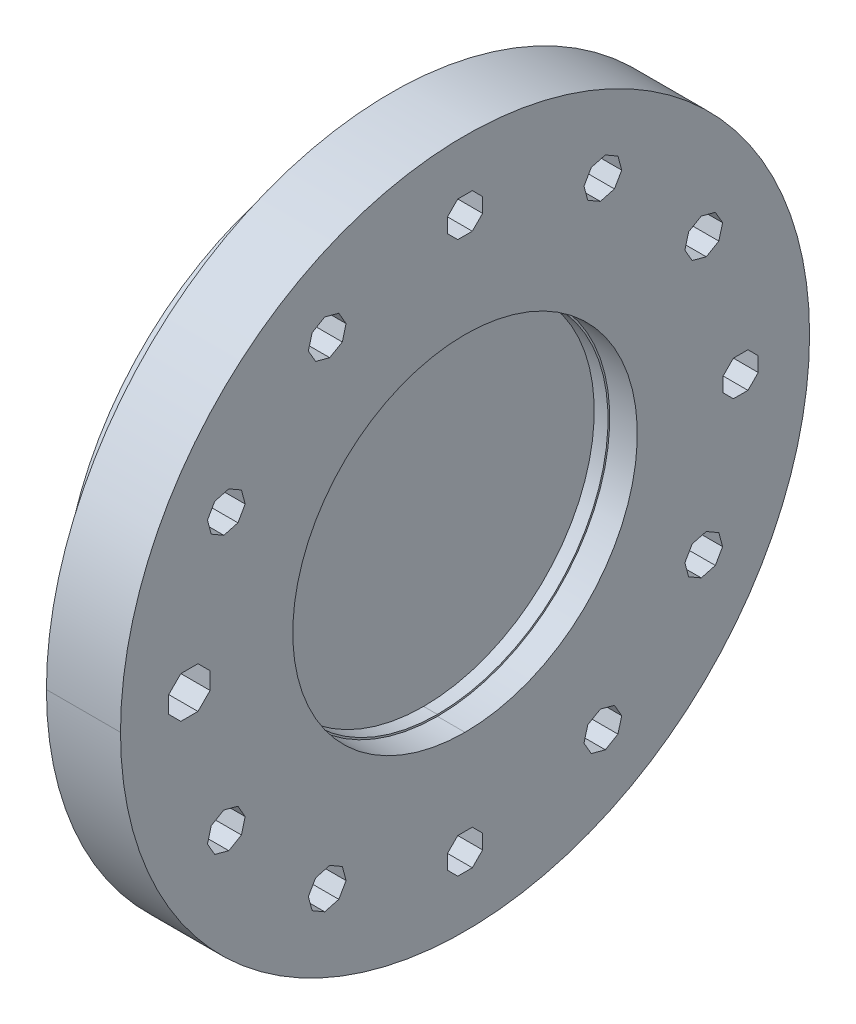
ISO-10303-21;
HEADER;
FILE_DESCRIPTION(('STEP AP214'),'2;1');
FILE_NAME('part.step','',(''),(''),'','','');
FILE_SCHEMA(('AUTOMOTIVE_DESIGN { 1 0 10303 214 1 1 1 1 }'));
ENDSEC;
DATA;
#1=APPLICATION_CONTEXT('core data for automotive mechanical design processes');
#2=APPLICATION_PROTOCOL_DEFINITION('international standard','automotive_design',2000,#1);
#3=PRODUCT_CONTEXT('',#1,'mechanical');
#4=PRODUCT('Part','Part','',(#3));
#5=PRODUCT_RELATED_PRODUCT_CATEGORY('part','',(#4));
#6=PRODUCT_DEFINITION_FORMATION('','',#4);
#7=PRODUCT_DEFINITION_CONTEXT('part definition',#1,'design');
#8=PRODUCT_DEFINITION('design','',#6,#7);
#9=PRODUCT_DEFINITION_SHAPE('','',#8);
#10=(LENGTH_UNIT() NAMED_UNIT(*) SI_UNIT(.MILLI.,.METRE.));
#11=(NAMED_UNIT(*) PLANE_ANGLE_UNIT() SI_UNIT($,.RADIAN.));
#12=(NAMED_UNIT(*) SI_UNIT($,.STERADIAN.) SOLID_ANGLE_UNIT());
#13=UNCERTAINTY_MEASURE_WITH_UNIT(LENGTH_MEASURE(1.E-05),#10,'distance_accuracy_value','');
#14=(GEOMETRIC_REPRESENTATION_CONTEXT(3) GLOBAL_UNCERTAINTY_ASSIGNED_CONTEXT((#13)) GLOBAL_UNIT_ASSIGNED_CONTEXT((#10,
#11,#12)) REPRESENTATION_CONTEXT('',''));
#15=CARTESIAN_POINT('',(0.,0.,0.));
#16=DIRECTION('',(0.,0.,1.));
#17=DIRECTION('',(1.,0.,0.));
#18=AXIS2_PLACEMENT_3D('',#15,#16,#17);
#19=CARTESIAN_POINT('',(2075.00000000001,3.12250225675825E-12,2334.99999999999));
#20=DIRECTION('',(-1.,0.,0.));
#21=DIRECTION('',(0.,0.,1.));
#22=AXIS2_PLACEMENT_3D('',#19,#20,#21);
#23=PLANE('',#22);
#24=CARTESIAN_POINT('',(2075.00000000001,3.12250225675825E-12,2254.99999999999));
#25=DIRECTION('',(-1.,0.,0.));
#26=DIRECTION('',(0.,0.,1.));
#27=AXIS2_PLACEMENT_3D('',#24,#25,#26);
#28=CIRCLE('',#27,80.0000000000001);
#29=CARTESIAN_POINT('',(2075.00000000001,3.12250225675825E-12,2334.99999999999));
#30=VERTEX_POINT('',#29);
#31=CARTESIAN_POINT('',(2075.00000000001,3.13229910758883E-12,2174.99999999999));
#32=VERTEX_POINT('',#31);
#33=EDGE_CURVE('E10',#30,#32,#28,.T.);
#34=ORIENTED_EDGE('',*,*,#33,.T.);
#35=CARTESIAN_POINT('',(2075.00000000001,3.12250225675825E-12,2254.99999999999));
#36=DIRECTION('',(-1.,0.,0.));
#37=DIRECTION('',(0.,0.,1.));
#38=AXIS2_PLACEMENT_3D('',#35,#36,#37);
#39=CIRCLE('',#38,80.0000000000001);
#40=EDGE_CURVE('E26',#32,#30,#39,.T.);
#41=ORIENTED_EDGE('',*,*,#40,.T.);
#42=EDGE_LOOP('',(#34,#41));
#43=FACE_BOUND('',#42,.T.);
#44=ADVANCED_FACE('F16',(#43),#23,.T.);
#45=CARTESIAN_POINT('',(2100.00000000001,3.12399950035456E-12,2254.99999999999));
#46=DIRECTION('',(1.,0.,0.));
#47=DIRECTION('',(0.,1.,0.));
#48=AXIS2_PLACEMENT_3D('',#45,#46,#47);
#49=PLANE('',#48);
#50=CARTESIAN_POINT('',(2100.00000000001,3.12399950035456E-12,2254.99999999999));
#51=DIRECTION('',(1.,0.,0.));
#52=DIRECTION('',(0.,1.,0.));
#53=AXIS2_PLACEMENT_3D('',#50,#51,#52);
#54=CIRCLE('',#53,49.5);
#55=CARTESIAN_POINT('',(2100.00000000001,49.5000000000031,2254.99999999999));
#56=VERTEX_POINT('',#55);
#57=CARTESIAN_POINT('',(2100.00000000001,-49.4999999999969,2254.99999999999));
#58=VERTEX_POINT('',#57);
#59=EDGE_CURVE('E975',#56,#58,#54,.T.);
#60=ORIENTED_EDGE('',*,*,#59,.T.);
#61=CARTESIAN_POINT('',(2100.00000000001,3.12399950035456E-12,2254.99999999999));
#62=DIRECTION('',(1.,0.,0.));
#63=DIRECTION('',(0.,1.,0.));
#64=AXIS2_PLACEMENT_3D('',#61,#62,#63);
#65=CIRCLE('',#64,49.5);
#66=EDGE_CURVE('E978',#58,#56,#65,.T.);
#67=ORIENTED_EDGE('',*,*,#66,.T.);
#68=EDGE_LOOP('',(#60,#67));
#69=FACE_BOUND('',#68,.T.);
#70=ADVANCED_FACE('F1605',(#69),#49,.T.);
#71=CARTESIAN_POINT('',(2085.14101615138,3.12740068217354E-12,2254.99999999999));
#72=DIRECTION('',(-1.,0.,0.));
#73=DIRECTION('',(0.,-1.,0.));
#74=AXIS2_PLACEMENT_3D('',#71,#72,#73);
#75=CYLINDRICAL_SURFACE('',#74,80.0000000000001);
#76=DIRECTION('',(-1.,0.,0.));
#77=VECTOR('',#76,1.);
#78=CARTESIAN_POINT('',(2081.00000000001,3.13229910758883E-12,2174.99999999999));
#79=LINE('',#78,#77);
#80=CARTESIAN_POINT('',(2085.14101615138,3.13229910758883E-12,2174.99999999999));
#81=VERTEX_POINT('',#80);
#82=EDGE_CURVE('E35',#81,#32,#79,.T.);
#83=ORIENTED_EDGE('',*,*,#82,.F.);
#84=CARTESIAN_POINT('',(2085.14101615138,3.12250225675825E-12,2254.99999999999));
#85=DIRECTION('',(-1.,0.,0.));
#86=DIRECTION('',(0.,0.,1.));
#87=AXIS2_PLACEMENT_3D('',#84,#85,#86);
#88=CIRCLE('',#87,80.0000000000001);
#89=CARTESIAN_POINT('',(2085.14101615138,3.12250225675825E-12,2334.99999999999));
#90=VERTEX_POINT('',#89);
#91=EDGE_CURVE('E1103',#81,#90,#88,.T.);
#92=ORIENTED_EDGE('',*,*,#91,.T.);
#93=DIRECTION('',(-1.,0.,0.));
#94=VECTOR('',#93,1.);
#95=CARTESIAN_POINT('',(2081.00000000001,3.12250225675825E-12,2334.99999999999));
#96=LINE('',#95,#94);
#97=EDGE_CURVE('E981',#90,#30,#96,.T.);
#98=ORIENTED_EDGE('',*,*,#97,.T.);
#99=ORIENTED_EDGE('',*,*,#40,.F.);
#100=EDGE_LOOP('',(#83,#92,#98,#99));
#101=FACE_BOUND('',#100,.T.);
#102=ADVANCED_FACE('F1611',(#101),#75,.T.);
#103=CARTESIAN_POINT('',(2085.14101615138,3.12740068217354E-12,2254.99999999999));
#104=DIRECTION('',(-1.,0.,0.));
#105=DIRECTION('',(0.,-1.,0.));
#106=AXIS2_PLACEMENT_3D('',#103,#104,#105);
#107=CYLINDRICAL_SURFACE('',#106,80.0000000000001);
#108=CARTESIAN_POINT('',(2085.14101615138,3.12250225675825E-12,2254.99999999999));
#109=DIRECTION('',(-1.,0.,0.));
#110=DIRECTION('',(0.,0.,1.));
#111=AXIS2_PLACEMENT_3D('',#108,#109,#110);
#112=CIRCLE('',#111,80.0000000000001);
#113=EDGE_CURVE('E979',#90,#81,#112,.T.);
#114=ORIENTED_EDGE('',*,*,#113,.T.);
#115=ORIENTED_EDGE('',*,*,#82,.T.);
#116=ORIENTED_EDGE('',*,*,#33,.F.);
#117=ORIENTED_EDGE('',*,*,#97,.F.);
#118=EDGE_LOOP('',(#114,#115,#116,#117));
#119=FACE_BOUND('',#118,.T.);
#120=ADVANCED_FACE('F2017',(#119),#107,.T.);
#121=CARTESIAN_POINT('',(2100.00000000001,3.12250225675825E-12,2254.99999999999));
#122=DIRECTION('',(1.,0.,0.));
#123=DIRECTION('',(0.,0.,-1.));
#124=AXIS2_PLACEMENT_3D('',#121,#122,#123);
#125=CYLINDRICAL_SURFACE('',#124,49.5);
#126=ORIENTED_EDGE('',*,*,#66,.F.);
#127=DIRECTION('',(1.,0.,0.));
#128=VECTOR('',#127,1.);
#129=CARTESIAN_POINT('',(2100.00000000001,-49.4999999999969,2254.99999999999));
#130=LINE('',#129,#128);
#131=CARTESIAN_POINT('',(2104.00000000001,-49.4999999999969,2254.99999999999));
#132=VERTEX_POINT('',#131);
#133=EDGE_CURVE('E1139',#58,#132,#130,.T.);
#134=ORIENTED_EDGE('',*,*,#133,.T.);
#135=CARTESIAN_POINT('',(2104.00000000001,3.12350041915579E-12,2254.99999999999));
#136=DIRECTION('',(1.,0.,0.));
#137=DIRECTION('',(0.,1.,0.));
#138=AXIS2_PLACEMENT_3D('',#135,#136,#137);
#139=CIRCLE('',#138,49.5);
#140=CARTESIAN_POINT('',(2104.00000000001,49.5000000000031,2254.99999999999));
#141=VERTEX_POINT('',#140);
#142=EDGE_CURVE('E1142',#132,#141,#139,.T.);
#143=ORIENTED_EDGE('',*,*,#142,.T.);
#144=DIRECTION('',(1.,0.,0.));
#145=VECTOR('',#144,1.);
#146=CARTESIAN_POINT('',(2100.00000000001,49.5000000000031,2254.99999999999));
#147=LINE('',#146,#145);
#148=EDGE_CURVE('E742',#56,#141,#147,.T.);
#149=ORIENTED_EDGE('',*,*,#148,.F.);
#150=EDGE_LOOP('',(#126,#134,#143,#149));
#151=FACE_BOUND('',#150,.T.);
#152=ADVANCED_FACE('F2019',(#151),#125,.F.);
#153=CARTESIAN_POINT('',(2100.00000000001,3.12250225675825E-12,2254.99999999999));
#154=DIRECTION('',(1.,0.,0.));
#155=DIRECTION('',(0.,0.,-1.));
#156=AXIS2_PLACEMENT_3D('',#153,#154,#155);
#157=CYLINDRICAL_SURFACE('',#156,49.5);
#158=ORIENTED_EDGE('',*,*,#133,.F.);
#159=ORIENTED_EDGE('',*,*,#59,.F.);
#160=ORIENTED_EDGE('',*,*,#148,.T.);
#161=CARTESIAN_POINT('',(2104.00000000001,3.12350041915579E-12,2254.99999999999));
#162=DIRECTION('',(1.,0.,0.));
#163=DIRECTION('',(0.,1.,0.));
#164=AXIS2_PLACEMENT_3D('',#161,#162,#163);
#165=CIRCLE('',#164,49.5);
#166=EDGE_CURVE('E739',#141,#132,#165,.T.);
#167=ORIENTED_EDGE('',*,*,#166,.T.);
#168=EDGE_LOOP('',(#158,#159,#160,#167));
#169=FACE_BOUND('',#168,.T.);
#170=ADVANCED_FACE('F2024',(#169),#157,.F.);
#171=CARTESIAN_POINT('',(2090.50000000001,3.11637922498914E-12,2254.99999999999));
#172=DIRECTION('',(1.,0.,0.));
#173=DIRECTION('',(0.,0.,-1.));
#174=AXIS2_PLACEMENT_3D('',#171,#172,#173);
#175=CONICAL_SURFACE('',#174,100.,1.30899693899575);
#176=CARTESIAN_POINT('',(2090.50000000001,3.12250225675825E-12,2254.99999999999));
#177=DIRECTION('',(-1.,0.,0.));
#178=DIRECTION('',(0.,0.,1.));
#179=AXIS2_PLACEMENT_3D('',#176,#177,#178);
#180=CIRCLE('',#179,100.);
#181=CARTESIAN_POINT('',(2090.50000000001,3.13474832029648E-12,2154.99999999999));
#182=VERTEX_POINT('',#181);
#183=CARTESIAN_POINT('',(2090.50000000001,3.12250225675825E-12,2354.99999999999));
#184=VERTEX_POINT('',#183);
#185=EDGE_CURVE('E743',#182,#184,#180,.T.);
#186=ORIENTED_EDGE('',*,*,#185,.T.);
#187=DIRECTION('',(-0.258819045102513,0.,-0.965925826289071));
#188=VECTOR('',#187,1.);
#189=CARTESIAN_POINT('',(2090.50000000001,3.13474832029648E-12,2354.99999999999));
#190=LINE('',#189,#188);
#191=EDGE_CURVE('E833',#184,#90,#190,.T.);
#192=ORIENTED_EDGE('',*,*,#191,.T.);
#193=ORIENTED_EDGE('',*,*,#91,.F.);
#194=DIRECTION('',(-0.258819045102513,0.,0.965925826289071));
#195=VECTOR('',#194,1.);
#196=CARTESIAN_POINT('',(2090.50000000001,3.12250225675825E-12,2154.99999999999));
#197=LINE('',#196,#195);
#198=EDGE_CURVE('E919',#182,#81,#197,.T.);
#199=ORIENTED_EDGE('',*,*,#198,.F.);
#200=EDGE_LOOP('',(#186,#192,#193,#199));
#201=FACE_BOUND('',#200,.T.);
#202=ADVANCED_FACE('F2010',(#201),#175,.T.);
#203=CARTESIAN_POINT('',(2090.50000000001,3.12862528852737E-12,2254.99999999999));
#204=DIRECTION('',(1.,0.,0.));
#205=DIRECTION('',(0.,0.,-1.));
#206=AXIS2_PLACEMENT_3D('',#203,#204,#205);
#207=CONICAL_SURFACE('',#206,100.000000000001,1.30899693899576);
#208=ORIENTED_EDGE('',*,*,#191,.F.);
#209=CARTESIAN_POINT('',(2090.50000000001,3.12250225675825E-12,2254.99999999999));
#210=DIRECTION('',(-1.,0.,0.));
#211=DIRECTION('',(0.,0.,1.));
#212=AXIS2_PLACEMENT_3D('',#209,#210,#211);
#213=CIRCLE('',#212,100.);
#214=EDGE_CURVE('E916',#184,#182,#213,.T.);
#215=ORIENTED_EDGE('',*,*,#214,.T.);
#216=ORIENTED_EDGE('',*,*,#198,.T.);
#217=ORIENTED_EDGE('',*,*,#113,.F.);
#218=EDGE_LOOP('',(#208,#215,#216,#217));
#219=FACE_BOUND('',#218,.T.);
#220=ADVANCED_FACE('F1619',(#219),#207,.T.);
#221=CARTESIAN_POINT('',(2104.00000000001,3.10147713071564E-12,2254.99999999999));
#222=DIRECTION('',(1.,0.,0.));
#223=DIRECTION('',(0.,1.,0.));
#224=AXIS2_PLACEMENT_3D('',#221,#222,#223);
#225=PLANE('',#224);
#226=ORIENTED_EDGE('',*,*,#166,.F.);
#227=ORIENTED_EDGE('',*,*,#142,.F.);
#228=EDGE_LOOP('',(#226,#227));
#229=FACE_BOUND('',#228,.T.);
#230=CARTESIAN_POINT('',(2104.00000000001,3.1439239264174E-12,2254.99999999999));
#231=DIRECTION('',(-1.,0.,0.));
#232=DIRECTION('',(0.,-1.,0.));
#233=AXIS2_PLACEMENT_3D('',#230,#231,#232);
#234=CIRCLE('',#233,50.);
#235=CARTESIAN_POINT('',(2104.00000000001,-49.9999999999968,2254.99999999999));
#236=VERTEX_POINT('',#235);
#237=CARTESIAN_POINT('',(2104.00000000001,50.0000000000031,2254.99999999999));
#238=VERTEX_POINT('',#237);
#239=EDGE_CURVE('E1283',#236,#238,#234,.T.);
#240=ORIENTED_EDGE('',*,*,#239,.F.);
#241=CARTESIAN_POINT('',(2104.00000000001,3.1439239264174E-12,2254.99999999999));
#242=DIRECTION('',(-1.,0.,0.));
#243=DIRECTION('',(0.,-1.,0.));
#244=AXIS2_PLACEMENT_3D('',#241,#242,#243);
#245=CIRCLE('',#244,50.);
#246=EDGE_CURVE('E908',#238,#236,#245,.T.);
#247=ORIENTED_EDGE('',*,*,#246,.F.);
#248=EDGE_LOOP('',(#240,#247));
#249=FACE_BOUND('',#248,.T.);
#250=ADVANCED_FACE('F1615',(#229,#249),#225,.T.);
#251=CARTESIAN_POINT('',(2090.00000000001,80.0000000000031,2254.99999999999));
#252=DIRECTION('',(1.,0.,0.));
#253=DIRECTION('',(0.,0.,-1.));
#254=AXIS2_PLACEMENT_3D('',#251,#252,#253);
#255=PLANE('',#254);
#256=DIRECTION('',(0.,-0.707106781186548,-0.707106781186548));
#257=VECTOR('',#256,1.);
#258=CARTESIAN_POINT('',(2090.00000000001,77.8875108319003,2260.09999999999));
#259=LINE('',#258,#257);
#260=CARTESIAN_POINT('',(2090.00000000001,77.8875108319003,2260.09999999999));
#261=VERTEX_POINT('',#260);
#262=CARTESIAN_POINT('',(2090.00000000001,74.9000000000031,2257.1124891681));
#263=VERTEX_POINT('',#262);
#264=EDGE_CURVE('E1249',#261,#263,#259,.T.);
#265=ORIENTED_EDGE('',*,*,#264,.T.);
#266=DIRECTION('',(0.,0.,-1.));
#267=VECTOR('',#266,1.);
#268=CARTESIAN_POINT('',(2090.00000000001,74.9000000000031,2257.1124891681));
#269=LINE('',#268,#267);
#270=CARTESIAN_POINT('',(2090.00000000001,74.9000000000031,2252.88751083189));
#271=VERTEX_POINT('',#270);
#272=EDGE_CURVE('E1145',#263,#271,#269,.T.);
#273=ORIENTED_EDGE('',*,*,#272,.T.);
#274=DIRECTION('',(0.,0.707106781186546,-0.707106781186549));
#275=VECTOR('',#274,1.);
#276=CARTESIAN_POINT('',(2090.00000000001,74.9000000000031,2252.88751083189));
#277=LINE('',#276,#275);
#278=CARTESIAN_POINT('',(2090.00000000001,77.8875108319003,2249.89999999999));
#279=VERTEX_POINT('',#278);
#280=EDGE_CURVE('E1111',#271,#279,#277,.T.);
#281=ORIENTED_EDGE('',*,*,#280,.T.);
#282=DIRECTION('',(0.,1.,0.));
#283=VECTOR('',#282,1.);
#284=CARTESIAN_POINT('',(2090.00000000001,77.8875108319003,2249.89999999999));
#285=LINE('',#284,#283);
#286=CARTESIAN_POINT('',(2090.00000000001,82.1124891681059,2249.89999999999));
#287=VERTEX_POINT('',#286);
#288=EDGE_CURVE('E1108',#279,#287,#285,.T.);
#289=ORIENTED_EDGE('',*,*,#288,.T.);
#290=DIRECTION('',(0.,0.707106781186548,0.707106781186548));
#291=VECTOR('',#290,1.);
#292=CARTESIAN_POINT('',(2090.00000000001,82.1124891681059,2249.89999999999));
#293=LINE('',#292,#291);
#294=CARTESIAN_POINT('',(2090.00000000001,85.1000000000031,2252.88751083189));
#295=VERTEX_POINT('',#294);
#296=EDGE_CURVE('E922',#287,#295,#293,.T.);
#297=ORIENTED_EDGE('',*,*,#296,.T.);
#298=DIRECTION('',(0.,0.,1.));
#299=VECTOR('',#298,1.);
#300=CARTESIAN_POINT('',(2090.00000000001,85.1000000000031,2252.88751083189));
#301=LINE('',#300,#299);
#302=CARTESIAN_POINT('',(2090.00000000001,85.1000000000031,2257.1124891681));
#303=VERTEX_POINT('',#302);
#304=EDGE_CURVE('E757',#295,#303,#301,.T.);
#305=ORIENTED_EDGE('',*,*,#304,.T.);
#306=DIRECTION('',(0.,-0.707106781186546,0.707106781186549));
#307=VECTOR('',#306,1.);
#308=CARTESIAN_POINT('',(2090.00000000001,85.1000000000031,2257.1124891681));
#309=LINE('',#308,#307);
#310=CARTESIAN_POINT('',(2090.00000000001,82.1124891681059,2260.09999999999));
#311=VERTEX_POINT('',#310);
#312=EDGE_CURVE('E754',#303,#311,#309,.T.);
#313=ORIENTED_EDGE('',*,*,#312,.T.);
#314=DIRECTION('',(0.,-1.,0.));
#315=VECTOR('',#314,1.);
#316=CARTESIAN_POINT('',(2090.00000000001,82.1124891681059,2260.09999999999));
#317=LINE('',#316,#315);
#318=EDGE_CURVE('E758',#311,#261,#317,.T.);
#319=ORIENTED_EDGE('',*,*,#318,.T.);
#320=EDGE_LOOP('',(#265,#273,#281,#289,#297,#305,#313,#319));
#321=FACE_BOUND('',#320,.T.);
#322=ADVANCED_FACE('F1618',(#321),#255,.T.);
#323=CARTESIAN_POINT('',(2090.00000000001,3.96045826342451E-12,2174.99999999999));
#324=DIRECTION('',(1.,0.,0.));
#325=DIRECTION('',(0.,0.,-1.));
#326=AXIS2_PLACEMENT_3D('',#323,#324,#325);
#327=PLANE('',#326);
#328=DIRECTION('',(0.,-0.707106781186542,-0.707106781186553));
#329=VECTOR('',#328,1.);
#330=CARTESIAN_POINT('',(2090.00000000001,-2.11248916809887,2180.09999999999));
#331=LINE('',#330,#329);
#332=CARTESIAN_POINT('',(2090.00000000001,-2.11248916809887,2180.09999999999));
#333=VERTEX_POINT('',#332);
#334=CARTESIAN_POINT('',(2090.00000000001,-5.09999999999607,2177.1124891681));
#335=VERTEX_POINT('',#334);
#336=EDGE_CURVE('E665',#333,#335,#331,.T.);
#337=ORIENTED_EDGE('',*,*,#336,.T.);
#338=DIRECTION('',(0.,0.,-1.));
#339=VECTOR('',#338,1.);
#340=CARTESIAN_POINT('',(2090.00000000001,-5.09999999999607,2177.1124891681));
#341=LINE('',#340,#339);
#342=CARTESIAN_POINT('',(2090.00000000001,-5.09999999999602,2172.88751083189));
#343=VERTEX_POINT('',#342);
#344=EDGE_CURVE('E1010',#335,#343,#341,.T.);
#345=ORIENTED_EDGE('',*,*,#344,.T.);
#346=DIRECTION('',(0.,0.707106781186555,-0.70710678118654));
#347=VECTOR('',#346,1.);
#348=CARTESIAN_POINT('',(2090.00000000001,-5.09999999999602,2172.88751083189));
#349=LINE('',#348,#347);
#350=CARTESIAN_POINT('',(2090.00000000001,-2.11248916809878,2169.89999999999));
#351=VERTEX_POINT('',#350);
#352=EDGE_CURVE('E1007',#343,#351,#349,.T.);
#353=ORIENTED_EDGE('',*,*,#352,.T.);
#354=DIRECTION('',(0.,1.,0.));
#355=VECTOR('',#354,1.);
#356=CARTESIAN_POINT('',(2090.00000000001,-2.11248916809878,2169.89999999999));
#357=LINE('',#356,#355);
#358=CARTESIAN_POINT('',(2090.00000000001,2.11248916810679,2169.89999999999));
#359=VERTEX_POINT('',#358);
#360=EDGE_CURVE('E1011',#351,#359,#357,.T.);
#361=ORIENTED_EDGE('',*,*,#360,.T.);
#362=DIRECTION('',(0.,0.707106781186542,0.707106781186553));
#363=VECTOR('',#362,1.);
#364=CARTESIAN_POINT('',(2090.00000000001,2.11248916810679,2169.89999999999));
#365=LINE('',#364,#363);
#366=CARTESIAN_POINT('',(2090.00000000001,5.10000000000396,2172.88751083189));
#367=VERTEX_POINT('',#366);
#368=EDGE_CURVE('E1123',#359,#367,#365,.T.);
#369=ORIENTED_EDGE('',*,*,#368,.T.);
#370=DIRECTION('',(0.,0.,1.));
#371=VECTOR('',#370,1.);
#372=CARTESIAN_POINT('',(2090.00000000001,5.10000000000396,2172.88751083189));
#373=LINE('',#372,#371);
#374=CARTESIAN_POINT('',(2090.00000000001,5.10000000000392,2177.1124891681));
#375=VERTEX_POINT('',#374);
#376=EDGE_CURVE('E1120',#367,#375,#373,.T.);
#377=ORIENTED_EDGE('',*,*,#376,.T.);
#378=DIRECTION('',(0.,-0.707106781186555,0.70710678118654));
#379=VECTOR('',#378,1.);
#380=CARTESIAN_POINT('',(2090.00000000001,5.10000000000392,2177.1124891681));
#381=LINE('',#380,#379);
#382=CARTESIAN_POINT('',(2090.00000000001,2.11248916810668,2180.09999999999));
#383=VERTEX_POINT('',#382);
#384=EDGE_CURVE('E1124',#375,#383,#381,.T.);
#385=ORIENTED_EDGE('',*,*,#384,.T.);
#386=DIRECTION('',(0.,-1.,0.));
#387=VECTOR('',#386,1.);
#388=CARTESIAN_POINT('',(2090.00000000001,2.11248916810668,2180.09999999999));
#389=LINE('',#388,#387);
#390=EDGE_CURVE('E1059',#383,#333,#389,.T.);
#391=ORIENTED_EDGE('',*,*,#390,.T.);
#392=EDGE_LOOP('',(#337,#345,#353,#361,#369,#377,#385,#391));
#393=FACE_BOUND('',#392,.T.);
#394=ADVANCED_FACE('F1623',(#393),#327,.T.);
#395=CARTESIAN_POINT('',(2090.00000000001,-39.9999999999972,2324.28203230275));
#396=DIRECTION('',(1.,0.,0.));
#397=DIRECTION('',(0.,1.,0.));
#398=AXIS2_PLACEMENT_3D('',#395,#396,#397);
#399=PLANE('',#398);
#400=DIRECTION('',(0.,-0.258819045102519,-0.965925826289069));
#401=VECTOR('',#400,1.);
#402=CARTESIAN_POINT('',(2090.00000000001,-44.3794692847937,2327.642517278));
#403=LINE('',#402,#401);
#404=CARTESIAN_POINT('',(2090.00000000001,-44.3794692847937,2327.642517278));
#405=VERTEX_POINT('',#404);
#406=CARTESIAN_POINT('',(2090.00000000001,-45.4729741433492,2323.56150158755));
#407=VERTEX_POINT('',#406);
#408=EDGE_CURVE('E1057',#405,#407,#403,.T.);
#409=ORIENTED_EDGE('',*,*,#408,.T.);
#410=DIRECTION('',(0.,0.500000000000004,-0.866025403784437));
#411=VECTOR('',#410,1.);
#412=CARTESIAN_POINT('',(2090.00000000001,-45.4729741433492,2323.56150158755));
#413=LINE('',#412,#411);
#414=CARTESIAN_POINT('',(2090.00000000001,-43.3604849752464,2319.90256301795));
#415=VERTEX_POINT('',#414);
#416=EDGE_CURVE('E1060',#407,#415,#413,.T.);
#417=ORIENTED_EDGE('',*,*,#416,.T.);
#418=DIRECTION('',(0.,0.96592582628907,-0.258819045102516));
#419=VECTOR('',#418,1.);
#420=CARTESIAN_POINT('',(2090.00000000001,-43.3604849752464,2319.90256301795));
#421=LINE('',#420,#419);
#422=CARTESIAN_POINT('',(2090.00000000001,-39.2794692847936,2318.8090581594));
#423=VERTEX_POINT('',#422);
#424=EDGE_CURVE('E1211',#415,#423,#421,.T.);
#425=ORIENTED_EDGE('',*,*,#424,.T.);
#426=DIRECTION('',(0.,0.866025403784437,0.500000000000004));
#427=VECTOR('',#426,1.);
#428=CARTESIAN_POINT('',(2090.00000000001,-39.2794692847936,2318.8090581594));
#429=LINE('',#428,#427);
#430=CARTESIAN_POINT('',(2090.00000000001,-35.6205307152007,2320.9215473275));
#431=VERTEX_POINT('',#430);
#432=EDGE_CURVE('E1080',#423,#431,#429,.T.);
#433=ORIENTED_EDGE('',*,*,#432,.T.);
#434=DIRECTION('',(0.,0.258819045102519,0.965925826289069));
#435=VECTOR('',#434,1.);
#436=CARTESIAN_POINT('',(2090.00000000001,-35.6205307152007,2320.9215473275));
#437=LINE('',#436,#435);
#438=CARTESIAN_POINT('',(2090.00000000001,-34.5270258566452,2325.00256301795));
#439=VERTEX_POINT('',#438);
#440=EDGE_CURVE('E1385',#431,#439,#437,.T.);
#441=ORIENTED_EDGE('',*,*,#440,.T.);
#442=DIRECTION('',(0.,-0.500000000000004,0.866025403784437));
#443=VECTOR('',#442,1.);
#444=CARTESIAN_POINT('',(2090.00000000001,-34.5270258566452,2325.00256301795));
#445=LINE('',#444,#443);
#446=CARTESIAN_POINT('',(2090.00000000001,-36.639515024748,2328.66150158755));
#447=VERTEX_POINT('',#446);
#448=EDGE_CURVE('E1114',#439,#447,#445,.T.);
#449=ORIENTED_EDGE('',*,*,#448,.T.);
#450=DIRECTION('',(0.,-0.96592582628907,0.258819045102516));
#451=VECTOR('',#450,1.);
#452=CARTESIAN_POINT('',(2090.00000000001,-36.639515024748,2328.66150158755));
#453=LINE('',#452,#451);
#454=CARTESIAN_POINT('',(2090.00000000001,-40.7205307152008,2329.7550064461));
#455=VERTEX_POINT('',#454);
#456=EDGE_CURVE('E845',#447,#455,#453,.T.);
#457=ORIENTED_EDGE('',*,*,#456,.T.);
#458=DIRECTION('',(0.,-0.866025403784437,-0.500000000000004));
#459=VECTOR('',#458,1.);
#460=CARTESIAN_POINT('',(2090.00000000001,-40.7205307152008,2329.7550064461));
#461=LINE('',#460,#459);
#462=EDGE_CURVE('E842',#455,#405,#461,.T.);
#463=ORIENTED_EDGE('',*,*,#462,.T.);
#464=EDGE_LOOP('',(#409,#417,#425,#433,#441,#449,#457,#463));
#465=FACE_BOUND('',#464,.T.);
#466=ADVANCED_FACE('F1627',(#465),#399,.T.);
#467=CARTESIAN_POINT('',(2090.00000000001,40.000000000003,2324.28203230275));
#468=DIRECTION('',(1.,0.,0.));
#469=DIRECTION('',(0.,0.,-1.));
#470=AXIS2_PLACEMENT_3D('',#467,#468,#469);
#471=PLANE('',#470);
#472=DIRECTION('',(0.,-0.499999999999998,-0.86602540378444));
#473=VECTOR('',#472,1.);
#474=CARTESIAN_POINT('',(2090.00000000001,36.6395150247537,2328.66150158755));
#475=LINE('',#474,#473);
#476=CARTESIAN_POINT('',(2090.00000000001,36.6395150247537,2328.66150158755));
#477=VERTEX_POINT('',#476);
#478=CARTESIAN_POINT('',(2090.00000000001,34.5270258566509,2325.00256301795));
#479=VERTEX_POINT('',#478);
#480=EDGE_CURVE('E846',#477,#479,#475,.T.);
#481=ORIENTED_EDGE('',*,*,#480,.T.);
#482=DIRECTION('',(0.,0.258819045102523,-0.965925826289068));
#483=VECTOR('',#482,1.);
#484=CARTESIAN_POINT('',(2090.00000000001,34.5270258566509,2325.00256301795));
#485=LINE('',#484,#483);
#486=CARTESIAN_POINT('',(2090.00000000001,35.6205307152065,2320.9215473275));
#487=VERTEX_POINT('',#486);
#488=EDGE_CURVE('E1192',#479,#487,#485,.T.);
#489=ORIENTED_EDGE('',*,*,#488,.T.);
#490=DIRECTION('',(0.,0.86602540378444,-0.499999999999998));
#491=VECTOR('',#490,1.);
#492=CARTESIAN_POINT('',(2090.00000000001,35.6205307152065,2320.9215473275));
#493=LINE('',#492,#491);
#494=CARTESIAN_POINT('',(2090.00000000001,39.2794692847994,2318.8090581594));
#495=VERTEX_POINT('',#494);
#496=EDGE_CURVE('E780',#487,#495,#493,.T.);
#497=ORIENTED_EDGE('',*,*,#496,.T.);
#498=DIRECTION('',(0.,0.965925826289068,0.258819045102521));
#499=VECTOR('',#498,1.);
#500=CARTESIAN_POINT('',(2090.00000000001,39.2794692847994,2318.8090581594));
#501=LINE('',#500,#499);
#502=CARTESIAN_POINT('',(2090.00000000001,43.3604849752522,2319.90256301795));
#503=VERTEX_POINT('',#502);
#504=EDGE_CURVE('E777',#495,#503,#501,.T.);
#505=ORIENTED_EDGE('',*,*,#504,.T.);
#506=DIRECTION('',(0.,0.499999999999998,0.86602540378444));
#507=VECTOR('',#506,1.);
#508=CARTESIAN_POINT('',(2090.00000000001,43.3604849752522,2319.90256301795));
#509=LINE('',#508,#507);
#510=CARTESIAN_POINT('',(2090.00000000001,45.472974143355,2323.56150158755));
#511=VERTEX_POINT('',#510);
#512=EDGE_CURVE('E781',#503,#511,#509,.T.);
#513=ORIENTED_EDGE('',*,*,#512,.T.);
#514=DIRECTION('',(0.,-0.258819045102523,0.965925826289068));
#515=VECTOR('',#514,1.);
#516=CARTESIAN_POINT('',(2090.00000000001,45.472974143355,2323.56150158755));
#517=LINE('',#516,#515);
#518=CARTESIAN_POINT('',(2090.00000000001,44.3794692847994,2327.642517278));
#519=VERTEX_POINT('',#518);
#520=EDGE_CURVE('E837',#511,#519,#517,.T.);
#521=ORIENTED_EDGE('',*,*,#520,.T.);
#522=DIRECTION('',(0.,-0.86602540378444,0.499999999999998));
#523=VECTOR('',#522,1.);
#524=CARTESIAN_POINT('',(2090.00000000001,44.3794692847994,2327.642517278));
#525=LINE('',#524,#523);
#526=CARTESIAN_POINT('',(2090.00000000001,40.7205307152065,2329.7550064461));
#527=VERTEX_POINT('',#526);
#528=EDGE_CURVE('E834',#519,#527,#525,.T.);
#529=ORIENTED_EDGE('',*,*,#528,.T.);
#530=DIRECTION('',(0.,-0.965925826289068,-0.258819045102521));
#531=VECTOR('',#530,1.);
#532=CARTESIAN_POINT('',(2090.00000000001,40.7205307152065,2329.7550064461));
#533=LINE('',#532,#531);
#534=EDGE_CURVE('E838',#527,#477,#533,.T.);
#535=ORIENTED_EDGE('',*,*,#534,.T.);
#536=EDGE_LOOP('',(#481,#489,#497,#505,#513,#521,#529,#535));
#537=FACE_BOUND('',#536,.T.);
#538=ADVANCED_FACE('F1631',(#537),#471,.T.);
#539=CARTESIAN_POINT('',(2090.00000000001,-39.9999999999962,2185.71796769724));
#540=DIRECTION('',(1.,0.,0.));
#541=DIRECTION('',(0.,0.,-1.));
#542=AXIS2_PLACEMENT_3D('',#539,#540,#541);
#543=PLANE('',#542);
#544=DIRECTION('',(0.,-0.499999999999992,-0.866025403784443));
#545=VECTOR('',#544,1.);
#546=CARTESIAN_POINT('',(2090.00000000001,-43.3604849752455,2190.09743698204));
#547=LINE('',#546,#545);
#548=CARTESIAN_POINT('',(2090.00000000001,-43.3604849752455,2190.09743698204));
#549=VERTEX_POINT('',#548);
#550=CARTESIAN_POINT('',(2090.00000000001,-45.4729741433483,2186.43849841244));
#551=VERTEX_POINT('',#550);
#552=EDGE_CURVE('E860',#549,#551,#547,.T.);
#553=ORIENTED_EDGE('',*,*,#552,.T.);
#554=DIRECTION('',(0.,0.25881904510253,-0.965925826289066));
#555=VECTOR('',#554,1.);
#556=CARTESIAN_POINT('',(2090.00000000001,-45.4729741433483,2186.43849841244));
#557=LINE('',#556,#555);
#558=CARTESIAN_POINT('',(2090.00000000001,-44.3794692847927,2182.35748272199));
#559=VERTEX_POINT('',#558);
#560=EDGE_CURVE('E857',#551,#559,#557,.T.);
#561=ORIENTED_EDGE('',*,*,#560,.T.);
#562=DIRECTION('',(0.,0.866025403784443,-0.499999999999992));
#563=VECTOR('',#562,1.);
#564=CARTESIAN_POINT('',(2090.00000000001,-44.3794692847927,2182.35748272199));
#565=LINE('',#564,#563);
#566=CARTESIAN_POINT('',(2090.00000000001,-40.7205307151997,2180.24499355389));
#567=VERTEX_POINT('',#566);
#568=EDGE_CURVE('E861',#559,#567,#565,.T.);
#569=ORIENTED_EDGE('',*,*,#568,.T.);
#570=DIRECTION('',(0.,0.965925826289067,0.258819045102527));
#571=VECTOR('',#570,1.);
#572=CARTESIAN_POINT('',(2090.00000000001,-40.7205307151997,2180.24499355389));
#573=LINE('',#572,#571);
#574=CARTESIAN_POINT('',(2090.00000000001,-36.639515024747,2181.33849841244));
#575=VERTEX_POINT('',#574);
#576=EDGE_CURVE('E1254',#567,#575,#573,.T.);
#577=ORIENTED_EDGE('',*,*,#576,.T.);
#578=DIRECTION('',(0.,0.499999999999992,0.866025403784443));
#579=VECTOR('',#578,1.);
#580=CARTESIAN_POINT('',(2090.00000000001,-36.639515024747,2181.33849841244));
#581=LINE('',#580,#579);
#582=CARTESIAN_POINT('',(2090.00000000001,-34.5270258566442,2184.99743698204));
#583=VERTEX_POINT('',#582);
#584=EDGE_CURVE('E1287',#575,#583,#581,.T.);
#585=ORIENTED_EDGE('',*,*,#584,.T.);
#586=DIRECTION('',(0.,-0.25881904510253,0.965925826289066));
#587=VECTOR('',#586,1.);
#588=CARTESIAN_POINT('',(2090.00000000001,-34.5270258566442,2184.99743698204));
#589=LINE('',#588,#587);
#590=CARTESIAN_POINT('',(2090.00000000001,-35.6205307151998,2189.07845267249));
#591=VERTEX_POINT('',#590);
#592=EDGE_CURVE('E1290',#583,#591,#589,.T.);
#593=ORIENTED_EDGE('',*,*,#592,.T.);
#594=DIRECTION('',(0.,-0.866025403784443,0.499999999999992));
#595=VECTOR('',#594,1.);
#596=CARTESIAN_POINT('',(2090.00000000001,-35.6205307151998,2189.07845267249));
#597=LINE('',#596,#595);
#598=CARTESIAN_POINT('',(2090.00000000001,-39.2794692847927,2191.19094184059));
#599=VERTEX_POINT('',#598);
#600=EDGE_CURVE('E1335',#591,#599,#597,.T.);
#601=ORIENTED_EDGE('',*,*,#600,.T.);
#602=DIRECTION('',(0.,-0.965925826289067,-0.258819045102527));
#603=VECTOR('',#602,1.);
#604=CARTESIAN_POINT('',(2090.00000000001,-39.2794692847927,2191.19094184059));
#605=LINE('',#604,#603);
#606=EDGE_CURVE('E1313',#599,#549,#605,.T.);
#607=ORIENTED_EDGE('',*,*,#606,.T.);
#608=EDGE_LOOP('',(#553,#561,#569,#577,#585,#593,#601,#607));
#609=FACE_BOUND('',#608,.T.);
#610=ADVANCED_FACE('F1635',(#609),#543,.T.);
#611=CARTESIAN_POINT('',(2090.00000000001,69.2820323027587,2215.));
#612=DIRECTION('',(1.,0.,0.));
#613=DIRECTION('',(0.,0.,-1.));
#614=AXIS2_PLACEMENT_3D('',#611,#612,#613);
#615=PLANE('',#614);
#616=DIRECTION('',(0.,-0.499999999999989,-0.866025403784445));
#617=VECTOR('',#616,1.);
#618=CARTESIAN_POINT('',(2090.00000000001,65.9215473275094,2219.37946928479));
#619=LINE('',#618,#617);
#620=CARTESIAN_POINT('',(2090.00000000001,65.9215473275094,2219.37946928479));
#621=VERTEX_POINT('',#620);
#622=CARTESIAN_POINT('',(2090.00000000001,63.8090581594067,2215.7205307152));
#623=VERTEX_POINT('',#622);
#624=EDGE_CURVE('E1310',#621,#623,#619,.T.);
#625=ORIENTED_EDGE('',*,*,#624,.T.);
#626=DIRECTION('',(0.,0.258819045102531,-0.965925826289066));
#627=VECTOR('',#626,1.);
#628=CARTESIAN_POINT('',(2090.00000000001,63.8090581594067,2215.7205307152));
#629=LINE('',#628,#627);
#630=CARTESIAN_POINT('',(2090.00000000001,64.9025630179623,2211.63951502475));
#631=VERTEX_POINT('',#630);
#632=EDGE_CURVE('E1314',#623,#631,#629,.T.);
#633=ORIENTED_EDGE('',*,*,#632,.T.);
#634=DIRECTION('',(0.,0.866025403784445,-0.499999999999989));
#635=VECTOR('',#634,1.);
#636=CARTESIAN_POINT('',(2090.00000000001,64.9025630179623,2211.63951502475));
#637=LINE('',#636,#635);
#638=CARTESIAN_POINT('',(2090.00000000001,68.5615015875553,2209.52702585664));
#639=VERTEX_POINT('',#638);
#640=EDGE_CURVE('E1389',#631,#639,#637,.T.);
#641=ORIENTED_EDGE('',*,*,#640,.T.);
#642=DIRECTION('',(0.,0.965925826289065,0.258819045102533));
#643=VECTOR('',#642,1.);
#644=CARTESIAN_POINT('',(2090.00000000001,68.5615015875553,2209.52702585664));
#645=LINE('',#644,#643);
#646=CARTESIAN_POINT('',(2090.00000000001,72.642517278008,2210.6205307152));
#647=VERTEX_POINT('',#646);
#648=EDGE_CURVE('E1386',#639,#647,#645,.T.);
#649=ORIENTED_EDGE('',*,*,#648,.T.);
#650=DIRECTION('',(0.,0.499999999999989,0.866025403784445));
#651=VECTOR('',#650,1.);
#652=CARTESIAN_POINT('',(2090.00000000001,72.642517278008,2210.6205307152));
#653=LINE('',#652,#651);
#654=CARTESIAN_POINT('',(2090.00000000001,74.7550064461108,2214.27946928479));
#655=VERTEX_POINT('',#654);
#656=EDGE_CURVE('E766',#647,#655,#653,.T.);
#657=ORIENTED_EDGE('',*,*,#656,.T.);
#658=DIRECTION('',(0.,-0.258819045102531,0.965925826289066));
#659=VECTOR('',#658,1.);
#660=CARTESIAN_POINT('',(2090.00000000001,74.7550064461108,2214.27946928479));
#661=LINE('',#660,#659);
#662=CARTESIAN_POINT('',(2090.00000000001,73.6615015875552,2218.36048497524));
#663=VERTEX_POINT('',#662);
#664=EDGE_CURVE('E763',#655,#663,#661,.T.);
#665=ORIENTED_EDGE('',*,*,#664,.T.);
#666=DIRECTION('',(0.,-0.866025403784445,0.499999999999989));
#667=VECTOR('',#666,1.);
#668=CARTESIAN_POINT('',(2090.00000000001,73.6615015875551,2218.36048497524));
#669=LINE('',#668,#667);
#670=CARTESIAN_POINT('',(2090.00000000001,70.0025630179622,2220.47297414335));
#671=VERTEX_POINT('',#670);
#672=EDGE_CURVE('E767',#663,#671,#669,.T.);
#673=ORIENTED_EDGE('',*,*,#672,.T.);
#674=DIRECTION('',(0.,-0.965925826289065,-0.258819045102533));
#675=VECTOR('',#674,1.);
#676=CARTESIAN_POINT('',(2090.00000000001,70.0025630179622,2220.47297414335));
#677=LINE('',#676,#675);
#678=EDGE_CURVE('E935',#671,#621,#677,.T.);
#679=ORIENTED_EDGE('',*,*,#678,.T.);
#680=EDGE_LOOP('',(#625,#633,#641,#649,#657,#665,#673,#679));
#681=FACE_BOUND('',#680,.T.);
#682=ADVANCED_FACE('F1639',(#681),#615,.T.);
#683=CARTESIAN_POINT('',(2090.00000000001,69.2820323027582,2294.99999999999));
#684=DIRECTION('',(1.,0.,0.));
#685=DIRECTION('',(0.,0.,-1.));
#686=AXIS2_PLACEMENT_3D('',#683,#684,#685);
#687=PLANE('',#686);
#688=DIRECTION('',(0.,-0.25881904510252,-0.965925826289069));
#689=VECTOR('',#688,1.);
#690=CARTESIAN_POINT('',(2090.00000000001,64.9025630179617,2298.36048497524));
#691=LINE('',#690,#689);
#692=CARTESIAN_POINT('',(2090.00000000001,64.9025630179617,2298.36048497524));
#693=VERTEX_POINT('',#692);
#694=CARTESIAN_POINT('',(2090.00000000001,63.8090581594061,2294.27946928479));
#695=VERTEX_POINT('',#694);
#696=EDGE_CURVE('E1257',#693,#695,#691,.T.);
#697=ORIENTED_EDGE('',*,*,#696,.T.);
#698=DIRECTION('',(0.,0.500000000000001,-0.866025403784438));
#699=VECTOR('',#698,1.);
#700=CARTESIAN_POINT('',(2090.00000000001,63.8090581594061,2294.27946928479));
#701=LINE('',#700,#699);
#702=CARTESIAN_POINT('',(2090.00000000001,65.9215473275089,2290.6205307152));
#703=VERTEX_POINT('',#702);
#704=EDGE_CURVE('E747',#695,#703,#701,.T.);
#705=ORIENTED_EDGE('',*,*,#704,.T.);
#706=DIRECTION('',(0.,0.965925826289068,-0.258819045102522));
#707=VECTOR('',#706,1.);
#708=CARTESIAN_POINT('',(2090.00000000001,65.9215473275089,2290.6205307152));
#709=LINE('',#708,#707);
#710=CARTESIAN_POINT('',(2090.00000000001,70.0025630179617,2289.52702585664));
#711=VERTEX_POINT('',#710);
#712=EDGE_CURVE('E744',#703,#711,#709,.T.);
#713=ORIENTED_EDGE('',*,*,#712,.T.);
#714=DIRECTION('',(0.,0.866025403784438,0.500000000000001));
#715=VECTOR('',#714,1.);
#716=CARTESIAN_POINT('',(2090.00000000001,70.0025630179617,2289.52702585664));
#717=LINE('',#716,#715);
#718=CARTESIAN_POINT('',(2090.00000000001,73.6615015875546,2291.63951502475));
#719=VERTEX_POINT('',#718);
#720=EDGE_CURVE('E748',#711,#719,#717,.T.);
#721=ORIENTED_EDGE('',*,*,#720,.T.);
#722=DIRECTION('',(0.,0.25881904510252,0.965925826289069));
#723=VECTOR('',#722,1.);
#724=CARTESIAN_POINT('',(2090.00000000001,73.6615015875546,2291.63951502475));
#725=LINE('',#724,#723);
#726=CARTESIAN_POINT('',(2090.00000000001,74.7550064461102,2295.7205307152));
#727=VERTEX_POINT('',#726);
#728=EDGE_CURVE('E936',#719,#727,#725,.T.);
#729=ORIENTED_EDGE('',*,*,#728,.T.);
#730=DIRECTION('',(0.,-0.500000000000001,0.866025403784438));
#731=VECTOR('',#730,1.);
#732=CARTESIAN_POINT('',(2090.00000000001,74.7550064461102,2295.7205307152));
#733=LINE('',#732,#731);
#734=CARTESIAN_POINT('',(2090.00000000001,72.6425172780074,2299.37946928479));
#735=VERTEX_POINT('',#734);
#736=EDGE_CURVE('E939',#727,#735,#733,.T.);
#737=ORIENTED_EDGE('',*,*,#736,.T.);
#738=DIRECTION('',(0.,-0.965925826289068,0.258819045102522));
#739=VECTOR('',#738,1.);
#740=CARTESIAN_POINT('',(2090.00000000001,72.6425172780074,2299.37946928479));
#741=LINE('',#740,#739);
#742=CARTESIAN_POINT('',(2090.00000000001,68.5615015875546,2300.47297414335));
#743=VERTEX_POINT('',#742);
#744=EDGE_CURVE('E1037',#735,#743,#741,.T.);
#745=ORIENTED_EDGE('',*,*,#744,.T.);
#746=DIRECTION('',(0.,-0.866025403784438,-0.500000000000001));
#747=VECTOR('',#746,1.);
#748=CARTESIAN_POINT('',(2090.00000000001,68.5615015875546,2300.47297414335));
#749=LINE('',#748,#747);
#750=EDGE_CURVE('E1061',#743,#693,#749,.T.);
#751=ORIENTED_EDGE('',*,*,#750,.T.);
#752=EDGE_LOOP('',(#697,#705,#713,#721,#729,#737,#745,#751));
#753=FACE_BOUND('',#752,.T.);
#754=ADVANCED_FACE('F1643',(#753),#687,.T.);
#755=CARTESIAN_POINT('',(2090.00000000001,-69.2820323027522,2294.99999999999));
#756=DIRECTION('',(1.,0.,0.));
#757=DIRECTION('',(0.,1.,0.));
#758=AXIS2_PLACEMENT_3D('',#755,#756,#757);
#759=PLANE('',#758);
#760=DIRECTION('',(0.,-0.499999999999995,-0.866025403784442));
#761=VECTOR('',#760,1.);
#762=CARTESIAN_POINT('',(2090.00000000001,-72.6425172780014,2299.37946928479));
#763=LINE('',#762,#761);
#764=CARTESIAN_POINT('',(2090.00000000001,-72.6425172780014,2299.37946928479));
#765=VERTEX_POINT('',#764);
#766=CARTESIAN_POINT('',(2090.00000000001,-74.7550064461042,2295.7205307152));
#767=VERTEX_POINT('',#766);
#768=EDGE_CURVE('E1063',#765,#767,#763,.T.);
#769=ORIENTED_EDGE('',*,*,#768,.T.);
#770=DIRECTION('',(0.,0.258819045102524,-0.965925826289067));
#771=VECTOR('',#770,1.);
#772=CARTESIAN_POINT('',(2090.00000000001,-74.7550064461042,2295.7205307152));
#773=LINE('',#772,#771);
#774=CARTESIAN_POINT('',(2090.00000000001,-73.6615015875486,2291.63951502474));
#775=VERTEX_POINT('',#774);
#776=EDGE_CURVE('E1070',#767,#775,#773,.T.);
#777=ORIENTED_EDGE('',*,*,#776,.T.);
#778=DIRECTION('',(0.,0.866025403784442,-0.499999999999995));
#779=VECTOR('',#778,1.);
#780=CARTESIAN_POINT('',(2090.00000000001,-73.6615015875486,2291.63951502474));
#781=LINE('',#780,#779);
#782=CARTESIAN_POINT('',(2090.00000000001,-70.0025630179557,2289.52702585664));
#783=VERTEX_POINT('',#782);
#784=EDGE_CURVE('E926',#775,#783,#781,.T.);
#785=ORIENTED_EDGE('',*,*,#784,.T.);
#786=DIRECTION('',(0.,0.965925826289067,0.258819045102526));
#787=VECTOR('',#786,1.);
#788=CARTESIAN_POINT('',(2090.00000000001,-70.0025630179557,2289.52702585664));
#789=LINE('',#788,#787);
#790=CARTESIAN_POINT('',(2090.00000000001,-65.9215473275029,2290.6205307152));
#791=VERTEX_POINT('',#790);
#792=EDGE_CURVE('E923',#783,#791,#789,.T.);
#793=ORIENTED_EDGE('',*,*,#792,.T.);
#794=DIRECTION('',(0.,0.499999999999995,0.866025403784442));
#795=VECTOR('',#794,1.);
#796=CARTESIAN_POINT('',(2090.00000000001,-65.9215473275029,2290.6205307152));
#797=LINE('',#796,#795);
#798=CARTESIAN_POINT('',(2090.00000000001,-63.8090581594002,2294.27946928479));
#799=VERTEX_POINT('',#798);
#800=EDGE_CURVE('E927',#791,#799,#797,.T.);
#801=ORIENTED_EDGE('',*,*,#800,.T.);
#802=DIRECTION('',(0.,-0.258819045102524,0.965925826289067));
#803=VECTOR('',#802,1.);
#804=CARTESIAN_POINT('',(2090.00000000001,-63.8090581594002,2294.27946928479));
#805=LINE('',#804,#803);
#806=CARTESIAN_POINT('',(2090.00000000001,-64.9025630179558,2298.36048497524));
#807=VERTEX_POINT('',#806);
#808=EDGE_CURVE('E1293',#799,#807,#805,.T.);
#809=ORIENTED_EDGE('',*,*,#808,.T.);
#810=DIRECTION('',(0.,-0.866025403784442,0.499999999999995));
#811=VECTOR('',#810,1.);
#812=CARTESIAN_POINT('',(2090.00000000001,-64.9025630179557,2298.36048497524));
#813=LINE('',#812,#811);
#814=CARTESIAN_POINT('',(2090.00000000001,-68.5615015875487,2300.47297414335));
#815=VERTEX_POINT('',#814);
#816=EDGE_CURVE('E1306',#807,#815,#813,.T.);
#817=ORIENTED_EDGE('',*,*,#816,.T.);
#818=DIRECTION('',(0.,-0.965925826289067,-0.258819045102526));
#819=VECTOR('',#818,1.);
#820=CARTESIAN_POINT('',(2090.00000000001,-68.5615015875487,2300.47297414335));
#821=LINE('',#820,#819);
#822=EDGE_CURVE('E961',#815,#765,#821,.T.);
#823=ORIENTED_EDGE('',*,*,#822,.T.);
#824=EDGE_LOOP('',(#769,#777,#785,#793,#801,#809,#817,#823));
#825=FACE_BOUND('',#824,.T.);
#826=ADVANCED_FACE('F1647',(#825),#759,.T.);
#827=CARTESIAN_POINT('',(2090.00000000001,-79.9999999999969,2254.99999999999));
#828=DIRECTION('',(1.,0.,0.));
#829=DIRECTION('',(0.,0.,-1.));
#830=AXIS2_PLACEMENT_3D('',#827,#828,#829);
#831=PLANE('',#830);
#832=DIRECTION('',(0.,-0.707106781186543,-0.707106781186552));
#833=VECTOR('',#832,1.);
#834=CARTESIAN_POINT('',(2090.00000000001,-82.1124891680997,2260.09999999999));
#835=LINE('',#834,#833);
#836=CARTESIAN_POINT('',(2090.00000000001,-82.1124891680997,2260.09999999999));
#837=VERTEX_POINT('',#836);
#838=CARTESIAN_POINT('',(2090.00000000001,-85.0999999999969,2257.1124891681));
#839=VERTEX_POINT('',#838);
#840=EDGE_CURVE('E958',#837,#839,#835,.T.);
#841=ORIENTED_EDGE('',*,*,#840,.T.);
#842=DIRECTION('',(0.,0.,-1.));
#843=VECTOR('',#842,1.);
#844=CARTESIAN_POINT('',(2090.00000000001,-85.0999999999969,2257.1124891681));
#845=LINE('',#844,#843);
#846=CARTESIAN_POINT('',(2090.00000000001,-85.0999999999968,2252.88751083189));
#847=VERTEX_POINT('',#846);
#848=EDGE_CURVE('E962',#839,#847,#845,.T.);
#849=ORIENTED_EDGE('',*,*,#848,.T.);
#850=DIRECTION('',(0.,0.707106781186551,-0.707106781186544));
#851=VECTOR('',#850,1.);
#852=CARTESIAN_POINT('',(2090.00000000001,-85.0999999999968,2252.88751083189));
#853=LINE('',#852,#851);
#854=CARTESIAN_POINT('',(2090.00000000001,-82.1124891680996,2249.89999999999));
#855=VERTEX_POINT('',#854);
#856=EDGE_CURVE('E1156',#847,#855,#853,.T.);
#857=ORIENTED_EDGE('',*,*,#856,.T.);
#858=DIRECTION('',(0.,1.,0.));
#859=VECTOR('',#858,1.);
#860=CARTESIAN_POINT('',(2090.00000000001,-82.1124891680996,2249.89999999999));
#861=LINE('',#860,#859);
#862=CARTESIAN_POINT('',(2090.00000000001,-77.887510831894,2249.89999999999));
#863=VERTEX_POINT('',#862);
#864=EDGE_CURVE('E1153',#855,#863,#861,.T.);
#865=ORIENTED_EDGE('',*,*,#864,.T.);
#866=DIRECTION('',(0.,0.707106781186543,0.707106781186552));
#867=VECTOR('',#866,1.);
#868=CARTESIAN_POINT('',(2090.00000000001,-77.887510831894,2249.89999999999));
#869=LINE('',#868,#867);
#870=CARTESIAN_POINT('',(2090.00000000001,-74.8999999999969,2252.88751083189));
#871=VERTEX_POINT('',#870);
#872=EDGE_CURVE('E1157',#863,#871,#869,.T.);
#873=ORIENTED_EDGE('',*,*,#872,.T.);
#874=DIRECTION('',(0.,0.,1.));
#875=VECTOR('',#874,1.);
#876=CARTESIAN_POINT('',(2090.00000000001,-74.8999999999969,2252.88751083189));
#877=LINE('',#876,#875);
#878=CARTESIAN_POINT('',(2090.00000000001,-74.8999999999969,2257.1124891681));
#879=VERTEX_POINT('',#878);
#880=EDGE_CURVE('E1349',#871,#879,#877,.T.);
#881=ORIENTED_EDGE('',*,*,#880,.T.);
#882=DIRECTION('',(0.,-0.707106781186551,0.707106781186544));
#883=VECTOR('',#882,1.);
#884=CARTESIAN_POINT('',(2090.00000000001,-74.8999999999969,2257.1124891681));
#885=LINE('',#884,#883);
#886=CARTESIAN_POINT('',(2090.00000000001,-77.8875108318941,2260.09999999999));
#887=VERTEX_POINT('',#886);
#888=EDGE_CURVE('E1202',#879,#887,#885,.T.);
#889=ORIENTED_EDGE('',*,*,#888,.T.);
#890=DIRECTION('',(0.,-1.,0.));
#891=VECTOR('',#890,1.);
#892=CARTESIAN_POINT('',(2090.00000000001,-77.8875108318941,2260.09999999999));
#893=LINE('',#892,#891);
#894=EDGE_CURVE('E1199',#887,#837,#893,.T.);
#895=ORIENTED_EDGE('',*,*,#894,.T.);
#896=EDGE_LOOP('',(#841,#849,#857,#865,#873,#881,#889,#895));
#897=FACE_BOUND('',#896,.T.);
#898=ADVANCED_FACE('F1650',(#897),#831,.T.);
#899=CARTESIAN_POINT('',(2090.00000000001,-69.2820323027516,2214.99999999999));
#900=DIRECTION('',(1.,0.,0.));
#901=DIRECTION('',(0.,0.,-1.));
#902=AXIS2_PLACEMENT_3D('',#899,#900,#901);
#903=PLANE('',#902);
#904=DIRECTION('',(0.,-0.258819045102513,-0.96592582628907));
#905=VECTOR('',#904,1.);
#906=CARTESIAN_POINT('',(2090.00000000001,-73.6615015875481,2218.36048497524));
#907=LINE('',#906,#905);
#908=CARTESIAN_POINT('',(2090.00000000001,-73.6615015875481,2218.36048497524));
#909=VERTEX_POINT('',#908);
#910=CARTESIAN_POINT('',(2090.00000000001,-74.7550064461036,2214.27946928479));
#911=VERTEX_POINT('',#910);
#912=EDGE_CURVE('E1203',#909,#911,#907,.T.);
#913=ORIENTED_EDGE('',*,*,#912,.T.);
#914=DIRECTION('',(0.,0.500000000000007,-0.866025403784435));
#915=VECTOR('',#914,1.);
#916=CARTESIAN_POINT('',(2090.00000000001,-74.7550064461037,2214.27946928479));
#917=LINE('',#916,#915);
#918=CARTESIAN_POINT('',(2090.00000000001,-72.6425172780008,2210.6205307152));
#919=VERTEX_POINT('',#918);
#920=EDGE_CURVE('E752',#911,#919,#917,.T.);
#921=ORIENTED_EDGE('',*,*,#920,.T.);
#922=DIRECTION('',(0.,0.96592582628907,-0.258819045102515));
#923=VECTOR('',#922,1.);
#924=CARTESIAN_POINT('',(2090.00000000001,-72.6425172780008,2210.6205307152));
#925=LINE('',#924,#923);
#926=CARTESIAN_POINT('',(2090.00000000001,-68.5615015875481,2209.52702585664));
#927=VERTEX_POINT('',#926);
#928=EDGE_CURVE('E749',#919,#927,#925,.T.);
#929=ORIENTED_EDGE('',*,*,#928,.T.);
#930=DIRECTION('',(0.,0.866025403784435,0.500000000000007));
#931=VECTOR('',#930,1.);
#932=CARTESIAN_POINT('',(2090.00000000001,-68.5615015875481,2209.52702585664));
#933=LINE('',#932,#931);
#934=CARTESIAN_POINT('',(2090.00000000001,-64.9025630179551,2211.63951502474));
#935=VERTEX_POINT('',#934);
#936=EDGE_CURVE('E753',#927,#935,#933,.T.);
#937=ORIENTED_EDGE('',*,*,#936,.T.);
#938=DIRECTION('',(0.,0.258819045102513,0.96592582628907));
#939=VECTOR('',#938,1.);
#940=CARTESIAN_POINT('',(2090.00000000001,-64.9025630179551,2211.63951502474));
#941=LINE('',#940,#939);
#942=CARTESIAN_POINT('',(2090.00000000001,-63.8090581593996,2215.7205307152));
#943=VERTEX_POINT('',#942);
#944=EDGE_CURVE('E1031',#935,#943,#941,.T.);
#945=ORIENTED_EDGE('',*,*,#944,.T.);
#946=DIRECTION('',(0.,-0.500000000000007,0.866025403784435));
#947=VECTOR('',#946,1.);
#948=CARTESIAN_POINT('',(2090.00000000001,-63.8090581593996,2215.7205307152));
#949=LINE('',#948,#947);
#950=CARTESIAN_POINT('',(2090.00000000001,-65.9215473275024,2219.37946928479));
#951=VERTEX_POINT('',#950);
#952=EDGE_CURVE('E1034',#943,#951,#949,.T.);
#953=ORIENTED_EDGE('',*,*,#952,.T.);
#954=DIRECTION('',(0.,-0.96592582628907,0.258819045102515));
#955=VECTOR('',#954,1.);
#956=CARTESIAN_POINT('',(2090.00000000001,-65.9215473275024,2219.37946928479));
#957=LINE('',#956,#955);
#958=CARTESIAN_POINT('',(2090.00000000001,-70.0025630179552,2220.47297414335));
#959=VERTEX_POINT('',#958);
#960=EDGE_CURVE('E1054',#951,#959,#957,.T.);
#961=ORIENTED_EDGE('',*,*,#960,.T.);
#962=DIRECTION('',(0.,-0.866025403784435,-0.500000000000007));
#963=VECTOR('',#962,1.);
#964=CARTESIAN_POINT('',(2090.00000000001,-70.0025630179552,2220.47297414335));
#965=LINE('',#964,#963);
#966=EDGE_CURVE('E1150',#959,#909,#965,.T.);
#967=ORIENTED_EDGE('',*,*,#966,.T.);
#968=EDGE_LOOP('',(#913,#921,#929,#937,#945,#953,#961,#967));
#969=FACE_BOUND('',#968,.T.);
#970=ADVANCED_FACE('F1492',(#969),#903,.T.);
#971=CARTESIAN_POINT('',(2090.00000000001,40.0000000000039,2185.71796769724));
#972=DIRECTION('',(1.,0.,0.));
#973=DIRECTION('',(0.,0.,-1.));
#974=AXIS2_PLACEMENT_3D('',#971,#972,#973);
#975=PLANE('',#974);
#976=DIRECTION('',(0.,-0.258819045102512,-0.965925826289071));
#977=VECTOR('',#976,1.);
#978=CARTESIAN_POINT('',(2090.00000000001,35.6205307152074,2189.07845267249));
#979=LINE('',#978,#977);
#980=CARTESIAN_POINT('',(2090.00000000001,35.6205307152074,2189.07845267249));
#981=VERTEX_POINT('',#980);
#982=CARTESIAN_POINT('',(2090.00000000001,34.5270258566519,2184.99743698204));
#983=VERTEX_POINT('',#982);
#984=EDGE_CURVE('E1148',#981,#983,#979,.T.);
#985=ORIENTED_EDGE('',*,*,#984,.T.);
#986=DIRECTION('',(0.,0.50000000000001,-0.866025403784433));
#987=VECTOR('',#986,1.);
#988=CARTESIAN_POINT('',(2090.00000000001,34.5270258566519,2184.99743698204));
#989=LINE('',#988,#987);
#990=CARTESIAN_POINT('',(2090.00000000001,36.6395150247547,2181.33849841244));
#991=VERTEX_POINT('',#990);
#992=EDGE_CURVE('E989',#983,#991,#989,.T.);
#993=ORIENTED_EDGE('',*,*,#992,.T.);
#994=DIRECTION('',(0.,0.965925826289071,-0.258819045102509));
#995=VECTOR('',#994,1.);
#996=CARTESIAN_POINT('',(2090.00000000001,36.6395150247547,2181.33849841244));
#997=LINE('',#996,#995);
#998=CARTESIAN_POINT('',(2090.00000000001,40.7205307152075,2180.24499355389));
#999=VERTEX_POINT('',#998);
#1000=EDGE_CURVE('E880',#991,#999,#997,.T.);
#1001=ORIENTED_EDGE('',*,*,#1000,.T.);
#1002=DIRECTION('',(0.,0.866025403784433,0.50000000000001));
#1003=VECTOR('',#1002,1.);
#1004=CARTESIAN_POINT('',(2090.00000000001,40.7205307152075,2180.24499355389));
#1005=LINE('',#1004,#1003);
#1006=CARTESIAN_POINT('',(2090.00000000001,44.3794692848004,2182.35748272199));
#1007=VERTEX_POINT('',#1006);
#1008=EDGE_CURVE('E877',#999,#1007,#1005,.T.);
#1009=ORIENTED_EDGE('',*,*,#1008,.T.);
#1010=DIRECTION('',(0.,0.258819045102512,0.965925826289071));
#1011=VECTOR('',#1010,1.);
#1012=CARTESIAN_POINT('',(2090.00000000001,44.3794692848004,2182.35748272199));
#1013=LINE('',#1012,#1011);
#1014=CARTESIAN_POINT('',(2090.00000000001,45.4729741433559,2186.43849841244));
#1015=VERTEX_POINT('',#1014);
#1016=EDGE_CURVE('E881',#1007,#1015,#1013,.T.);
#1017=ORIENTED_EDGE('',*,*,#1016,.T.);
#1018=DIRECTION('',(0.,-0.50000000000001,0.866025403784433));
#1019=VECTOR('',#1018,1.);
#1020=CARTESIAN_POINT('',(2090.00000000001,45.4729741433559,2186.43849841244));
#1021=LINE('',#1020,#1019);
#1022=CARTESIAN_POINT('',(2090.00000000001,43.3604849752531,2190.09743698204));
#1023=VERTEX_POINT('',#1022);
#1024=EDGE_CURVE('E1049',#1015,#1023,#1021,.T.);
#1025=ORIENTED_EDGE('',*,*,#1024,.T.);
#1026=DIRECTION('',(0.,-0.965925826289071,0.258819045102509));
#1027=VECTOR('',#1026,1.);
#1028=CARTESIAN_POINT('',(2090.00000000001,43.3604849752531,2190.09743698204));
#1029=LINE('',#1028,#1027);
#1030=CARTESIAN_POINT('',(2090.00000000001,39.2794692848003,2191.19094184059));
#1031=VERTEX_POINT('',#1030);
#1032=EDGE_CURVE('E841',#1023,#1031,#1029,.T.);
#1033=ORIENTED_EDGE('',*,*,#1032,.T.);
#1034=DIRECTION('',(0.,-0.866025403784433,-0.50000000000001));
#1035=VECTOR('',#1034,1.);
#1036=CARTESIAN_POINT('',(2090.00000000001,39.2794692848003,2191.19094184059));
#1037=LINE('',#1036,#1035);
#1038=EDGE_CURVE('E714',#1031,#981,#1037,.T.);
#1039=ORIENTED_EDGE('',*,*,#1038,.T.);
#1040=EDGE_LOOP('',(#985,#993,#1001,#1009,#1017,#1025,#1033,#1039));
#1041=FACE_BOUND('',#1040,.T.);
#1042=ADVANCED_FACE('F1574',(#1041),#975,.T.);
#1043=CARTESIAN_POINT('',(2112.00000000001,3.12862528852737E-12,2254.99999999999));
#1044=DIRECTION('',(-1.,0.,0.));
#1045=DIRECTION('',(0.,0.,1.));
#1046=AXIS2_PLACEMENT_3D('',#1043,#1044,#1045);
#1047=CYLINDRICAL_SURFACE('',#1046,100.);
#1048=DIRECTION('',(-1.,0.,0.));
#1049=VECTOR('',#1048,1.);
#1050=CARTESIAN_POINT('',(2081.00000000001,3.13474832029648E-12,2154.99999999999));
#1051=LINE('',#1050,#1049);
#1052=CARTESIAN_POINT('',(2112.00000000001,3.13474832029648E-12,2154.99999999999));
#1053=VERTEX_POINT('',#1052);
#1054=EDGE_CURVE('E1137',#1053,#182,#1051,.T.);
#1055=ORIENTED_EDGE('',*,*,#1054,.F.);
#1056=CARTESIAN_POINT('',(2112.00000000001,3.12250225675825E-12,2254.99999999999));
#1057=DIRECTION('',(-1.,0.,0.));
#1058=DIRECTION('',(0.,0.,1.));
#1059=AXIS2_PLACEMENT_3D('',#1056,#1057,#1058);
#1060=CIRCLE('',#1059,100.);
#1061=CARTESIAN_POINT('',(2112.00000000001,3.12250225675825E-12,2354.99999999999));
#1062=VERTEX_POINT('',#1061);
#1063=EDGE_CURVE('E711',#1053,#1062,#1060,.T.);
#1064=ORIENTED_EDGE('',*,*,#1063,.T.);
#1065=DIRECTION('',(-1.,0.,0.));
#1066=VECTOR('',#1065,1.);
#1067=CARTESIAN_POINT('',(2081.00000000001,3.12250225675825E-12,2354.99999999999));
#1068=LINE('',#1067,#1066);
#1069=EDGE_CURVE('E715',#1062,#184,#1068,.T.);
#1070=ORIENTED_EDGE('',*,*,#1069,.T.);
#1071=ORIENTED_EDGE('',*,*,#185,.F.);
#1072=EDGE_LOOP('',(#1055,#1064,#1070,#1071));
#1073=FACE_BOUND('',#1072,.T.);
#1074=ADVANCED_FACE('F1658',(#1073),#1047,.T.);
#1075=CARTESIAN_POINT('',(2112.00000000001,3.14331893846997E-12,2254.99999999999));
#1076=DIRECTION('',(-1.,0.,0.));
#1077=DIRECTION('',(0.,0.,1.));
#1078=AXIS2_PLACEMENT_3D('',#1075,#1076,#1077);
#1079=CYLINDRICAL_SURFACE('',#1078,50.);
#1080=DIRECTION('',(-1.,0.,0.));
#1081=VECTOR('',#1080,1.);
#1082=CARTESIAN_POINT('',(2275.68885313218,50.0000000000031,2254.99999999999));
#1083=LINE('',#1082,#1081);
#1084=CARTESIAN_POINT('',(2112.00000000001,50.0000000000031,2254.99999999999));
#1085=VERTEX_POINT('',#1084);
#1086=EDGE_CURVE('E1294',#1085,#238,#1083,.T.);
#1087=ORIENTED_EDGE('',*,*,#1086,.F.);
#1088=CARTESIAN_POINT('',(2112.00000000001,3.14292576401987E-12,2254.99999999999));
#1089=DIRECTION('',(-1.,0.,0.));
#1090=DIRECTION('',(0.,-1.,0.));
#1091=AXIS2_PLACEMENT_3D('',#1088,#1089,#1090);
#1092=CIRCLE('',#1091,50.);
#1093=CARTESIAN_POINT('',(2112.00000000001,-49.9999999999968,2254.99999999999));
#1094=VERTEX_POINT('',#1093);
#1095=EDGE_CURVE('E830',#1094,#1085,#1092,.T.);
#1096=ORIENTED_EDGE('',*,*,#1095,.F.);
#1097=DIRECTION('',(-1.,0.,0.));
#1098=VECTOR('',#1097,1.);
#1099=CARTESIAN_POINT('',(2275.68885313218,-49.9999999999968,2254.99999999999));
#1100=LINE('',#1099,#1098);
#1101=EDGE_CURVE('E1246',#1094,#236,#1100,.T.);
#1102=ORIENTED_EDGE('',*,*,#1101,.T.);
#1103=ORIENTED_EDGE('',*,*,#239,.T.);
#1104=EDGE_LOOP('',(#1087,#1096,#1102,#1103));
#1105=FACE_BOUND('',#1104,.T.);
#1106=ADVANCED_FACE('F1663',(#1105),#1079,.F.);
#1107=CARTESIAN_POINT('',(2075.5750216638,74.9000000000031,2252.88751083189));
#1108=DIRECTION('',(0.,0.707106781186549,0.707106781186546));
#1109=DIRECTION('',(0.,-0.707106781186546,0.707106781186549));
#1110=AXIS2_PLACEMENT_3D('',#1107,#1108,#1109);
#1111=PLANE('',#1110);
#1112=DIRECTION('',(0.,0.707106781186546,-0.707106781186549));
#1113=VECTOR('',#1112,1.);
#1114=CARTESIAN_POINT('',(2112.00000000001,74.9000000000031,2252.88751083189));
#1115=LINE('',#1114,#1113);
#1116=CARTESIAN_POINT('',(2112.00000000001,74.9000000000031,2252.88751083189));
#1117=VERTEX_POINT('',#1116);
#1118=CARTESIAN_POINT('',(2112.00000000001,77.8875108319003,2249.89999999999));
#1119=VERTEX_POINT('',#1118);
#1120=EDGE_CURVE('E985',#1117,#1119,#1115,.T.);
#1121=ORIENTED_EDGE('',*,*,#1120,.T.);
#1122=DIRECTION('',(1.,0.,0.));
#1123=VECTOR('',#1122,1.);
#1124=CARTESIAN_POINT('',(2075.5750216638,77.8875108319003,2249.89999999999));
#1125=LINE('',#1124,#1123);
#1126=EDGE_CURVE('E913',#279,#1119,#1125,.T.);
#1127=ORIENTED_EDGE('',*,*,#1126,.F.);
#1128=ORIENTED_EDGE('',*,*,#280,.F.);
#1129=DIRECTION('',(1.,0.,0.));
#1130=VECTOR('',#1129,1.);
#1131=CARTESIAN_POINT('',(2075.5750216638,74.9000000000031,2252.88751083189));
#1132=LINE('',#1131,#1130);
#1133=EDGE_CURVE('E982',#271,#1117,#1132,.T.);
#1134=ORIENTED_EDGE('',*,*,#1133,.T.);
#1135=EDGE_LOOP('',(#1121,#1127,#1128,#1134));
#1136=FACE_BOUND('',#1135,.T.);
#1137=ADVANCED_FACE('F1659',(#1136),#1111,.T.);
#1138=CARTESIAN_POINT('',(2074.52009147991,35.6205307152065,2320.9215473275));
#1139=DIRECTION('',(0.,0.499999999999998,0.86602540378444));
#1140=DIRECTION('',(0.,-0.86602540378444,0.499999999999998));
#1141=AXIS2_PLACEMENT_3D('',#1138,#1139,#1140);
#1142=PLANE('',#1141);
#1143=DIRECTION('',(0.,0.86602540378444,-0.499999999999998));
#1144=VECTOR('',#1143,1.);
#1145=CARTESIAN_POINT('',(2112.00000000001,35.6205307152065,2320.9215473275));
#1146=LINE('',#1145,#1144);
#1147=CARTESIAN_POINT('',(2112.00000000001,35.6205307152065,2320.9215473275));
#1148=VERTEX_POINT('',#1147);
#1149=CARTESIAN_POINT('',(2112.00000000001,39.2794692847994,2318.8090581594));
#1150=VERTEX_POINT('',#1149);
#1151=EDGE_CURVE('E986',#1148,#1150,#1146,.T.);
#1152=ORIENTED_EDGE('',*,*,#1151,.T.);
#1153=DIRECTION('',(1.,0.,0.));
#1154=VECTOR('',#1153,1.);
#1155=CARTESIAN_POINT('',(2074.52009147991,39.2794692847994,2318.8090581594));
#1156=LINE('',#1155,#1154);
#1157=EDGE_CURVE('E1160',#495,#1150,#1156,.T.);
#1158=ORIENTED_EDGE('',*,*,#1157,.F.);
#1159=ORIENTED_EDGE('',*,*,#496,.F.);
#1160=DIRECTION('',(1.,0.,0.));
#1161=VECTOR('',#1160,1.);
#1162=CARTESIAN_POINT('',(2074.52009147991,35.6205307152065,2320.9215473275));
#1163=LINE('',#1162,#1161);
#1164=EDGE_CURVE('E704',#487,#1148,#1163,.T.);
#1165=ORIENTED_EDGE('',*,*,#1164,.T.);
#1166=EDGE_LOOP('',(#1152,#1158,#1159,#1165));
#1167=FACE_BOUND('',#1166,.T.);
#1168=ADVANCED_FACE('F1662',(#1167),#1142,.T.);
#1169=CARTESIAN_POINT('',(2074.52009147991,-34.5270258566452,2325.00256301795));
#1170=DIRECTION('',(0.,-0.866025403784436,-0.500000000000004));
#1171=DIRECTION('',(0.,0.500000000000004,-0.866025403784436));
#1172=AXIS2_PLACEMENT_3D('',#1169,#1170,#1171);
#1173=PLANE('',#1172);
#1174=DIRECTION('',(0.,-0.500000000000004,0.866025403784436));
#1175=VECTOR('',#1174,1.);
#1176=CARTESIAN_POINT('',(2112.00000000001,-34.5270258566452,2325.00256301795));
#1177=LINE('',#1176,#1175);
#1178=CARTESIAN_POINT('',(2112.00000000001,-34.5270258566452,2325.00256301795));
#1179=VERTEX_POINT('',#1178);
#1180=CARTESIAN_POINT('',(2112.00000000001,-36.639515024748,2328.66150158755));
#1181=VERTEX_POINT('',#1180);
#1182=EDGE_CURVE('E701',#1179,#1181,#1177,.T.);
#1183=ORIENTED_EDGE('',*,*,#1182,.T.);
#1184=DIRECTION('',(1.,0.,0.));
#1185=VECTOR('',#1184,1.);
#1186=CARTESIAN_POINT('',(2074.52009147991,-36.639515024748,2328.66150158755));
#1187=LINE('',#1186,#1185);
#1188=EDGE_CURVE('E759',#447,#1181,#1187,.T.);
#1189=ORIENTED_EDGE('',*,*,#1188,.F.);
#1190=ORIENTED_EDGE('',*,*,#448,.F.);
#1191=DIRECTION('',(1.,0.,0.));
#1192=VECTOR('',#1191,1.);
#1193=CARTESIAN_POINT('',(2074.52009147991,-34.5270258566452,2325.00256301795));
#1194=LINE('',#1193,#1192);
#1195=EDGE_CURVE('E705',#439,#1179,#1194,.T.);
#1196=ORIENTED_EDGE('',*,*,#1195,.T.);
#1197=EDGE_LOOP('',(#1183,#1189,#1190,#1196));
#1198=FACE_BOUND('',#1197,.T.);
#1199=ADVANCED_FACE('F1667',(#1198),#1173,.T.);
#1200=CARTESIAN_POINT('',(2074.52009147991,-73.6615015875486,2291.63951502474));
#1201=DIRECTION('',(0.,0.499999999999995,0.866025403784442));
#1202=DIRECTION('',(0.,-0.866025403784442,0.499999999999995));
#1203=AXIS2_PLACEMENT_3D('',#1200,#1201,#1202);
#1204=PLANE('',#1203);
#1205=DIRECTION('',(0.,0.866025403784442,-0.499999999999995));
#1206=VECTOR('',#1205,1.);
#1207=CARTESIAN_POINT('',(2112.00000000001,-73.6615015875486,2291.63951502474));
#1208=LINE('',#1207,#1206);
#1209=CARTESIAN_POINT('',(2112.00000000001,-73.6615015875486,2291.63951502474));
#1210=VERTEX_POINT('',#1209);
#1211=CARTESIAN_POINT('',(2112.00000000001,-70.0025630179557,2289.52702585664));
#1212=VERTEX_POINT('',#1211);
#1213=EDGE_CURVE('E931',#1210,#1212,#1208,.T.);
#1214=ORIENTED_EDGE('',*,*,#1213,.T.);
#1215=DIRECTION('',(1.,0.,0.));
#1216=VECTOR('',#1215,1.);
#1217=CARTESIAN_POINT('',(2074.52009147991,-70.0025630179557,2289.52702585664));
#1218=LINE('',#1217,#1216);
#1219=EDGE_CURVE('E1042',#783,#1212,#1218,.T.);
#1220=ORIENTED_EDGE('',*,*,#1219,.F.);
#1221=ORIENTED_EDGE('',*,*,#784,.F.);
#1222=DIRECTION('',(1.,0.,0.));
#1223=VECTOR('',#1222,1.);
#1224=CARTESIAN_POINT('',(2074.52009147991,-73.6615015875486,2291.63951502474));
#1225=LINE('',#1224,#1223);
#1226=EDGE_CURVE('E928',#775,#1210,#1225,.T.);
#1227=ORIENTED_EDGE('',*,*,#1226,.T.);
#1228=EDGE_LOOP('',(#1214,#1220,#1221,#1227));
#1229=FACE_BOUND('',#1228,.T.);
#1230=ADVANCED_FACE('F1671',(#1229),#1204,.T.);
#1231=CARTESIAN_POINT('',(2075.5750216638,-77.887510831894,2249.89999999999));
#1232=DIRECTION('',(0.,-0.707106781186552,0.707106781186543));
#1233=DIRECTION('',(0.,-0.707106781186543,-0.707106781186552));
#1234=AXIS2_PLACEMENT_3D('',#1231,#1232,#1233);
#1235=PLANE('',#1234);
#1236=DIRECTION('',(0.,0.707106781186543,0.707106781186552));
#1237=VECTOR('',#1236,1.);
#1238=CARTESIAN_POINT('',(2112.00000000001,-77.887510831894,2249.89999999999));
#1239=LINE('',#1238,#1237);
#1240=CARTESIAN_POINT('',(2112.00000000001,-77.887510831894,2249.89999999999));
#1241=VERTEX_POINT('',#1240);
#1242=CARTESIAN_POINT('',(2112.00000000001,-74.8999999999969,2252.88751083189));
#1243=VERTEX_POINT('',#1242);
#1244=EDGE_CURVE('E932',#1241,#1243,#1239,.T.);
#1245=ORIENTED_EDGE('',*,*,#1244,.T.);
#1246=DIRECTION('',(1.,0.,0.));
#1247=VECTOR('',#1246,1.);
#1248=CARTESIAN_POINT('',(2075.5750216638,-74.8999999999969,2252.88751083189));
#1249=LINE('',#1248,#1247);
#1250=EDGE_CURVE('E818',#871,#1243,#1249,.T.);
#1251=ORIENTED_EDGE('',*,*,#1250,.F.);
#1252=ORIENTED_EDGE('',*,*,#872,.F.);
#1253=DIRECTION('',(1.,0.,0.));
#1254=VECTOR('',#1253,1.);
#1255=CARTESIAN_POINT('',(2075.5750216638,-77.887510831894,2249.89999999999));
#1256=LINE('',#1255,#1254);
#1257=EDGE_CURVE('E997',#863,#1241,#1256,.T.);
#1258=ORIENTED_EDGE('',*,*,#1257,.T.);
#1259=EDGE_LOOP('',(#1245,#1251,#1252,#1258));
#1260=FACE_BOUND('',#1259,.T.);
#1261=ADVANCED_FACE('F1675',(#1260),#1235,.T.);
#1262=CARTESIAN_POINT('',(2074.52009147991,-70.0025630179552,2220.47297414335));
#1263=DIRECTION('',(0.,0.500000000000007,-0.866025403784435));
#1264=DIRECTION('',(0.,0.866025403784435,0.500000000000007));
#1265=AXIS2_PLACEMENT_3D('',#1262,#1263,#1264);
#1266=PLANE('',#1265);
#1267=DIRECTION('',(0.,-0.866025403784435,-0.500000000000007));
#1268=VECTOR('',#1267,1.);
#1269=CARTESIAN_POINT('',(2112.00000000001,-70.0025630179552,2220.47297414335));
#1270=LINE('',#1269,#1268);
#1271=CARTESIAN_POINT('',(2112.00000000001,-70.0025630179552,2220.47297414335));
#1272=VERTEX_POINT('',#1271);
#1273=CARTESIAN_POINT('',(2112.00000000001,-73.6615015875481,2218.36048497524));
#1274=VERTEX_POINT('',#1273);
#1275=EDGE_CURVE('E1000',#1272,#1274,#1270,.T.);
#1276=ORIENTED_EDGE('',*,*,#1275,.T.);
#1277=DIRECTION('',(1.,0.,0.));
#1278=VECTOR('',#1277,1.);
#1279=CARTESIAN_POINT('',(2074.52009147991,-73.6615015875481,2218.36048497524));
#1280=LINE('',#1279,#1278);
#1281=EDGE_CURVE('E257',#909,#1274,#1280,.T.);
#1282=ORIENTED_EDGE('',*,*,#1281,.F.);
#1283=ORIENTED_EDGE('',*,*,#966,.F.);
#1284=DIRECTION('',(1.,0.,0.));
#1285=VECTOR('',#1284,1.);
#1286=CARTESIAN_POINT('',(2074.52009147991,-70.0025630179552,2220.47297414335));
#1287=LINE('',#1286,#1285);
#1288=EDGE_CURVE('E266',#959,#1272,#1287,.T.);
#1289=ORIENTED_EDGE('',*,*,#1288,.T.);
#1290=EDGE_LOOP('',(#1276,#1282,#1283,#1289));
#1291=FACE_BOUND('',#1290,.T.);
#1292=ADVANCED_FACE('F1679',(#1291),#1266,.T.);
#1293=CARTESIAN_POINT('',(2074.52009147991,-64.9025630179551,2211.63951502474));
#1294=DIRECTION('',(0.,-0.96592582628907,0.258819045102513));
#1295=DIRECTION('',(0.,-0.258819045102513,-0.96592582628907));
#1296=AXIS2_PLACEMENT_3D('',#1293,#1294,#1295);
#1297=PLANE('',#1296);
#1298=DIRECTION('',(0.,0.258819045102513,0.96592582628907));
#1299=VECTOR('',#1298,1.);
#1300=CARTESIAN_POINT('',(2112.00000000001,-64.9025630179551,2211.63951502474));
#1301=LINE('',#1300,#1299);
#1302=CARTESIAN_POINT('',(2112.00000000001,-64.9025630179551,2211.63951502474));
#1303=VERTEX_POINT('',#1302);
#1304=CARTESIAN_POINT('',(2112.00000000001,-63.8090581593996,2215.7205307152));
#1305=VERTEX_POINT('',#1304);
#1306=EDGE_CURVE('E800',#1303,#1305,#1301,.T.);
#1307=ORIENTED_EDGE('',*,*,#1306,.T.);
#1308=DIRECTION('',(1.,0.,0.));
#1309=VECTOR('',#1308,1.);
#1310=CARTESIAN_POINT('',(2074.52009147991,-63.8090581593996,2215.7205307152));
#1311=LINE('',#1310,#1309);
#1312=EDGE_CURVE('E813',#943,#1305,#1311,.T.);
#1313=ORIENTED_EDGE('',*,*,#1312,.F.);
#1314=ORIENTED_EDGE('',*,*,#944,.F.);
#1315=DIRECTION('',(1.,0.,0.));
#1316=VECTOR('',#1315,1.);
#1317=CARTESIAN_POINT('',(2074.52009147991,-64.9025630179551,2211.63951502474));
#1318=LINE('',#1317,#1316);
#1319=EDGE_CURVE('E797',#935,#1303,#1318,.T.);
#1320=ORIENTED_EDGE('',*,*,#1319,.T.);
#1321=EDGE_LOOP('',(#1307,#1313,#1314,#1320));
#1322=FACE_BOUND('',#1321,.T.);
#1323=ADVANCED_FACE('F1487',(#1322),#1297,.T.);
#1324=CARTESIAN_POINT('',(2074.52009147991,-36.639515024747,2181.33849841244));
#1325=DIRECTION('',(0.,-0.866025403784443,0.499999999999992));
#1326=DIRECTION('',(0.,-0.499999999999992,-0.866025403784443));
#1327=AXIS2_PLACEMENT_3D('',#1324,#1325,#1326);
#1328=PLANE('',#1327);
#1329=DIRECTION('',(0.,0.499999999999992,0.866025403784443));
#1330=VECTOR('',#1329,1.);
#1331=CARTESIAN_POINT('',(2112.00000000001,-36.639515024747,2181.33849841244));
#1332=LINE('',#1331,#1330);
#1333=CARTESIAN_POINT('',(2112.00000000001,-36.639515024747,2181.33849841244));
#1334=VERTEX_POINT('',#1333);
#1335=CARTESIAN_POINT('',(2112.00000000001,-34.5270258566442,2184.99743698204));
#1336=VERTEX_POINT('',#1335);
#1337=EDGE_CURVE('E801',#1334,#1336,#1332,.T.);
#1338=ORIENTED_EDGE('',*,*,#1337,.T.);
#1339=DIRECTION('',(1.,0.,0.));
#1340=VECTOR('',#1339,1.);
#1341=CARTESIAN_POINT('',(2074.52009147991,-34.5270258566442,2184.99743698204));
#1342=LINE('',#1341,#1340);
#1343=EDGE_CURVE('E686',#583,#1336,#1342,.T.);
#1344=ORIENTED_EDGE('',*,*,#1343,.F.);
#1345=ORIENTED_EDGE('',*,*,#584,.F.);
#1346=DIRECTION('',(1.,0.,0.));
#1347=VECTOR('',#1346,1.);
#1348=CARTESIAN_POINT('',(2074.52009147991,-36.639515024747,2181.33849841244));
#1349=LINE('',#1348,#1347);
#1350=EDGE_CURVE('E681',#575,#1334,#1349,.T.);
#1351=ORIENTED_EDGE('',*,*,#1350,.T.);
#1352=EDGE_LOOP('',(#1338,#1344,#1345,#1351));
#1353=FACE_BOUND('',#1352,.T.);
#1354=ADVANCED_FACE('F1536',(#1353),#1328,.T.);
#1355=CARTESIAN_POINT('',(2075.5750216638,-2.11248916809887,2180.09999999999));
#1356=DIRECTION('',(0.,0.707106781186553,-0.707106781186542));
#1357=DIRECTION('',(0.,0.707106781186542,0.707106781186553));
#1358=AXIS2_PLACEMENT_3D('',#1355,#1356,#1357);
#1359=PLANE('',#1358);
#1360=DIRECTION('',(0.,-0.707106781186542,-0.707106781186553));
#1361=VECTOR('',#1360,1.);
#1362=CARTESIAN_POINT('',(2112.00000000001,-2.11248916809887,2180.09999999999));
#1363=LINE('',#1362,#1361);
#1364=CARTESIAN_POINT('',(2112.00000000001,-2.11248916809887,2180.09999999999));
#1365=VERTEX_POINT('',#1364);
#1366=CARTESIAN_POINT('',(2112.00000000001,-5.09999999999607,2177.1124891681));
#1367=VERTEX_POINT('',#1366);
#1368=EDGE_CURVE('E662',#1365,#1367,#1363,.T.);
#1369=ORIENTED_EDGE('',*,*,#1368,.T.);
#1370=DIRECTION('',(1.,0.,0.));
#1371=VECTOR('',#1370,1.);
#1372=CARTESIAN_POINT('',(2075.5750216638,-5.09999999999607,2177.1124891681));
#1373=LINE('',#1372,#1371);
#1374=EDGE_CURVE('E1038',#335,#1367,#1373,.T.);
#1375=ORIENTED_EDGE('',*,*,#1374,.F.);
#1376=ORIENTED_EDGE('',*,*,#336,.F.);
#1377=DIRECTION('',(1.,0.,0.));
#1378=VECTOR('',#1377,1.);
#1379=CARTESIAN_POINT('',(2075.5750216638,-2.11248916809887,2180.09999999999));
#1380=LINE('',#1379,#1378);
#1381=EDGE_CURVE('E658',#333,#1365,#1380,.T.);
#1382=ORIENTED_EDGE('',*,*,#1381,.T.);
#1383=EDGE_LOOP('',(#1369,#1375,#1376,#1382));
#1384=FACE_BOUND('',#1383,.T.);
#1385=ADVANCED_FACE('F660',(#1384),#1359,.T.);
#1386=CARTESIAN_POINT('',(2074.52009147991,68.5615015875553,2209.52702585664));
#1387=DIRECTION('',(0.,-0.258819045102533,0.965925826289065));
#1388=DIRECTION('',(0.,-0.965925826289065,-0.258819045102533));
#1389=AXIS2_PLACEMENT_3D('',#1386,#1387,#1388);
#1390=PLANE('',#1389);
#1391=DIRECTION('',(0.,0.965925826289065,0.258819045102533));
#1392=VECTOR('',#1391,1.);
#1393=CARTESIAN_POINT('',(2112.00000000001,68.5615015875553,2209.52702585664));
#1394=LINE('',#1393,#1392);
#1395=CARTESIAN_POINT('',(2112.00000000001,68.5615015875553,2209.52702585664));
#1396=VERTEX_POINT('',#1395);
#1397=CARTESIAN_POINT('',(2112.00000000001,72.642517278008,2210.6205307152));
#1398=VERTEX_POINT('',#1397);
#1399=EDGE_CURVE('E670',#1396,#1398,#1394,.T.);
#1400=ORIENTED_EDGE('',*,*,#1399,.T.);
#1401=DIRECTION('',(1.,0.,0.));
#1402=VECTOR('',#1401,1.);
#1403=CARTESIAN_POINT('',(2074.52009147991,72.642517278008,2210.6205307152));
#1404=LINE('',#1403,#1402);
#1405=EDGE_CURVE('E1195',#647,#1398,#1404,.T.);
#1406=ORIENTED_EDGE('',*,*,#1405,.F.);
#1407=ORIENTED_EDGE('',*,*,#648,.F.);
#1408=DIRECTION('',(1.,0.,0.));
#1409=VECTOR('',#1408,1.);
#1410=CARTESIAN_POINT('',(2074.52009147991,68.5615015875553,2209.52702585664));
#1411=LINE('',#1410,#1409);
#1412=EDGE_CURVE('E785',#639,#1396,#1411,.T.);
#1413=ORIENTED_EDGE('',*,*,#1412,.T.);
#1414=EDGE_LOOP('',(#1400,#1406,#1407,#1413));
#1415=FACE_BOUND('',#1414,.T.);
#1416=ADVANCED_FACE('F1689',(#1415),#1390,.T.);
#1417=CARTESIAN_POINT('',(2112.00000000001,3.12862528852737E-12,2254.99999999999));
#1418=DIRECTION('',(-1.,0.,0.));
#1419=DIRECTION('',(0.,0.,1.));
#1420=AXIS2_PLACEMENT_3D('',#1417,#1418,#1419);
#1421=CYLINDRICAL_SURFACE('',#1420,100.);
#1422=CARTESIAN_POINT('',(2112.00000000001,3.12250225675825E-12,2254.99999999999));
#1423=DIRECTION('',(-1.,0.,0.));
#1424=DIRECTION('',(0.,0.,1.));
#1425=AXIS2_PLACEMENT_3D('',#1422,#1423,#1424);
#1426=CIRCLE('',#1425,100.);
#1427=EDGE_CURVE('E788',#1062,#1053,#1426,.T.);
#1428=ORIENTED_EDGE('',*,*,#1427,.T.);
#1429=ORIENTED_EDGE('',*,*,#1054,.T.);
#1430=ORIENTED_EDGE('',*,*,#214,.F.);
#1431=ORIENTED_EDGE('',*,*,#1069,.F.);
#1432=EDGE_LOOP('',(#1428,#1429,#1430,#1431));
#1433=FACE_BOUND('',#1432,.T.);
#1434=ADVANCED_FACE('F1692',(#1433),#1421,.T.);
#1435=CARTESIAN_POINT('',(2075.5750216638,74.9000000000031,2257.1124891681));
#1436=DIRECTION('',(0.,1.,0.));
#1437=DIRECTION('',(0.,0.,1.));
#1438=AXIS2_PLACEMENT_3D('',#1435,#1436,#1437);
#1439=PLANE('',#1438);
#1440=DIRECTION('',(0.,0.,-1.));
#1441=VECTOR('',#1440,1.);
#1442=CARTESIAN_POINT('',(2112.00000000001,74.9000000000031,2257.1124891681));
#1443=LINE('',#1442,#1441);
#1444=CARTESIAN_POINT('',(2112.00000000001,74.9000000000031,2257.1124891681));
#1445=VERTEX_POINT('',#1444);
#1446=EDGE_CURVE('E1183',#1445,#1117,#1443,.T.);
#1447=ORIENTED_EDGE('',*,*,#1446,.T.);
#1448=ORIENTED_EDGE('',*,*,#1133,.F.);
#1449=ORIENTED_EDGE('',*,*,#272,.F.);
#1450=DIRECTION('',(1.,0.,0.));
#1451=VECTOR('',#1450,1.);
#1452=CARTESIAN_POINT('',(2075.5750216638,74.9000000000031,2257.1124891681));
#1453=LINE('',#1452,#1451);
#1454=EDGE_CURVE('E1185',#263,#1445,#1453,.T.);
#1455=ORIENTED_EDGE('',*,*,#1454,.T.);
#1456=EDGE_LOOP('',(#1447,#1448,#1449,#1455));
#1457=FACE_BOUND('',#1456,.T.);
#1458=ADVANCED_FACE('F1694',(#1457),#1439,.T.);
#1459=CARTESIAN_POINT('',(2074.52009147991,74.7550064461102,2295.7205307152));
#1460=DIRECTION('',(0.,-0.866025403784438,-0.500000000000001));
#1461=DIRECTION('',(0.,0.500000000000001,-0.866025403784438));
#1462=AXIS2_PLACEMENT_3D('',#1459,#1460,#1461);
#1463=PLANE('',#1462);
#1464=DIRECTION('',(0.,-0.500000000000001,0.866025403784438));
#1465=VECTOR('',#1464,1.);
#1466=CARTESIAN_POINT('',(2112.00000000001,74.7550064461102,2295.7205307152));
#1467=LINE('',#1466,#1465);
#1468=CARTESIAN_POINT('',(2112.00000000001,74.7550064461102,2295.7205307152));
#1469=VERTEX_POINT('',#1468);
#1470=CARTESIAN_POINT('',(2112.00000000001,72.6425172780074,2299.37946928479));
#1471=VERTEX_POINT('',#1470);
#1472=EDGE_CURVE('E1003',#1469,#1471,#1467,.T.);
#1473=ORIENTED_EDGE('',*,*,#1472,.T.);
#1474=DIRECTION('',(1.,0.,0.));
#1475=VECTOR('',#1474,1.);
#1476=CARTESIAN_POINT('',(2074.52009147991,72.6425172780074,2299.37946928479));
#1477=LINE('',#1476,#1475);
#1478=EDGE_CURVE('E1135',#735,#1471,#1477,.T.);
#1479=ORIENTED_EDGE('',*,*,#1478,.F.);
#1480=ORIENTED_EDGE('',*,*,#736,.F.);
#1481=DIRECTION('',(1.,0.,0.));
#1482=VECTOR('',#1481,1.);
#1483=CARTESIAN_POINT('',(2074.52009147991,74.7550064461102,2295.7205307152));
#1484=LINE('',#1483,#1482);
#1485=EDGE_CURVE('E1001',#727,#1469,#1484,.T.);
#1486=ORIENTED_EDGE('',*,*,#1485,.T.);
#1487=EDGE_LOOP('',(#1473,#1479,#1480,#1486));
#1488=FACE_BOUND('',#1487,.T.);
#1489=ADVANCED_FACE('F1697',(#1488),#1463,.T.);
#1490=CARTESIAN_POINT('',(2074.52009147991,44.3794692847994,2327.642517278));
#1491=DIRECTION('',(0.,-0.499999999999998,-0.86602540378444));
#1492=DIRECTION('',(0.,0.86602540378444,-0.499999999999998));
#1493=AXIS2_PLACEMENT_3D('',#1490,#1491,#1492);
#1494=PLANE('',#1493);
#1495=DIRECTION('',(0.,-0.86602540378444,0.499999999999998));
#1496=VECTOR('',#1495,1.);
#1497=CARTESIAN_POINT('',(2112.00000000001,44.3794692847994,2327.642517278));
#1498=LINE('',#1497,#1496);
#1499=CARTESIAN_POINT('',(2112.00000000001,44.3794692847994,2327.642517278));
#1500=VERTEX_POINT('',#1499);
#1501=CARTESIAN_POINT('',(2112.00000000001,40.7205307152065,2329.7550064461));
#1502=VERTEX_POINT('',#1501);
#1503=EDGE_CURVE('E1004',#1500,#1502,#1498,.T.);
#1504=ORIENTED_EDGE('',*,*,#1503,.T.);
#1505=DIRECTION('',(1.,0.,0.));
#1506=VECTOR('',#1505,1.);
#1507=CARTESIAN_POINT('',(2074.52009147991,40.7205307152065,2329.7550064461));
#1508=LINE('',#1507,#1506);
#1509=EDGE_CURVE('E1096',#527,#1502,#1508,.T.);
#1510=ORIENTED_EDGE('',*,*,#1509,.F.);
#1511=ORIENTED_EDGE('',*,*,#528,.F.);
#1512=DIRECTION('',(1.,0.,0.));
#1513=VECTOR('',#1512,1.);
#1514=CARTESIAN_POINT('',(2074.52009147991,44.3794692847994,2327.642517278));
#1515=LINE('',#1514,#1513);
#1516=EDGE_CURVE('E1181',#519,#1500,#1515,.T.);
#1517=ORIENTED_EDGE('',*,*,#1516,.T.);
#1518=EDGE_LOOP('',(#1504,#1510,#1511,#1517));
#1519=FACE_BOUND('',#1518,.T.);
#1520=ADVANCED_FACE('F1701',(#1519),#1494,.T.);
#1521=CARTESIAN_POINT('',(2074.52009147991,36.6395150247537,2328.66150158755));
#1522=DIRECTION('',(0.,0.86602540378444,-0.499999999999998));
#1523=DIRECTION('',(0.,0.499999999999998,0.86602540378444));
#1524=AXIS2_PLACEMENT_3D('',#1521,#1522,#1523);
#1525=PLANE('',#1524);
#1526=DIRECTION('',(0.,-0.499999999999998,-0.86602540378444));
#1527=VECTOR('',#1526,1.);
#1528=CARTESIAN_POINT('',(2112.00000000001,36.6395150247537,2328.66150158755));
#1529=LINE('',#1528,#1527);
#1530=CARTESIAN_POINT('',(2112.00000000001,36.6395150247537,2328.66150158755));
#1531=VERTEX_POINT('',#1530);
#1532=CARTESIAN_POINT('',(2112.00000000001,34.5270258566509,2325.00256301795));
#1533=VERTEX_POINT('',#1532);
#1534=EDGE_CURVE('E1178',#1531,#1533,#1529,.T.);
#1535=ORIENTED_EDGE('',*,*,#1534,.T.);
#1536=DIRECTION('',(1.,0.,0.));
#1537=VECTOR('',#1536,1.);
#1538=CARTESIAN_POINT('',(2074.52009147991,34.5270258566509,2325.00256301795));
#1539=LINE('',#1538,#1537);
#1540=EDGE_CURVE('E1084',#479,#1533,#1539,.T.);
#1541=ORIENTED_EDGE('',*,*,#1540,.F.);
#1542=ORIENTED_EDGE('',*,*,#480,.F.);
#1543=DIRECTION('',(1.,0.,0.));
#1544=VECTOR('',#1543,1.);
#1545=CARTESIAN_POINT('',(2074.52009147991,36.6395150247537,2328.66150158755));
#1546=LINE('',#1545,#1544);
#1547=EDGE_CURVE('E1182',#477,#1531,#1546,.T.);
#1548=ORIENTED_EDGE('',*,*,#1547,.T.);
#1549=EDGE_LOOP('',(#1535,#1541,#1542,#1548));
#1550=FACE_BOUND('',#1549,.T.);
#1551=ADVANCED_FACE('F1705',(#1550),#1525,.T.);
#1552=CARTESIAN_POINT('',(2074.52009147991,40.7205307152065,2329.7550064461));
#1553=DIRECTION('',(0.,0.258819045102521,-0.965925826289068));
#1554=DIRECTION('',(0.,0.965925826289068,0.258819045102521));
#1555=AXIS2_PLACEMENT_3D('',#1552,#1553,#1554);
#1556=PLANE('',#1555);
#1557=DIRECTION('',(0.,-0.965925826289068,-0.258819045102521));
#1558=VECTOR('',#1557,1.);
#1559=CARTESIAN_POINT('',(2112.00000000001,40.7205307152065,2329.7550064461));
#1560=LINE('',#1559,#1558);
#1561=EDGE_CURVE('E1251',#1502,#1531,#1560,.T.);
#1562=ORIENTED_EDGE('',*,*,#1561,.T.);
#1563=ORIENTED_EDGE('',*,*,#1547,.F.);
#1564=ORIENTED_EDGE('',*,*,#534,.F.);
#1565=ORIENTED_EDGE('',*,*,#1509,.T.);
#1566=EDGE_LOOP('',(#1562,#1563,#1564,#1565));
#1567=FACE_BOUND('',#1566,.T.);
#1568=ADVANCED_FACE('F1709',(#1567),#1556,.T.);
#1569=CARTESIAN_POINT('',(2075.5750216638,-74.8999999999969,2252.88751083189));
#1570=DIRECTION('',(0.,-1.,0.));
#1571=DIRECTION('',(0.,0.,-1.));
#1572=AXIS2_PLACEMENT_3D('',#1569,#1570,#1571);
#1573=PLANE('',#1572);
#1574=DIRECTION('',(0.,0.,1.));
#1575=VECTOR('',#1574,1.);
#1576=CARTESIAN_POINT('',(2112.00000000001,-74.8999999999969,2252.88751083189));
#1577=LINE('',#1576,#1575);
#1578=CARTESIAN_POINT('',(2112.00000000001,-74.8999999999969,2257.1124891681));
#1579=VERTEX_POINT('',#1578);
#1580=EDGE_CURVE('E1093',#1243,#1579,#1577,.T.);
#1581=ORIENTED_EDGE('',*,*,#1580,.T.);
#1582=DIRECTION('',(1.,0.,0.));
#1583=VECTOR('',#1582,1.);
#1584=CARTESIAN_POINT('',(2075.5750216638,-74.8999999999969,2257.1124891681));
#1585=LINE('',#1584,#1583);
#1586=EDGE_CURVE('E847',#879,#1579,#1585,.T.);
#1587=ORIENTED_EDGE('',*,*,#1586,.F.);
#1588=ORIENTED_EDGE('',*,*,#880,.F.);
#1589=ORIENTED_EDGE('',*,*,#1250,.T.);
#1590=EDGE_LOOP('',(#1581,#1587,#1588,#1589));
#1591=FACE_BOUND('',#1590,.T.);
#1592=ADVANCED_FACE('F1713',(#1591),#1573,.T.);
#1593=CARTESIAN_POINT('',(2074.52009147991,-44.3794692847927,2182.35748272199));
#1594=DIRECTION('',(0.,0.499999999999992,0.866025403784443));
#1595=DIRECTION('',(0.,-0.866025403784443,0.499999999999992));
#1596=AXIS2_PLACEMENT_3D('',#1593,#1594,#1595);
#1597=PLANE('',#1596);
#1598=DIRECTION('',(0.,0.866025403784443,-0.499999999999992));
#1599=VECTOR('',#1598,1.);
#1600=CARTESIAN_POINT('',(2112.00000000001,-44.3794692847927,2182.35748272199));
#1601=LINE('',#1600,#1599);
#1602=CARTESIAN_POINT('',(2112.00000000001,-44.3794692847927,2182.35748272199));
#1603=VERTEX_POINT('',#1602);
#1604=CARTESIAN_POINT('',(2112.00000000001,-40.7205307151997,2180.24499355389));
#1605=VERTEX_POINT('',#1604);
#1606=EDGE_CURVE('E815',#1603,#1605,#1601,.T.);
#1607=ORIENTED_EDGE('',*,*,#1606,.T.);
#1608=DIRECTION('',(1.,0.,0.));
#1609=VECTOR('',#1608,1.);
#1610=CARTESIAN_POINT('',(2074.52009147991,-40.7205307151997,2180.24499355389));
#1611=LINE('',#1610,#1609);
#1612=EDGE_CURVE('E1428',#567,#1605,#1611,.T.);
#1613=ORIENTED_EDGE('',*,*,#1612,.F.);
#1614=ORIENTED_EDGE('',*,*,#568,.F.);
#1615=DIRECTION('',(1.,0.,0.));
#1616=VECTOR('',#1615,1.);
#1617=CARTESIAN_POINT('',(2074.52009147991,-44.3794692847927,2182.35748272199));
#1618=LINE('',#1617,#1616);
#1619=EDGE_CURVE('E819',#559,#1603,#1618,.T.);
#1620=ORIENTED_EDGE('',*,*,#1619,.T.);
#1621=EDGE_LOOP('',(#1607,#1613,#1614,#1620));
#1622=FACE_BOUND('',#1621,.T.);
#1623=ADVANCED_FACE('F1717',(#1622),#1597,.T.);
#1624=CARTESIAN_POINT('',(2074.52009147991,35.6205307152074,2189.07845267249));
#1625=DIRECTION('',(0.,0.965925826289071,-0.258819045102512));
#1626=DIRECTION('',(0.,0.258819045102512,0.965925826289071));
#1627=AXIS2_PLACEMENT_3D('',#1624,#1625,#1626);
#1628=PLANE('',#1627);
#1629=DIRECTION('',(0.,-0.258819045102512,-0.965925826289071));
#1630=VECTOR('',#1629,1.);
#1631=CARTESIAN_POINT('',(2112.00000000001,35.6205307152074,2189.07845267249));
#1632=LINE('',#1631,#1630);
#1633=CARTESIAN_POINT('',(2112.00000000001,35.6205307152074,2189.07845267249));
#1634=VERTEX_POINT('',#1633);
#1635=CARTESIAN_POINT('',(2112.00000000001,34.5270258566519,2184.99743698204));
#1636=VERTEX_POINT('',#1635);
#1637=EDGE_CURVE('E1275',#1634,#1636,#1632,.T.);
#1638=ORIENTED_EDGE('',*,*,#1637,.T.);
#1639=DIRECTION('',(1.,0.,0.));
#1640=VECTOR('',#1639,1.);
#1641=CARTESIAN_POINT('',(2074.52009147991,34.5270258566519,2184.99743698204));
#1642=LINE('',#1641,#1640);
#1643=EDGE_CURVE('E882',#983,#1636,#1642,.T.);
#1644=ORIENTED_EDGE('',*,*,#1643,.F.);
#1645=ORIENTED_EDGE('',*,*,#984,.F.);
#1646=DIRECTION('',(1.,0.,0.));
#1647=VECTOR('',#1646,1.);
#1648=CARTESIAN_POINT('',(2074.52009147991,35.6205307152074,2189.07845267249));
#1649=LINE('',#1648,#1647);
#1650=EDGE_CURVE('E1241',#981,#1634,#1649,.T.);
#1651=ORIENTED_EDGE('',*,*,#1650,.T.);
#1652=EDGE_LOOP('',(#1638,#1644,#1645,#1651));
#1653=FACE_BOUND('',#1652,.T.);
#1654=ADVANCED_FACE('F1571',(#1653),#1628,.T.);
#1655=CARTESIAN_POINT('',(2074.52009147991,65.9215473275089,2290.6205307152));
#1656=DIRECTION('',(0.,0.258819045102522,0.965925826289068));
#1657=DIRECTION('',(0.,-0.965925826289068,0.258819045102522));
#1658=AXIS2_PLACEMENT_3D('',#1655,#1656,#1657);
#1659=PLANE('',#1658);
#1660=DIRECTION('',(0.,0.965925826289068,-0.258819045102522));
#1661=VECTOR('',#1660,1.);
#1662=CARTESIAN_POINT('',(2112.00000000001,65.9215473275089,2290.6205307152));
#1663=LINE('',#1662,#1661);
#1664=CARTESIAN_POINT('',(2112.00000000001,65.9215473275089,2290.6205307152));
#1665=VERTEX_POINT('',#1664);
#1666=CARTESIAN_POINT('',(2112.00000000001,70.0025630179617,2289.52702585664));
#1667=VERTEX_POINT('',#1666);
#1668=EDGE_CURVE('E993',#1665,#1667,#1663,.T.);
#1669=ORIENTED_EDGE('',*,*,#1668,.T.);
#1670=DIRECTION('',(1.,0.,0.));
#1671=VECTOR('',#1670,1.);
#1672=CARTESIAN_POINT('',(2074.52009147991,70.0025630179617,2289.52702585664));
#1673=LINE('',#1672,#1671);
#1674=EDGE_CURVE('E709',#711,#1667,#1673,.T.);
#1675=ORIENTED_EDGE('',*,*,#1674,.F.);
#1676=ORIENTED_EDGE('',*,*,#712,.F.);
#1677=DIRECTION('',(1.,0.,0.));
#1678=VECTOR('',#1677,1.);
#1679=CARTESIAN_POINT('',(2074.52009147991,65.9215473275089,2290.6205307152));
#1680=LINE('',#1679,#1678);
#1681=EDGE_CURVE('E990',#703,#1665,#1680,.T.);
#1682=ORIENTED_EDGE('',*,*,#1681,.T.);
#1683=EDGE_LOOP('',(#1669,#1675,#1676,#1682));
#1684=FACE_BOUND('',#1683,.T.);
#1685=ADVANCED_FACE('F1724',(#1684),#1659,.T.);
#1686=CARTESIAN_POINT('',(2075.5750216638,-85.0999999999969,2257.1124891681));
#1687=DIRECTION('',(0.,1.,0.));
#1688=DIRECTION('',(0.,0.,1.));
#1689=AXIS2_PLACEMENT_3D('',#1686,#1687,#1688);
#1690=PLANE('',#1689);
#1691=DIRECTION('',(0.,0.,-1.));
#1692=VECTOR('',#1691,1.);
#1693=CARTESIAN_POINT('',(2112.00000000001,-85.0999999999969,2257.1124891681));
#1694=LINE('',#1693,#1692);
#1695=CARTESIAN_POINT('',(2112.00000000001,-85.0999999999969,2257.1124891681));
#1696=VERTEX_POINT('',#1695);
#1697=CARTESIAN_POINT('',(2112.00000000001,-85.0999999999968,2252.88751083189));
#1698=VERTEX_POINT('',#1697);
#1699=EDGE_CURVE('E994',#1696,#1698,#1694,.T.);
#1700=ORIENTED_EDGE('',*,*,#1699,.T.);
#1701=DIRECTION('',(1.,0.,0.));
#1702=VECTOR('',#1701,1.);
#1703=CARTESIAN_POINT('',(2075.5750216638,-85.0999999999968,2252.88751083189));
#1704=LINE('',#1703,#1702);
#1705=EDGE_CURVE('E1175',#847,#1698,#1704,.T.);
#1706=ORIENTED_EDGE('',*,*,#1705,.F.);
#1707=ORIENTED_EDGE('',*,*,#848,.F.);
#1708=DIRECTION('',(1.,0.,0.));
#1709=VECTOR('',#1708,1.);
#1710=CARTESIAN_POINT('',(2075.5750216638,-85.0999999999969,2257.1124891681));
#1711=LINE('',#1710,#1709);
#1712=EDGE_CURVE('E893',#839,#1696,#1711,.T.);
#1713=ORIENTED_EDGE('',*,*,#1712,.T.);
#1714=EDGE_LOOP('',(#1700,#1706,#1707,#1713));
#1715=FACE_BOUND('',#1714,.T.);
#1716=ADVANCED_FACE('F1727',(#1715),#1690,.T.);
#1717=CARTESIAN_POINT('',(2074.52009147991,36.6395150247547,2181.33849841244));
#1718=DIRECTION('',(0.,0.258819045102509,0.965925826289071));
#1719=DIRECTION('',(0.,-0.965925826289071,0.258819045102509));
#1720=AXIS2_PLACEMENT_3D('',#1717,#1718,#1719);
#1721=PLANE('',#1720);
#1722=DIRECTION('',(0.,0.965925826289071,-0.258819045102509));
#1723=VECTOR('',#1722,1.);
#1724=CARTESIAN_POINT('',(2112.00000000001,36.6395150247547,2181.33849841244));
#1725=LINE('',#1724,#1723);
#1726=CARTESIAN_POINT('',(2112.00000000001,36.6395150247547,2181.33849841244));
#1727=VERTEX_POINT('',#1726);
#1728=CARTESIAN_POINT('',(2112.00000000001,40.7205307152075,2180.24499355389));
#1729=VERTEX_POINT('',#1728);
#1730=EDGE_CURVE('E890',#1727,#1729,#1725,.T.);
#1731=ORIENTED_EDGE('',*,*,#1730,.T.);
#1732=DIRECTION('',(1.,0.,0.));
#1733=VECTOR('',#1732,1.);
#1734=CARTESIAN_POINT('',(2074.52009147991,40.7205307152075,2180.24499355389));
#1735=LINE('',#1734,#1733);
#1736=EDGE_CURVE('E1400',#999,#1729,#1735,.T.);
#1737=ORIENTED_EDGE('',*,*,#1736,.F.);
#1738=ORIENTED_EDGE('',*,*,#1000,.F.);
#1739=DIRECTION('',(1.,0.,0.));
#1740=VECTOR('',#1739,1.);
#1741=CARTESIAN_POINT('',(2074.52009147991,36.6395150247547,2181.33849841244));
#1742=LINE('',#1741,#1740);
#1743=EDGE_CURVE('E888',#991,#1727,#1742,.T.);
#1744=ORIENTED_EDGE('',*,*,#1743,.T.);
#1745=EDGE_LOOP('',(#1731,#1737,#1738,#1744));
#1746=FACE_BOUND('',#1745,.T.);
#1747=ADVANCED_FACE('F1587',(#1746),#1721,.T.);
#1748=CARTESIAN_POINT('',(2074.52009147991,39.2794692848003,2191.19094184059));
#1749=DIRECTION('',(0.,0.50000000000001,-0.866025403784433));
#1750=DIRECTION('',(0.,0.866025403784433,0.50000000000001));
#1751=AXIS2_PLACEMENT_3D('',#1748,#1749,#1750);
#1752=PLANE('',#1751);
#1753=DIRECTION('',(0.,-0.866025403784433,-0.50000000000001));
#1754=VECTOR('',#1753,1.);
#1755=CARTESIAN_POINT('',(2112.00000000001,39.2794692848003,2191.19094184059));
#1756=LINE('',#1755,#1754);
#1757=CARTESIAN_POINT('',(2112.00000000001,39.2794692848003,2191.19094184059));
#1758=VERTEX_POINT('',#1757);
#1759=EDGE_CURVE('E885',#1758,#1634,#1756,.T.);
#1760=ORIENTED_EDGE('',*,*,#1759,.T.);
#1761=ORIENTED_EDGE('',*,*,#1650,.F.);
#1762=ORIENTED_EDGE('',*,*,#1038,.F.);
#1763=DIRECTION('',(1.,0.,0.));
#1764=VECTOR('',#1763,1.);
#1765=CARTESIAN_POINT('',(2074.52009147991,39.2794692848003,2191.19094184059));
#1766=LINE('',#1765,#1764);
#1767=EDGE_CURVE('E889',#1031,#1758,#1766,.T.);
#1768=ORIENTED_EDGE('',*,*,#1767,.T.);
#1769=EDGE_LOOP('',(#1760,#1761,#1762,#1768));
#1770=FACE_BOUND('',#1769,.T.);
#1771=ADVANCED_FACE('F1563',(#1770),#1752,.T.);
#1772=CARTESIAN_POINT('',(2074.52009147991,72.642517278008,2210.6205307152));
#1773=DIRECTION('',(0.,-0.866025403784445,0.499999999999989));
#1774=DIRECTION('',(0.,-0.499999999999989,-0.866025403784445));
#1775=AXIS2_PLACEMENT_3D('',#1772,#1773,#1774);
#1776=PLANE('',#1775);
#1777=DIRECTION('',(0.,0.499999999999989,0.866025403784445));
#1778=VECTOR('',#1777,1.);
#1779=CARTESIAN_POINT('',(2112.00000000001,72.642517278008,2210.6205307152));
#1780=LINE('',#1779,#1778);
#1781=CARTESIAN_POINT('',(2112.00000000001,74.7550064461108,2214.27946928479));
#1782=VERTEX_POINT('',#1781);
#1783=EDGE_CURVE('E1197',#1398,#1782,#1780,.T.);
#1784=ORIENTED_EDGE('',*,*,#1783,.T.);
#1785=DIRECTION('',(1.,0.,0.));
#1786=VECTOR('',#1785,1.);
#1787=CARTESIAN_POINT('',(2074.52009147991,74.7550064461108,2214.27946928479));
#1788=LINE('',#1787,#1786);
#1789=EDGE_CURVE('E810',#655,#1782,#1788,.T.);
#1790=ORIENTED_EDGE('',*,*,#1789,.F.);
#1791=ORIENTED_EDGE('',*,*,#656,.F.);
#1792=ORIENTED_EDGE('',*,*,#1405,.T.);
#1793=EDGE_LOOP('',(#1784,#1790,#1791,#1792));
#1794=FACE_BOUND('',#1793,.T.);
#1795=ADVANCED_FACE('F1736',(#1794),#1776,.T.);
#1796=CARTESIAN_POINT('',(2074.52009147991,63.8090581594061,2294.27946928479));
#1797=DIRECTION('',(0.,0.866025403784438,0.500000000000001));
#1798=DIRECTION('',(0.,-0.500000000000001,0.866025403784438));
#1799=AXIS2_PLACEMENT_3D('',#1796,#1797,#1798);
#1800=PLANE('',#1799);
#1801=DIRECTION('',(0.,0.500000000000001,-0.866025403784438));
#1802=VECTOR('',#1801,1.);
#1803=CARTESIAN_POINT('',(2112.00000000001,63.8090581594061,2294.27946928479));
#1804=LINE('',#1803,#1802);
#1805=CARTESIAN_POINT('',(2112.00000000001,63.8090581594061,2294.27946928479));
#1806=VERTEX_POINT('',#1805);
#1807=EDGE_CURVE('E1198',#1806,#1665,#1804,.T.);
#1808=ORIENTED_EDGE('',*,*,#1807,.T.);
#1809=ORIENTED_EDGE('',*,*,#1681,.F.);
#1810=ORIENTED_EDGE('',*,*,#704,.F.);
#1811=DIRECTION('',(1.,0.,0.));
#1812=VECTOR('',#1811,1.);
#1813=CARTESIAN_POINT('',(2074.52009147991,63.8090581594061,2294.27946928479));
#1814=LINE('',#1813,#1812);
#1815=EDGE_CURVE('E1168',#695,#1806,#1814,.T.);
#1816=ORIENTED_EDGE('',*,*,#1815,.T.);
#1817=EDGE_LOOP('',(#1808,#1809,#1810,#1816));
#1818=FACE_BOUND('',#1817,.T.);
#1819=ADVANCED_FACE('F1739',(#1818),#1800,.T.);
#1820=CARTESIAN_POINT('',(2075.5750216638,-5.09999999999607,2177.1124891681));
#1821=DIRECTION('',(0.,1.,0.));
#1822=DIRECTION('',(0.,0.,1.));
#1823=AXIS2_PLACEMENT_3D('',#1820,#1821,#1822);
#1824=PLANE('',#1823);
#1825=DIRECTION('',(0.,0.,-1.));
#1826=VECTOR('',#1825,1.);
#1827=CARTESIAN_POINT('',(2112.00000000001,-5.09999999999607,2177.1124891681));
#1828=LINE('',#1827,#1826);
#1829=CARTESIAN_POINT('',(2112.00000000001,-5.09999999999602,2172.88751083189));
#1830=VERTEX_POINT('',#1829);
#1831=EDGE_CURVE('E680',#1367,#1830,#1828,.T.);
#1832=ORIENTED_EDGE('',*,*,#1831,.T.);
#1833=DIRECTION('',(1.,0.,0.));
#1834=VECTOR('',#1833,1.);
#1835=CARTESIAN_POINT('',(2075.5750216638,-5.09999999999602,2172.88751083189));
#1836=LINE('',#1835,#1834);
#1837=EDGE_CURVE('E865',#343,#1830,#1836,.T.);
#1838=ORIENTED_EDGE('',*,*,#1837,.F.);
#1839=ORIENTED_EDGE('',*,*,#344,.F.);
#1840=ORIENTED_EDGE('',*,*,#1374,.T.);
#1841=EDGE_LOOP('',(#1832,#1838,#1839,#1840));
#1842=FACE_BOUND('',#1841,.T.);
#1843=ADVANCED_FACE('F1743',(#1842),#1824,.T.);
#1844=CARTESIAN_POINT('',(2074.52009147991,44.3794692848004,2182.35748272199));
#1845=DIRECTION('',(0.,-0.965925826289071,0.258819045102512));
#1846=DIRECTION('',(0.,-0.258819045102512,-0.965925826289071));
#1847=AXIS2_PLACEMENT_3D('',#1844,#1845,#1846);
#1848=PLANE('',#1847);
#1849=DIRECTION('',(0.,0.258819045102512,0.965925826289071));
#1850=VECTOR('',#1849,1.);
#1851=CARTESIAN_POINT('',(2112.00000000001,44.3794692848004,2182.35748272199));
#1852=LINE('',#1851,#1850);
#1853=CARTESIAN_POINT('',(2112.00000000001,44.3794692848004,2182.35748272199));
#1854=VERTEX_POINT('',#1853);
#1855=CARTESIAN_POINT('',(2112.00000000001,45.4729741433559,2186.43849841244));
#1856=VERTEX_POINT('',#1855);
#1857=EDGE_CURVE('E948',#1854,#1856,#1852,.T.);
#1858=ORIENTED_EDGE('',*,*,#1857,.T.);
#1859=DIRECTION('',(1.,0.,0.));
#1860=VECTOR('',#1859,1.);
#1861=CARTESIAN_POINT('',(2074.52009147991,45.4729741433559,2186.43849841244));
#1862=LINE('',#1861,#1860);
#1863=EDGE_CURVE('E1224',#1015,#1856,#1862,.T.);
#1864=ORIENTED_EDGE('',*,*,#1863,.F.);
#1865=ORIENTED_EDGE('',*,*,#1016,.F.);
#1866=DIRECTION('',(1.,0.,0.));
#1867=VECTOR('',#1866,1.);
#1868=CARTESIAN_POINT('',(2074.52009147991,44.3794692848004,2182.35748272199));
#1869=LINE('',#1868,#1867);
#1870=EDGE_CURVE('E945',#1007,#1854,#1869,.T.);
#1871=ORIENTED_EDGE('',*,*,#1870,.T.);
#1872=EDGE_LOOP('',(#1858,#1864,#1865,#1871));
#1873=FACE_BOUND('',#1872,.T.);
#1874=ADVANCED_FACE('F1581',(#1873),#1848,.T.);
#1875=CARTESIAN_POINT('',(2074.52009147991,70.0025630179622,2220.47297414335));
#1876=DIRECTION('',(0.,0.258819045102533,-0.965925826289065));
#1877=DIRECTION('',(0.,0.965925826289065,0.258819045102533));
#1878=AXIS2_PLACEMENT_3D('',#1875,#1876,#1877);
#1879=PLANE('',#1878);
#1880=DIRECTION('',(0.,-0.965925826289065,-0.258819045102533));
#1881=VECTOR('',#1880,1.);
#1882=CARTESIAN_POINT('',(2112.00000000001,70.0025630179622,2220.47297414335));
#1883=LINE('',#1882,#1881);
#1884=CARTESIAN_POINT('',(2112.00000000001,70.0025630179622,2220.47297414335));
#1885=VERTEX_POINT('',#1884);
#1886=CARTESIAN_POINT('',(2112.00000000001,65.9215473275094,2219.37946928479));
#1887=VERTEX_POINT('',#1886);
#1888=EDGE_CURVE('E949',#1885,#1887,#1883,.T.);
#1889=ORIENTED_EDGE('',*,*,#1888,.T.);
#1890=DIRECTION('',(1.,0.,0.));
#1891=VECTOR('',#1890,1.);
#1892=CARTESIAN_POINT('',(2074.52009147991,65.9215473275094,2219.37946928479));
#1893=LINE('',#1892,#1891);
#1894=EDGE_CURVE('E793',#621,#1887,#1893,.T.);
#1895=ORIENTED_EDGE('',*,*,#1894,.F.);
#1896=ORIENTED_EDGE('',*,*,#678,.F.);
#1897=DIRECTION('',(1.,0.,0.));
#1898=VECTOR('',#1897,1.);
#1899=CARTESIAN_POINT('',(2074.52009147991,70.0025630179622,2220.47297414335));
#1900=LINE('',#1899,#1898);
#1901=EDGE_CURVE('E1244',#671,#1885,#1900,.T.);
#1902=ORIENTED_EDGE('',*,*,#1901,.T.);
#1903=EDGE_LOOP('',(#1889,#1895,#1896,#1902));
#1904=FACE_BOUND('',#1903,.T.);
#1905=ADVANCED_FACE('F1750',(#1904),#1879,.T.);
#1906=CARTESIAN_POINT('',(2075.5750216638,85.1000000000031,2252.88751083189));
#1907=DIRECTION('',(0.,-1.,0.));
#1908=DIRECTION('',(0.,0.,-1.));
#1909=AXIS2_PLACEMENT_3D('',#1906,#1907,#1908);
#1910=PLANE('',#1909);
#1911=DIRECTION('',(0.,0.,1.));
#1912=VECTOR('',#1911,1.);
#1913=CARTESIAN_POINT('',(2112.00000000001,85.1000000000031,2252.88751083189));
#1914=LINE('',#1913,#1912);
#1915=CARTESIAN_POINT('',(2112.00000000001,85.1000000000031,2252.88751083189));
#1916=VERTEX_POINT('',#1915);
#1917=CARTESIAN_POINT('',(2112.00000000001,85.1000000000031,2257.1124891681));
#1918=VERTEX_POINT('',#1917);
#1919=EDGE_CURVE('E943',#1916,#1918,#1914,.T.);
#1920=ORIENTED_EDGE('',*,*,#1919,.T.);
#1921=DIRECTION('',(1.,0.,0.));
#1922=VECTOR('',#1921,1.);
#1923=CARTESIAN_POINT('',(2075.5750216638,85.1000000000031,2257.1124891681));
#1924=LINE('',#1923,#1922);
#1925=EDGE_CURVE('E909',#303,#1918,#1924,.T.);
#1926=ORIENTED_EDGE('',*,*,#1925,.F.);
#1927=ORIENTED_EDGE('',*,*,#304,.F.);
#1928=DIRECTION('',(1.,0.,0.));
#1929=VECTOR('',#1928,1.);
#1930=CARTESIAN_POINT('',(2075.5750216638,85.1000000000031,2252.88751083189));
#1931=LINE('',#1930,#1929);
#1932=EDGE_CURVE('E940',#295,#1916,#1931,.T.);
#1933=ORIENTED_EDGE('',*,*,#1932,.T.);
#1934=EDGE_LOOP('',(#1920,#1926,#1927,#1933));
#1935=FACE_BOUND('',#1934,.T.);
#1936=ADVANCED_FACE('F1753',(#1935),#1910,.T.);
#1937=CARTESIAN_POINT('',(2075.5750216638,82.1124891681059,2260.09999999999));
#1938=DIRECTION('',(0.,0.,-1.));
#1939=DIRECTION('',(-1.,0.,0.));
#1940=AXIS2_PLACEMENT_3D('',#1937,#1938,#1939);
#1941=PLANE('',#1940);
#1942=DIRECTION('',(0.,-1.,0.));
#1943=VECTOR('',#1942,1.);
#1944=CARTESIAN_POINT('',(2112.00000000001,82.1124891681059,2260.09999999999));
#1945=LINE('',#1944,#1943);
#1946=CARTESIAN_POINT('',(2112.00000000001,82.1124891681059,2260.09999999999));
#1947=VERTEX_POINT('',#1946);
#1948=CARTESIAN_POINT('',(2112.00000000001,77.8875108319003,2260.09999999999));
#1949=VERTEX_POINT('',#1948);
#1950=EDGE_CURVE('E944',#1947,#1949,#1945,.T.);
#1951=ORIENTED_EDGE('',*,*,#1950,.T.);
#1952=DIRECTION('',(1.,0.,0.));
#1953=VECTOR('',#1952,1.);
#1954=CARTESIAN_POINT('',(2075.5750216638,77.8875108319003,2260.09999999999));
#1955=LINE('',#1954,#1953);
#1956=EDGE_CURVE('E1205',#261,#1949,#1955,.T.);
#1957=ORIENTED_EDGE('',*,*,#1956,.F.);
#1958=ORIENTED_EDGE('',*,*,#318,.F.);
#1959=DIRECTION('',(1.,0.,0.));
#1960=VECTOR('',#1959,1.);
#1961=CARTESIAN_POINT('',(2075.5750216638,82.1124891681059,2260.09999999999));
#1962=LINE('',#1961,#1960);
#1963=EDGE_CURVE('E1237',#311,#1947,#1962,.T.);
#1964=ORIENTED_EDGE('',*,*,#1963,.T.);
#1965=EDGE_LOOP('',(#1951,#1957,#1958,#1964));
#1966=FACE_BOUND('',#1965,.T.);
#1967=ADVANCED_FACE('F1757',(#1966),#1941,.T.);
#1968=CARTESIAN_POINT('',(2074.52009147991,-35.6205307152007,2320.9215473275));
#1969=DIRECTION('',(0.,-0.965925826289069,0.258819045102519));
#1970=DIRECTION('',(0.,-0.258819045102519,-0.965925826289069));
#1971=AXIS2_PLACEMENT_3D('',#1968,#1969,#1970);
#1972=PLANE('',#1971);
#1973=DIRECTION('',(0.,0.258819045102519,0.965925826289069));
#1974=VECTOR('',#1973,1.);
#1975=CARTESIAN_POINT('',(2112.00000000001,-35.6205307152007,2320.9215473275));
#1976=LINE('',#1975,#1974);
#1977=CARTESIAN_POINT('',(2112.00000000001,-35.6205307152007,2320.9215473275));
#1978=VERTEX_POINT('',#1977);
#1979=EDGE_CURVE('E1159',#1978,#1179,#1976,.T.);
#1980=ORIENTED_EDGE('',*,*,#1979,.T.);
#1981=ORIENTED_EDGE('',*,*,#1195,.F.);
#1982=ORIENTED_EDGE('',*,*,#440,.F.);
#1983=DIRECTION('',(1.,0.,0.));
#1984=VECTOR('',#1983,1.);
#1985=CARTESIAN_POINT('',(2074.52009147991,-35.6205307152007,2320.9215473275));
#1986=LINE('',#1985,#1984);
#1987=EDGE_CURVE('E1024',#431,#1978,#1986,.T.);
#1988=ORIENTED_EDGE('',*,*,#1987,.T.);
#1989=EDGE_LOOP('',(#1980,#1981,#1982,#1988));
#1990=FACE_BOUND('',#1989,.T.);
#1991=ADVANCED_FACE('F1761',(#1990),#1972,.T.);
#1992=CARTESIAN_POINT('',(2074.52009147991,-65.9215473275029,2290.6205307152));
#1993=DIRECTION('',(0.,-0.866025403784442,0.499999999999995));
#1994=DIRECTION('',(0.,-0.499999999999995,-0.866025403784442));
#1995=AXIS2_PLACEMENT_3D('',#1992,#1993,#1994);
#1996=PLANE('',#1995);
#1997=DIRECTION('',(0.,0.499999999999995,0.866025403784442));
#1998=VECTOR('',#1997,1.);
#1999=CARTESIAN_POINT('',(2112.00000000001,-65.9215473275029,2290.6205307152));
#2000=LINE('',#1999,#1998);
#2001=CARTESIAN_POINT('',(2112.00000000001,-65.9215473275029,2290.6205307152));
#2002=VERTEX_POINT('',#2001);
#2003=CARTESIAN_POINT('',(2112.00000000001,-63.8090581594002,2294.27946928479));
#2004=VERTEX_POINT('',#2003);
#2005=EDGE_CURVE('E1021',#2002,#2004,#2000,.T.);
#2006=ORIENTED_EDGE('',*,*,#2005,.T.);
#2007=DIRECTION('',(1.,0.,0.));
#2008=VECTOR('',#2007,1.);
#2009=CARTESIAN_POINT('',(2074.52009147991,-63.8090581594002,2294.27946928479));
#2010=LINE('',#2009,#2008);
#2011=EDGE_CURVE('E901',#799,#2004,#2010,.T.);
#2012=ORIENTED_EDGE('',*,*,#2011,.F.);
#2013=ORIENTED_EDGE('',*,*,#800,.F.);
#2014=DIRECTION('',(1.,0.,0.));
#2015=VECTOR('',#2014,1.);
#2016=CARTESIAN_POINT('',(2074.52009147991,-65.9215473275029,2290.6205307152));
#2017=LINE('',#2016,#2015);
#2018=EDGE_CURVE('E1025',#791,#2002,#2017,.T.);
#2019=ORIENTED_EDGE('',*,*,#2018,.T.);
#2020=EDGE_LOOP('',(#2006,#2012,#2013,#2019));
#2021=FACE_BOUND('',#2020,.T.);
#2022=ADVANCED_FACE('F1765',(#2021),#1996,.T.);
#2023=CARTESIAN_POINT('',(2074.52009147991,-72.6425172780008,2210.6205307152));
#2024=DIRECTION('',(0.,0.258819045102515,0.96592582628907));
#2025=DIRECTION('',(0.,-0.96592582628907,0.258819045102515));
#2026=AXIS2_PLACEMENT_3D('',#2023,#2024,#2025);
#2027=PLANE('',#2026);
#2028=DIRECTION('',(0.,0.96592582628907,-0.258819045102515));
#2029=VECTOR('',#2028,1.);
#2030=CARTESIAN_POINT('',(2112.00000000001,-72.6425172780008,2210.6205307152));
#2031=LINE('',#2030,#2029);
#2032=CARTESIAN_POINT('',(2112.00000000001,-72.6425172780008,2210.6205307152));
#2033=VERTEX_POINT('',#2032);
#2034=CARTESIAN_POINT('',(2112.00000000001,-68.5615015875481,2209.52702585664));
#2035=VERTEX_POINT('',#2034);
#2036=EDGE_CURVE('E855',#2033,#2035,#2031,.T.);
#2037=ORIENTED_EDGE('',*,*,#2036,.T.);
#2038=DIRECTION('',(1.,0.,0.));
#2039=VECTOR('',#2038,1.);
#2040=CARTESIAN_POINT('',(2074.52009147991,-68.5615015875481,2209.52702585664));
#2041=LINE('',#2040,#2039);
#2042=EDGE_CURVE('E1458',#927,#2035,#2041,.T.);
#2043=ORIENTED_EDGE('',*,*,#2042,.F.);
#2044=ORIENTED_EDGE('',*,*,#928,.F.);
#2045=DIRECTION('',(1.,0.,0.));
#2046=VECTOR('',#2045,1.);
#2047=CARTESIAN_POINT('',(2074.52009147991,-72.6425172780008,2210.6205307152));
#2048=LINE('',#2047,#2046);
#2049=EDGE_CURVE('E852',#919,#2033,#2048,.T.);
#2050=ORIENTED_EDGE('',*,*,#2049,.T.);
#2051=EDGE_LOOP('',(#2037,#2043,#2044,#2050));
#2052=FACE_BOUND('',#2051,.T.);
#2053=ADVANCED_FACE('F1497',(#2052),#2027,.T.);
#2054=CARTESIAN_POINT('',(2074.52009147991,-68.5615015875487,2300.47297414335));
#2055=DIRECTION('',(0.,0.258819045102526,-0.965925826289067));
#2056=DIRECTION('',(0.,0.965925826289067,0.258819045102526));
#2057=AXIS2_PLACEMENT_3D('',#2054,#2055,#2056);
#2058=PLANE('',#2057);
#2059=DIRECTION('',(0.,-0.965925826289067,-0.258819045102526));
#2060=VECTOR('',#2059,1.);
#2061=CARTESIAN_POINT('',(2112.00000000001,-68.5615015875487,2300.47297414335));
#2062=LINE('',#2061,#2060);
#2063=CARTESIAN_POINT('',(2112.00000000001,-68.5615015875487,2300.47297414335));
#2064=VERTEX_POINT('',#2063);
#2065=CARTESIAN_POINT('',(2112.00000000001,-72.6425172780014,2299.37946928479));
#2066=VERTEX_POINT('',#2065);
#2067=EDGE_CURVE('E856',#2064,#2066,#2062,.T.);
#2068=ORIENTED_EDGE('',*,*,#2067,.T.);
#2069=DIRECTION('',(1.,0.,0.));
#2070=VECTOR('',#2069,1.);
#2071=CARTESIAN_POINT('',(2074.52009147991,-72.6425172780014,2299.37946928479));
#2072=LINE('',#2071,#2070);
#2073=EDGE_CURVE('E773',#765,#2066,#2072,.T.);
#2074=ORIENTED_EDGE('',*,*,#2073,.F.);
#2075=ORIENTED_EDGE('',*,*,#822,.F.);
#2076=DIRECTION('',(1.,0.,0.));
#2077=VECTOR('',#2076,1.);
#2078=CARTESIAN_POINT('',(2074.52009147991,-68.5615015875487,2300.47297414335));
#2079=LINE('',#2078,#2077);
#2080=EDGE_CURVE('E1131',#815,#2064,#2079,.T.);
#2081=ORIENTED_EDGE('',*,*,#2080,.T.);
#2082=EDGE_LOOP('',(#2068,#2074,#2075,#2081));
#2083=FACE_BOUND('',#2082,.T.);
#2084=ADVANCED_FACE('F1772',(#2083),#2058,.T.);
#2085=CARTESIAN_POINT('',(2074.52009147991,-70.0025630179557,2289.52702585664));
#2086=DIRECTION('',(0.,-0.258819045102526,0.965925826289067));
#2087=DIRECTION('',(0.,-0.965925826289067,-0.258819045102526));
#2088=AXIS2_PLACEMENT_3D('',#2085,#2086,#2087);
#2089=PLANE('',#2088);
#2090=DIRECTION('',(0.,0.965925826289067,0.258819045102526));
#2091=VECTOR('',#2090,1.);
#2092=CARTESIAN_POINT('',(2112.00000000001,-70.0025630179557,2289.52702585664));
#2093=LINE('',#2092,#2091);
#2094=EDGE_CURVE('E1045',#1212,#2002,#2093,.T.);
#2095=ORIENTED_EDGE('',*,*,#2094,.T.);
#2096=ORIENTED_EDGE('',*,*,#2018,.F.);
#2097=ORIENTED_EDGE('',*,*,#792,.F.);
#2098=ORIENTED_EDGE('',*,*,#1219,.T.);
#2099=EDGE_LOOP('',(#2095,#2096,#2097,#2098));
#2100=FACE_BOUND('',#2099,.T.);
#2101=ADVANCED_FACE('F1775',(#2100),#2089,.T.);
#2102=CARTESIAN_POINT('',(2074.52009147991,-74.7550064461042,2295.7205307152));
#2103=DIRECTION('',(0.,0.965925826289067,0.258819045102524));
#2104=DIRECTION('',(0.,-0.258819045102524,0.965925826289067));
#2105=AXIS2_PLACEMENT_3D('',#2102,#2103,#2104);
#2106=PLANE('',#2105);
#2107=DIRECTION('',(0.,0.258819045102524,-0.965925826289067));
#2108=VECTOR('',#2107,1.);
#2109=CARTESIAN_POINT('',(2112.00000000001,-74.7550064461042,2295.7205307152));
#2110=LINE('',#2109,#2108);
#2111=CARTESIAN_POINT('',(2112.00000000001,-74.7550064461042,2295.7205307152));
#2112=VERTEX_POINT('',#2111);
#2113=EDGE_CURVE('E1046',#2112,#1210,#2110,.T.);
#2114=ORIENTED_EDGE('',*,*,#2113,.T.);
#2115=ORIENTED_EDGE('',*,*,#1226,.F.);
#2116=ORIENTED_EDGE('',*,*,#776,.F.);
#2117=DIRECTION('',(1.,0.,0.));
#2118=VECTOR('',#2117,1.);
#2119=CARTESIAN_POINT('',(2074.52009147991,-74.7550064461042,2295.7205307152));
#2120=LINE('',#2119,#2118);
#2121=EDGE_CURVE('E971',#767,#2112,#2120,.T.);
#2122=ORIENTED_EDGE('',*,*,#2121,.T.);
#2123=EDGE_LOOP('',(#2114,#2115,#2116,#2122));
#2124=FACE_BOUND('',#2123,.T.);
#2125=ADVANCED_FACE('F1779',(#2124),#2106,.T.);
#2126=CARTESIAN_POINT('',(2074.52009147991,-65.9215473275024,2219.37946928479));
#2127=DIRECTION('',(0.,-0.258819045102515,-0.96592582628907));
#2128=DIRECTION('',(0.,0.96592582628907,-0.258819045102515));
#2129=AXIS2_PLACEMENT_3D('',#2126,#2127,#2128);
#2130=PLANE('',#2129);
#2131=DIRECTION('',(0.,-0.96592582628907,0.258819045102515));
#2132=VECTOR('',#2131,1.);
#2133=CARTESIAN_POINT('',(2112.00000000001,-65.9215473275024,2219.37946928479));
#2134=LINE('',#2133,#2132);
#2135=CARTESIAN_POINT('',(2112.00000000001,-65.9215473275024,2219.37946928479));
#2136=VERTEX_POINT('',#2135);
#2137=EDGE_CURVE('E968',#2136,#1272,#2134,.T.);
#2138=ORIENTED_EDGE('',*,*,#2137,.T.);
#2139=ORIENTED_EDGE('',*,*,#1288,.F.);
#2140=ORIENTED_EDGE('',*,*,#960,.F.);
#2141=DIRECTION('',(1.,0.,0.));
#2142=VECTOR('',#2141,1.);
#2143=CARTESIAN_POINT('',(2074.52009147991,-65.9215473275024,2219.37946928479));
#2144=LINE('',#2143,#2142);
#2145=EDGE_CURVE('E972',#951,#2136,#2144,.T.);
#2146=ORIENTED_EDGE('',*,*,#2145,.T.);
#2147=EDGE_LOOP('',(#2138,#2139,#2140,#2146));
#2148=FACE_BOUND('',#2147,.T.);
#2149=ADVANCED_FACE('F1489',(#2148),#2130,.T.);
#2150=CARTESIAN_POINT('',(2074.52009147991,73.6615015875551,2218.36048497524));
#2151=DIRECTION('',(0.,-0.499999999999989,-0.866025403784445));
#2152=DIRECTION('',(0.,0.866025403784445,-0.499999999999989));
#2153=AXIS2_PLACEMENT_3D('',#2150,#2151,#2152);
#2154=PLANE('',#2153);
#2155=DIRECTION('',(0.,-0.866025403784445,0.499999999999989));
#2156=VECTOR('',#2155,1.);
#2157=CARTESIAN_POINT('',(2112.00000000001,73.6615015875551,2218.36048497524));
#2158=LINE('',#2157,#2156);
#2159=CARTESIAN_POINT('',(2112.00000000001,73.6615015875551,2218.36048497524));
#2160=VERTEX_POINT('',#2159);
#2161=EDGE_CURVE('E864',#2160,#1885,#2158,.T.);
#2162=ORIENTED_EDGE('',*,*,#2161,.T.);
#2163=ORIENTED_EDGE('',*,*,#1901,.F.);
#2164=ORIENTED_EDGE('',*,*,#672,.F.);
#2165=DIRECTION('',(1.,0.,0.));
#2166=VECTOR('',#2165,1.);
#2167=CARTESIAN_POINT('',(2074.52009147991,73.6615015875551,2218.36048497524));
#2168=LINE('',#2167,#2166);
#2169=EDGE_CURVE('E827',#663,#2160,#2168,.T.);
#2170=ORIENTED_EDGE('',*,*,#2169,.T.);
#2171=EDGE_LOOP('',(#2162,#2163,#2164,#2170));
#2172=FACE_BOUND('',#2171,.T.);
#2173=ADVANCED_FACE('F1786',(#2172),#2154,.T.);
#2174=CARTESIAN_POINT('',(2074.52009147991,-40.7205307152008,2329.7550064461));
#2175=DIRECTION('',(0.,0.500000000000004,-0.866025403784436));
#2176=DIRECTION('',(0.,0.866025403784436,0.500000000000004));
#2177=AXIS2_PLACEMENT_3D('',#2174,#2175,#2176);
#2178=PLANE('',#2177);
#2179=DIRECTION('',(0.,-0.866025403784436,-0.500000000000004));
#2180=VECTOR('',#2179,1.);
#2181=CARTESIAN_POINT('',(2112.00000000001,-40.7205307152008,2329.7550064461));
#2182=LINE('',#2181,#2180);
#2183=CARTESIAN_POINT('',(2112.00000000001,-40.7205307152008,2329.7550064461));
#2184=VERTEX_POINT('',#2183);
#2185=CARTESIAN_POINT('',(2112.00000000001,-44.3794692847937,2327.642517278));
#2186=VERTEX_POINT('',#2185);
#2187=EDGE_CURVE('E824',#2184,#2186,#2182,.T.);
#2188=ORIENTED_EDGE('',*,*,#2187,.T.);
#2189=DIRECTION('',(1.,0.,0.));
#2190=VECTOR('',#2189,1.);
#2191=CARTESIAN_POINT('',(2074.52009147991,-44.3794692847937,2327.642517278));
#2192=LINE('',#2191,#2190);
#2193=EDGE_CURVE('E1028',#405,#2186,#2192,.T.);
#2194=ORIENTED_EDGE('',*,*,#2193,.F.);
#2195=ORIENTED_EDGE('',*,*,#462,.F.);
#2196=DIRECTION('',(1.,0.,0.));
#2197=VECTOR('',#2196,1.);
#2198=CARTESIAN_POINT('',(2074.52009147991,-40.7205307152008,2329.7550064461));
#2199=LINE('',#2198,#2197);
#2200=EDGE_CURVE('E822',#455,#2184,#2199,.T.);
#2201=ORIENTED_EDGE('',*,*,#2200,.T.);
#2202=EDGE_LOOP('',(#2188,#2194,#2195,#2201));
#2203=FACE_BOUND('',#2202,.T.);
#2204=ADVANCED_FACE('F1789',(#2203),#2178,.T.);
#2205=CARTESIAN_POINT('',(2075.5750216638,-82.1124891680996,2249.89999999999));
#2206=DIRECTION('',(0.,0.,1.));
#2207=DIRECTION('',(0.,-1.,0.));
#2208=AXIS2_PLACEMENT_3D('',#2205,#2206,#2207);
#2209=PLANE('',#2208);
#2210=DIRECTION('',(0.,1.,0.));
#2211=VECTOR('',#2210,1.);
#2212=CARTESIAN_POINT('',(2112.00000000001,-82.1124891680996,2249.89999999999));
#2213=LINE('',#2212,#2211);
#2214=CARTESIAN_POINT('',(2112.00000000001,-82.1124891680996,2249.89999999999));
#2215=VERTEX_POINT('',#2214);
#2216=EDGE_CURVE('E820',#2215,#1241,#2213,.T.);
#2217=ORIENTED_EDGE('',*,*,#2216,.T.);
#2218=ORIENTED_EDGE('',*,*,#1257,.F.);
#2219=ORIENTED_EDGE('',*,*,#864,.F.);
#2220=DIRECTION('',(1.,0.,0.));
#2221=VECTOR('',#2220,1.);
#2222=CARTESIAN_POINT('',(2075.5750216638,-82.1124891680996,2249.89999999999));
#2223=LINE('',#2222,#2221);
#2224=EDGE_CURVE('E823',#855,#2215,#2223,.T.);
#2225=ORIENTED_EDGE('',*,*,#2224,.T.);
#2226=EDGE_LOOP('',(#2217,#2218,#2219,#2225));
#2227=FACE_BOUND('',#2226,.T.);
#2228=ADVANCED_FACE('F1793',(#2227),#2209,.T.);
#2229=CARTESIAN_POINT('',(2075.5750216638,5.10000000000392,2177.1124891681));
#2230=DIRECTION('',(0.,-0.70710678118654,-0.707106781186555));
#2231=DIRECTION('',(0.,0.707106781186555,-0.70710678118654));
#2232=AXIS2_PLACEMENT_3D('',#2229,#2230,#2231);
#2233=PLANE('',#2232);
#2234=DIRECTION('',(0.,-0.707106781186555,0.70710678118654));
#2235=VECTOR('',#2234,1.);
#2236=CARTESIAN_POINT('',(2112.00000000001,5.10000000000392,2177.1124891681));
#2237=LINE('',#2236,#2235);
#2238=CARTESIAN_POINT('',(2112.00000000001,5.10000000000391,2177.1124891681));
#2239=VERTEX_POINT('',#2238);
#2240=CARTESIAN_POINT('',(2112.00000000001,2.11248916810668,2180.09999999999));
#2241=VERTEX_POINT('',#2240);
#2242=EDGE_CURVE('E1278',#2239,#2241,#2237,.T.);
#2243=ORIENTED_EDGE('',*,*,#2242,.T.);
#2244=DIRECTION('',(1.,0.,0.));
#2245=VECTOR('',#2244,1.);
#2246=CARTESIAN_POINT('',(2075.5750216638,2.11248916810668,2180.09999999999));
#2247=LINE('',#2246,#2245);
#2248=EDGE_CURVE('E684',#383,#2241,#2247,.T.);
#2249=ORIENTED_EDGE('',*,*,#2248,.F.);
#2250=ORIENTED_EDGE('',*,*,#384,.F.);
#2251=DIRECTION('',(1.,0.,0.));
#2252=VECTOR('',#2251,1.);
#2253=CARTESIAN_POINT('',(2075.5750216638,5.10000000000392,2177.1124891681));
#2254=LINE('',#2253,#2252);
#2255=EDGE_CURVE('E1223',#375,#2239,#2254,.T.);
#2256=ORIENTED_EDGE('',*,*,#2255,.T.);
#2257=EDGE_LOOP('',(#2243,#2249,#2250,#2256));
#2258=FACE_BOUND('',#2257,.T.);
#2259=ADVANCED_FACE('F1797',(#2258),#2233,.T.);
#2260=CARTESIAN_POINT('',(2074.52009147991,45.4729741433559,2186.43849841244));
#2261=DIRECTION('',(0.,-0.866025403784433,-0.50000000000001));
#2262=DIRECTION('',(0.,0.50000000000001,-0.866025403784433));
#2263=AXIS2_PLACEMENT_3D('',#2260,#2261,#2262);
#2264=PLANE('',#2263);
#2265=DIRECTION('',(0.,-0.50000000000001,0.866025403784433));
#2266=VECTOR('',#2265,1.);
#2267=CARTESIAN_POINT('',(2112.00000000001,45.4729741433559,2186.43849841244));
#2268=LINE('',#2267,#2266);
#2269=CARTESIAN_POINT('',(2112.00000000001,43.3604849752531,2190.09743698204));
#2270=VERTEX_POINT('',#2269);
#2271=EDGE_CURVE('E1220',#1856,#2270,#2268,.T.);
#2272=ORIENTED_EDGE('',*,*,#2271,.T.);
#2273=DIRECTION('',(1.,0.,0.));
#2274=VECTOR('',#2273,1.);
#2275=CARTESIAN_POINT('',(2074.52009147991,43.3604849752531,2190.09743698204));
#2276=LINE('',#2275,#2274);
#2277=EDGE_CURVE('E870',#1023,#2270,#2276,.T.);
#2278=ORIENTED_EDGE('',*,*,#2277,.F.);
#2279=ORIENTED_EDGE('',*,*,#1024,.F.);
#2280=ORIENTED_EDGE('',*,*,#1863,.T.);
#2281=EDGE_LOOP('',(#2272,#2278,#2279,#2280));
#2282=FACE_BOUND('',#2281,.T.);
#2283=ADVANCED_FACE('F1577',(#2282),#2264,.T.);
#2284=CARTESIAN_POINT('',(2112.00000000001,3.14331893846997E-12,2254.99999999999));
#2285=DIRECTION('',(-1.,0.,0.));
#2286=DIRECTION('',(0.,0.,1.));
#2287=AXIS2_PLACEMENT_3D('',#2284,#2285,#2286);
#2288=CYLINDRICAL_SURFACE('',#2287,50.);
#2289=CARTESIAN_POINT('',(2112.00000000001,3.14292576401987E-12,2254.99999999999));
#2290=DIRECTION('',(-1.,0.,0.));
#2291=DIRECTION('',(0.,-1.,0.));
#2292=AXIS2_PLACEMENT_3D('',#2289,#2290,#2291);
#2293=CIRCLE('',#2292,50.);
#2294=EDGE_CURVE('E718',#1085,#1094,#2293,.T.);
#2295=ORIENTED_EDGE('',*,*,#2294,.F.);
#2296=ORIENTED_EDGE('',*,*,#1086,.T.);
#2297=ORIENTED_EDGE('',*,*,#246,.T.);
#2298=ORIENTED_EDGE('',*,*,#1101,.F.);
#2299=EDGE_LOOP('',(#2295,#2296,#2297,#2298));
#2300=FACE_BOUND('',#2299,.T.);
#2301=ADVANCED_FACE('F18',(#2300),#2288,.F.);
#2302=CARTESIAN_POINT('',(2075.5750216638,85.1000000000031,2257.1124891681));
#2303=DIRECTION('',(0.,-0.707106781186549,-0.707106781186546));
#2304=DIRECTION('',(0.,0.707106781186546,-0.707106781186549));
#2305=AXIS2_PLACEMENT_3D('',#2302,#2303,#2304);
#2306=PLANE('',#2305);
#2307=DIRECTION('',(0.,-0.707106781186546,0.707106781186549));
#2308=VECTOR('',#2307,1.);
#2309=CARTESIAN_POINT('',(2112.00000000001,85.1000000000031,2257.1124891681));
#2310=LINE('',#2309,#2308);
#2311=EDGE_CURVE('E905',#1918,#1947,#2310,.T.);
#2312=ORIENTED_EDGE('',*,*,#2311,.T.);
#2313=ORIENTED_EDGE('',*,*,#1963,.F.);
#2314=ORIENTED_EDGE('',*,*,#312,.F.);
#2315=ORIENTED_EDGE('',*,*,#1925,.T.);
#2316=EDGE_LOOP('',(#2312,#2313,#2314,#2315));
#2317=FACE_BOUND('',#2316,.T.);
#2318=ADVANCED_FACE('F1804',(#2317),#2306,.T.);
#2319=CARTESIAN_POINT('',(2074.52009147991,73.6615015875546,2291.63951502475));
#2320=DIRECTION('',(0.,-0.965925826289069,0.25881904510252));
#2321=DIRECTION('',(0.,-0.25881904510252,-0.965925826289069));
#2322=AXIS2_PLACEMENT_3D('',#2319,#2320,#2321);
#2323=PLANE('',#2322);
#2324=DIRECTION('',(0.,0.25881904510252,0.965925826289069));
#2325=VECTOR('',#2324,1.);
#2326=CARTESIAN_POINT('',(2112.00000000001,73.6615015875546,2291.63951502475));
#2327=LINE('',#2326,#2325);
#2328=CARTESIAN_POINT('',(2112.00000000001,73.6615015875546,2291.63951502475));
#2329=VERTEX_POINT('',#2328);
#2330=EDGE_CURVE('E771',#2329,#1469,#2327,.T.);
#2331=ORIENTED_EDGE('',*,*,#2330,.T.);
#2332=ORIENTED_EDGE('',*,*,#1485,.F.);
#2333=ORIENTED_EDGE('',*,*,#728,.F.);
#2334=DIRECTION('',(1.,0.,0.));
#2335=VECTOR('',#2334,1.);
#2336=CARTESIAN_POINT('',(2074.52009147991,73.6615015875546,2291.63951502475));
#2337=LINE('',#2336,#2335);
#2338=EDGE_CURVE('E768',#719,#2329,#2337,.T.);
#2339=ORIENTED_EDGE('',*,*,#2338,.T.);
#2340=EDGE_LOOP('',(#2331,#2332,#2333,#2339));
#2341=FACE_BOUND('',#2340,.T.);
#2342=ADVANCED_FACE('F1807',(#2341),#2323,.T.);
#2343=CARTESIAN_POINT('',(2075.5750216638,-2.11248916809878,2169.89999999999));
#2344=DIRECTION('',(0.,0.,1.));
#2345=DIRECTION('',(0.,-1.,0.));
#2346=AXIS2_PLACEMENT_3D('',#2343,#2344,#2345);
#2347=PLANE('',#2346);
#2348=DIRECTION('',(0.,1.,0.));
#2349=VECTOR('',#2348,1.);
#2350=CARTESIAN_POINT('',(2112.00000000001,-2.11248916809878,2169.89999999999));
#2351=LINE('',#2350,#2349);
#2352=CARTESIAN_POINT('',(2112.00000000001,-2.11248916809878,2169.89999999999));
#2353=VERTEX_POINT('',#2352);
#2354=CARTESIAN_POINT('',(2112.00000000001,2.11248916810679,2169.89999999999));
#2355=VERTEX_POINT('',#2354);
#2356=EDGE_CURVE('E772',#2353,#2355,#2351,.T.);
#2357=ORIENTED_EDGE('',*,*,#2356,.T.);
#2358=DIRECTION('',(1.,0.,0.));
#2359=VECTOR('',#2358,1.);
#2360=CARTESIAN_POINT('',(2075.5750216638,2.11248916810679,2169.89999999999));
#2361=LINE('',#2360,#2359);
#2362=EDGE_CURVE('E897',#359,#2355,#2361,.T.);
#2363=ORIENTED_EDGE('',*,*,#2362,.F.);
#2364=ORIENTED_EDGE('',*,*,#360,.F.);
#2365=DIRECTION('',(1.,0.,0.));
#2366=VECTOR('',#2365,1.);
#2367=CARTESIAN_POINT('',(2075.5750216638,-2.11248916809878,2169.89999999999));
#2368=LINE('',#2367,#2366);
#2369=EDGE_CURVE('E1227',#351,#2353,#2368,.T.);
#2370=ORIENTED_EDGE('',*,*,#2369,.T.);
#2371=EDGE_LOOP('',(#2357,#2363,#2364,#2370));
#2372=FACE_BOUND('',#2371,.T.);
#2373=ADVANCED_FACE('F1811',(#2372),#2347,.T.);
#2374=CARTESIAN_POINT('',(2074.52009147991,64.9025630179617,2298.36048497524));
#2375=DIRECTION('',(0.,0.965925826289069,-0.25881904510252));
#2376=DIRECTION('',(0.,0.25881904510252,0.965925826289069));
#2377=AXIS2_PLACEMENT_3D('',#2374,#2375,#2376);
#2378=PLANE('',#2377);
#2379=DIRECTION('',(0.,-0.25881904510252,-0.965925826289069));
#2380=VECTOR('',#2379,1.);
#2381=CARTESIAN_POINT('',(2112.00000000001,64.9025630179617,2298.36048497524));
#2382=LINE('',#2381,#2380);
#2383=CARTESIAN_POINT('',(2112.00000000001,64.9025630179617,2298.36048497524));
#2384=VERTEX_POINT('',#2383);
#2385=EDGE_CURVE('E1090',#2384,#1806,#2382,.T.);
#2386=ORIENTED_EDGE('',*,*,#2385,.T.);
#2387=ORIENTED_EDGE('',*,*,#1815,.F.);
#2388=ORIENTED_EDGE('',*,*,#696,.F.);
#2389=DIRECTION('',(1.,0.,0.));
#2390=VECTOR('',#2389,1.);
#2391=CARTESIAN_POINT('',(2074.52009147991,64.9025630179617,2298.36048497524));
#2392=LINE('',#2391,#2390);
#2393=EDGE_CURVE('E1088',#693,#2384,#2392,.T.);
#2394=ORIENTED_EDGE('',*,*,#2393,.T.);
#2395=EDGE_LOOP('',(#2386,#2387,#2388,#2394));
#2396=FACE_BOUND('',#2395,.T.);
#2397=ADVANCED_FACE('F1815',(#2396),#2378,.T.);
#2398=CARTESIAN_POINT('',(2075.5750216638,-74.8999999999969,2257.1124891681));
#2399=DIRECTION('',(0.,-0.707106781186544,-0.707106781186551));
#2400=DIRECTION('',(0.,0.707106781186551,-0.707106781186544));
#2401=AXIS2_PLACEMENT_3D('',#2398,#2399,#2400);
#2402=PLANE('',#2401);
#2403=DIRECTION('',(0.,-0.707106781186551,0.707106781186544));
#2404=VECTOR('',#2403,1.);
#2405=CARTESIAN_POINT('',(2112.00000000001,-74.8999999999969,2257.1124891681));
#2406=LINE('',#2405,#2404);
#2407=CARTESIAN_POINT('',(2112.00000000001,-77.8875108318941,2260.09999999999));
#2408=VERTEX_POINT('',#2407);
#2409=EDGE_CURVE('E850',#1579,#2408,#2406,.T.);
#2410=ORIENTED_EDGE('',*,*,#2409,.T.);
#2411=DIRECTION('',(1.,0.,0.));
#2412=VECTOR('',#2411,1.);
#2413=CARTESIAN_POINT('',(2075.5750216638,-77.8875108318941,2260.09999999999));
#2414=LINE('',#2413,#2412);
#2415=EDGE_CURVE('E1235',#887,#2408,#2414,.T.);
#2416=ORIENTED_EDGE('',*,*,#2415,.F.);
#2417=ORIENTED_EDGE('',*,*,#888,.F.);
#2418=ORIENTED_EDGE('',*,*,#1586,.T.);
#2419=EDGE_LOOP('',(#2410,#2416,#2417,#2418));
#2420=FACE_BOUND('',#2419,.T.);
#2421=ADVANCED_FACE('F1819',(#2420),#2402,.T.);
#2422=CARTESIAN_POINT('',(2074.52009147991,-74.7550064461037,2214.27946928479));
#2423=DIRECTION('',(0.,0.866025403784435,0.500000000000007));
#2424=DIRECTION('',(0.,-0.500000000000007,0.866025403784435));
#2425=AXIS2_PLACEMENT_3D('',#2422,#2423,#2424);
#2426=PLANE('',#2425);
#2427=DIRECTION('',(0.,0.500000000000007,-0.866025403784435));
#2428=VECTOR('',#2427,1.);
#2429=CARTESIAN_POINT('',(2112.00000000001,-74.7550064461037,2214.27946928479));
#2430=LINE('',#2429,#2428);
#2431=CARTESIAN_POINT('',(2112.00000000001,-74.7550064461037,2214.27946928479));
#2432=VERTEX_POINT('',#2431);
#2433=EDGE_CURVE('E851',#2432,#2033,#2430,.T.);
#2434=ORIENTED_EDGE('',*,*,#2433,.T.);
#2435=ORIENTED_EDGE('',*,*,#2049,.F.);
#2436=ORIENTED_EDGE('',*,*,#920,.F.);
#2437=DIRECTION('',(1.,0.,0.));
#2438=VECTOR('',#2437,1.);
#2439=CARTESIAN_POINT('',(2074.52009147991,-74.7550064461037,2214.27946928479));
#2440=LINE('',#2439,#2438);
#2441=EDGE_CURVE('E1173',#911,#2432,#2440,.T.);
#2442=ORIENTED_EDGE('',*,*,#2441,.T.);
#2443=EDGE_LOOP('',(#2434,#2435,#2436,#2442));
#2444=FACE_BOUND('',#2443,.T.);
#2445=ADVANCED_FACE('F1422',(#2444),#2426,.T.);
#2446=CARTESIAN_POINT('',(2074.52009147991,-63.8090581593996,2215.7205307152));
#2447=DIRECTION('',(0.,-0.866025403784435,-0.500000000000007));
#2448=DIRECTION('',(0.,0.500000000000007,-0.866025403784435));
#2449=AXIS2_PLACEMENT_3D('',#2446,#2447,#2448);
#2450=PLANE('',#2449);
#2451=DIRECTION('',(0.,-0.500000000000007,0.866025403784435));
#2452=VECTOR('',#2451,1.);
#2453=CARTESIAN_POINT('',(2112.00000000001,-63.8090581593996,2215.7205307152));
#2454=LINE('',#2453,#2452);
#2455=EDGE_CURVE('E1171',#1305,#2136,#2454,.T.);
#2456=ORIENTED_EDGE('',*,*,#2455,.T.);
#2457=ORIENTED_EDGE('',*,*,#2145,.F.);
#2458=ORIENTED_EDGE('',*,*,#952,.F.);
#2459=ORIENTED_EDGE('',*,*,#1312,.T.);
#2460=EDGE_LOOP('',(#2456,#2457,#2458,#2459));
#2461=FACE_BOUND('',#2460,.T.);
#2462=ADVANCED_FACE('F1481',(#2461),#2450,.T.);
#2463=CARTESIAN_POINT('',(2074.52009147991,-45.4729741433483,2186.43849841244));
#2464=DIRECTION('',(0.,0.965925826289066,0.25881904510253));
#2465=DIRECTION('',(0.,-0.25881904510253,0.965925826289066));
#2466=AXIS2_PLACEMENT_3D('',#2463,#2464,#2465);
#2467=PLANE('',#2466);
#2468=DIRECTION('',(0.,0.25881904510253,-0.965925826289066));
#2469=VECTOR('',#2468,1.);
#2470=CARTESIAN_POINT('',(2112.00000000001,-45.4729741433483,2186.43849841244));
#2471=LINE('',#2470,#2469);
#2472=CARTESIAN_POINT('',(2112.00000000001,-45.4729741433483,2186.43849841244));
#2473=VERTEX_POINT('',#2472);
#2474=EDGE_CURVE('E811',#2473,#1603,#2471,.T.);
#2475=ORIENTED_EDGE('',*,*,#2474,.T.);
#2476=ORIENTED_EDGE('',*,*,#1619,.F.);
#2477=ORIENTED_EDGE('',*,*,#560,.F.);
#2478=DIRECTION('',(1.,0.,0.));
#2479=VECTOR('',#2478,1.);
#2480=CARTESIAN_POINT('',(2074.52009147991,-45.4729741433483,2186.43849841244));
#2481=LINE('',#2480,#2479);
#2482=EDGE_CURVE('E814',#551,#2473,#2481,.T.);
#2483=ORIENTED_EDGE('',*,*,#2482,.T.);
#2484=EDGE_LOOP('',(#2475,#2476,#2477,#2483));
#2485=FACE_BOUND('',#2484,.T.);
#2486=ADVANCED_FACE('F1513',(#2485),#2467,.T.);
#2487=CARTESIAN_POINT('',(2075.5750216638,2.11248916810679,2169.89999999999));
#2488=DIRECTION('',(0.,-0.707106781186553,0.707106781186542));
#2489=DIRECTION('',(0.,-0.707106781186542,-0.707106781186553));
#2490=AXIS2_PLACEMENT_3D('',#2487,#2488,#2489);
#2491=PLANE('',#2490);
#2492=DIRECTION('',(0.,0.707106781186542,0.707106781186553));
#2493=VECTOR('',#2492,1.);
#2494=CARTESIAN_POINT('',(2112.00000000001,2.11248916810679,2169.89999999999));
#2495=LINE('',#2494,#2493);
#2496=CARTESIAN_POINT('',(2112.00000000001,5.10000000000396,2172.88751083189));
#2497=VERTEX_POINT('',#2496);
#2498=EDGE_CURVE('E894',#2355,#2497,#2495,.T.);
#2499=ORIENTED_EDGE('',*,*,#2498,.T.);
#2500=DIRECTION('',(1.,0.,0.));
#2501=VECTOR('',#2500,1.);
#2502=CARTESIAN_POINT('',(2075.5750216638,5.10000000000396,2172.88751083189));
#2503=LINE('',#2502,#2501);
#2504=EDGE_CURVE('E782',#367,#2497,#2503,.T.);
#2505=ORIENTED_EDGE('',*,*,#2504,.F.);
#2506=ORIENTED_EDGE('',*,*,#368,.F.);
#2507=ORIENTED_EDGE('',*,*,#2362,.T.);
#2508=EDGE_LOOP('',(#2499,#2505,#2506,#2507));
#2509=FACE_BOUND('',#2508,.T.);
#2510=ADVANCED_FACE('F1830',(#2509),#2491,.T.);
#2511=CARTESIAN_POINT('',(2075.5750216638,77.8875108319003,2249.89999999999));
#2512=DIRECTION('',(0.,0.,1.));
#2513=DIRECTION('',(0.,-1.,0.));
#2514=AXIS2_PLACEMENT_3D('',#2511,#2512,#2513);
#2515=PLANE('',#2514);
#2516=DIRECTION('',(0.,1.,0.));
#2517=VECTOR('',#2516,1.);
#2518=CARTESIAN_POINT('',(2112.00000000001,77.8875108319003,2249.89999999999));
#2519=LINE('',#2518,#2517);
#2520=CARTESIAN_POINT('',(2112.00000000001,82.1124891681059,2249.89999999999));
#2521=VERTEX_POINT('',#2520);
#2522=EDGE_CURVE('E910',#1119,#2521,#2519,.T.);
#2523=ORIENTED_EDGE('',*,*,#2522,.T.);
#2524=DIRECTION('',(1.,0.,0.));
#2525=VECTOR('',#2524,1.);
#2526=CARTESIAN_POINT('',(2075.5750216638,82.1124891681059,2249.89999999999));
#2527=LINE('',#2526,#2525);
#2528=EDGE_CURVE('E874',#287,#2521,#2527,.T.);
#2529=ORIENTED_EDGE('',*,*,#2528,.F.);
#2530=ORIENTED_EDGE('',*,*,#288,.F.);
#2531=ORIENTED_EDGE('',*,*,#1126,.T.);
#2532=EDGE_LOOP('',(#2523,#2529,#2530,#2531));
#2533=FACE_BOUND('',#2532,.T.);
#2534=ADVANCED_FACE('F1833',(#2533),#2515,.T.);
#2535=CARTESIAN_POINT('',(2074.52009147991,-36.639515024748,2328.66150158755));
#2536=DIRECTION('',(0.,-0.258819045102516,-0.96592582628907));
#2537=DIRECTION('',(0.,0.96592582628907,-0.258819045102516));
#2538=AXIS2_PLACEMENT_3D('',#2535,#2536,#2537);
#2539=PLANE('',#2538);
#2540=DIRECTION('',(0.,-0.96592582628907,0.258819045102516));
#2541=VECTOR('',#2540,1.);
#2542=CARTESIAN_POINT('',(2112.00000000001,-36.639515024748,2328.66150158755));
#2543=LINE('',#2542,#2541);
#2544=EDGE_CURVE('E761',#1181,#2184,#2543,.T.);
#2545=ORIENTED_EDGE('',*,*,#2544,.T.);
#2546=ORIENTED_EDGE('',*,*,#2200,.F.);
#2547=ORIENTED_EDGE('',*,*,#456,.F.);
#2548=ORIENTED_EDGE('',*,*,#1188,.T.);
#2549=EDGE_LOOP('',(#2545,#2546,#2547,#2548));
#2550=FACE_BOUND('',#2549,.T.);
#2551=ADVANCED_FACE('F1837',(#2550),#2539,.T.);
#2552=CARTESIAN_POINT('',(2074.52009147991,63.8090581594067,2215.7205307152));
#2553=DIRECTION('',(0.,0.965925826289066,0.258819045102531));
#2554=DIRECTION('',(0.,-0.258819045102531,0.965925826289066));
#2555=AXIS2_PLACEMENT_3D('',#2552,#2553,#2554);
#2556=PLANE('',#2555);
#2557=DIRECTION('',(0.,0.258819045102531,-0.965925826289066));
#2558=VECTOR('',#2557,1.);
#2559=CARTESIAN_POINT('',(2112.00000000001,63.8090581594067,2215.7205307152));
#2560=LINE('',#2559,#2558);
#2561=CARTESIAN_POINT('',(2112.00000000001,63.8090581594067,2215.7205307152));
#2562=VERTEX_POINT('',#2561);
#2563=CARTESIAN_POINT('',(2112.00000000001,64.9025630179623,2211.63951502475));
#2564=VERTEX_POINT('',#2563);
#2565=EDGE_CURVE('E762',#2562,#2564,#2560,.T.);
#2566=ORIENTED_EDGE('',*,*,#2565,.T.);
#2567=DIRECTION('',(1.,0.,0.));
#2568=VECTOR('',#2567,1.);
#2569=CARTESIAN_POINT('',(2074.52009147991,64.9025630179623,2211.63951502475));
#2570=LINE('',#2569,#2568);
#2571=EDGE_CURVE('E1125',#631,#2564,#2570,.T.);
#2572=ORIENTED_EDGE('',*,*,#2571,.F.);
#2573=ORIENTED_EDGE('',*,*,#632,.F.);
#2574=DIRECTION('',(1.,0.,0.));
#2575=VECTOR('',#2574,1.);
#2576=CARTESIAN_POINT('',(2074.52009147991,63.8090581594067,2215.7205307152));
#2577=LINE('',#2576,#2575);
#2578=EDGE_CURVE('E1215',#623,#2562,#2577,.T.);
#2579=ORIENTED_EDGE('',*,*,#2578,.T.);
#2580=EDGE_LOOP('',(#2566,#2572,#2573,#2579));
#2581=FACE_BOUND('',#2580,.T.);
#2582=ADVANCED_FACE('F1841',(#2581),#2556,.T.);
#2583=CARTESIAN_POINT('',(2074.52009147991,-43.3604849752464,2319.90256301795));
#2584=DIRECTION('',(0.,0.258819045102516,0.96592582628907));
#2585=DIRECTION('',(0.,-0.96592582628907,0.258819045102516));
#2586=AXIS2_PLACEMENT_3D('',#2583,#2584,#2585);
#2587=PLANE('',#2586);
#2588=DIRECTION('',(0.,0.96592582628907,-0.258819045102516));
#2589=VECTOR('',#2588,1.);
#2590=CARTESIAN_POINT('',(2112.00000000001,-43.3604849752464,2319.90256301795));
#2591=LINE('',#2590,#2589);
#2592=CARTESIAN_POINT('',(2112.00000000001,-43.3604849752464,2319.90256301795));
#2593=VERTEX_POINT('',#2592);
#2594=CARTESIAN_POINT('',(2112.00000000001,-39.2794692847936,2318.8090581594));
#2595=VERTEX_POINT('',#2594);
#2596=EDGE_CURVE('E1266',#2593,#2595,#2591,.T.);
#2597=ORIENTED_EDGE('',*,*,#2596,.T.);
#2598=DIRECTION('',(1.,0.,0.));
#2599=VECTOR('',#2598,1.);
#2600=CARTESIAN_POINT('',(2074.52009147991,-39.2794692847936,2318.8090581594));
#2601=LINE('',#2600,#2599);
#2602=EDGE_CURVE('E1234',#423,#2595,#2601,.T.);
#2603=ORIENTED_EDGE('',*,*,#2602,.F.);
#2604=ORIENTED_EDGE('',*,*,#424,.F.);
#2605=DIRECTION('',(1.,0.,0.));
#2606=VECTOR('',#2605,1.);
#2607=CARTESIAN_POINT('',(2074.52009147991,-43.3604849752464,2319.90256301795));
#2608=LINE('',#2607,#2606);
#2609=EDGE_CURVE('E809',#415,#2593,#2608,.T.);
#2610=ORIENTED_EDGE('',*,*,#2609,.T.);
#2611=EDGE_LOOP('',(#2597,#2603,#2604,#2610));
#2612=FACE_BOUND('',#2611,.T.);
#2613=ADVANCED_FACE('F1845',(#2612),#2587,.T.);
#2614=CARTESIAN_POINT('',(2074.52009147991,74.7550064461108,2214.27946928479));
#2615=DIRECTION('',(0.,-0.965925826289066,-0.258819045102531));
#2616=DIRECTION('',(0.,0.258819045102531,-0.965925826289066));
#2617=AXIS2_PLACEMENT_3D('',#2614,#2615,#2616);
#2618=PLANE('',#2617);
#2619=DIRECTION('',(0.,-0.258819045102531,0.965925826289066));
#2620=VECTOR('',#2619,1.);
#2621=CARTESIAN_POINT('',(2112.00000000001,74.7550064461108,2214.27946928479));
#2622=LINE('',#2621,#2620);
#2623=EDGE_CURVE('E807',#1782,#2160,#2622,.T.);
#2624=ORIENTED_EDGE('',*,*,#2623,.T.);
#2625=ORIENTED_EDGE('',*,*,#2169,.F.);
#2626=ORIENTED_EDGE('',*,*,#664,.F.);
#2627=ORIENTED_EDGE('',*,*,#1789,.T.);
#2628=EDGE_LOOP('',(#2624,#2625,#2626,#2627));
#2629=FACE_BOUND('',#2628,.T.);
#2630=ADVANCED_FACE('F1849',(#2629),#2618,.T.);
#2631=CARTESIAN_POINT('',(2074.52009147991,70.0025630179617,2289.52702585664));
#2632=DIRECTION('',(0.,-0.500000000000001,0.866025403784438));
#2633=DIRECTION('',(0.,-0.866025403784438,-0.500000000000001));
#2634=AXIS2_PLACEMENT_3D('',#2631,#2632,#2633);
#2635=PLANE('',#2634);
#2636=DIRECTION('',(0.,0.866025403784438,0.500000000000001));
#2637=VECTOR('',#2636,1.);
#2638=CARTESIAN_POINT('',(2112.00000000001,70.0025630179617,2289.52702585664));
#2639=LINE('',#2638,#2637);
#2640=EDGE_CURVE('E973',#1667,#2329,#2639,.T.);
#2641=ORIENTED_EDGE('',*,*,#2640,.T.);
#2642=ORIENTED_EDGE('',*,*,#2338,.F.);
#2643=ORIENTED_EDGE('',*,*,#720,.F.);
#2644=ORIENTED_EDGE('',*,*,#1674,.T.);
#2645=EDGE_LOOP('',(#2641,#2642,#2643,#2644));
#2646=FACE_BOUND('',#2645,.T.);
#2647=ADVANCED_FACE('F1853',(#2646),#2635,.T.);
#2648=CARTESIAN_POINT('',(2074.52009147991,43.3604849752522,2319.90256301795));
#2649=DIRECTION('',(0.,-0.86602540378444,0.499999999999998));
#2650=DIRECTION('',(0.,-0.499999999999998,-0.86602540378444));
#2651=AXIS2_PLACEMENT_3D('',#2648,#2649,#2650);
#2652=PLANE('',#2651);
#2653=DIRECTION('',(0.,0.499999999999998,0.86602540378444));
#2654=VECTOR('',#2653,1.);
#2655=CARTESIAN_POINT('',(2112.00000000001,43.3604849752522,2319.90256301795));
#2656=LINE('',#2655,#2654);
#2657=CARTESIAN_POINT('',(2112.00000000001,43.3604849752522,2319.90256301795));
#2658=VERTEX_POINT('',#2657);
#2659=CARTESIAN_POINT('',(2112.00000000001,45.472974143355,2323.56150158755));
#2660=VERTEX_POINT('',#2659);
#2661=EDGE_CURVE('E706',#2658,#2660,#2656,.T.);
#2662=ORIENTED_EDGE('',*,*,#2661,.T.);
#2663=DIRECTION('',(1.,0.,0.));
#2664=VECTOR('',#2663,1.);
#2665=CARTESIAN_POINT('',(2074.52009147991,45.472974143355,2323.56150158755));
#2666=LINE('',#2665,#2664);
#2667=EDGE_CURVE('E789',#511,#2660,#2666,.T.);
#2668=ORIENTED_EDGE('',*,*,#2667,.F.);
#2669=ORIENTED_EDGE('',*,*,#512,.F.);
#2670=DIRECTION('',(1.,0.,0.));
#2671=VECTOR('',#2670,1.);
#2672=CARTESIAN_POINT('',(2074.52009147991,43.3604849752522,2319.90256301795));
#2673=LINE('',#2672,#2671);
#2674=EDGE_CURVE('E710',#503,#2658,#2673,.T.);
#2675=ORIENTED_EDGE('',*,*,#2674,.T.);
#2676=EDGE_LOOP('',(#2662,#2668,#2669,#2675));
#2677=FACE_BOUND('',#2676,.T.);
#2678=ADVANCED_FACE('F1857',(#2677),#2652,.T.);
#2679=CARTESIAN_POINT('',(2074.52009147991,-39.2794692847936,2318.8090581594));
#2680=DIRECTION('',(0.,-0.500000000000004,0.866025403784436));
#2681=DIRECTION('',(0.,-0.866025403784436,-0.500000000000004));
#2682=AXIS2_PLACEMENT_3D('',#2679,#2680,#2681);
#2683=PLANE('',#2682);
#2684=DIRECTION('',(0.,0.866025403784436,0.500000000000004));
#2685=VECTOR('',#2684,1.);
#2686=CARTESIAN_POINT('',(2112.00000000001,-39.2794692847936,2318.8090581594));
#2687=LINE('',#2686,#2685);
#2688=EDGE_CURVE('E1309',#2595,#1978,#2687,.T.);
#2689=ORIENTED_EDGE('',*,*,#2688,.T.);
#2690=ORIENTED_EDGE('',*,*,#1987,.F.);
#2691=ORIENTED_EDGE('',*,*,#432,.F.);
#2692=ORIENTED_EDGE('',*,*,#2602,.T.);
#2693=EDGE_LOOP('',(#2689,#2690,#2691,#2692));
#2694=FACE_BOUND('',#2693,.T.);
#2695=ADVANCED_FACE('F1861',(#2694),#2683,.T.);
#2696=CARTESIAN_POINT('',(2075.5750216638,-77.8875108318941,2260.09999999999));
#2697=DIRECTION('',(0.,0.,-1.));
#2698=DIRECTION('',(0.,1.,0.));
#2699=AXIS2_PLACEMENT_3D('',#2696,#2697,#2698);
#2700=PLANE('',#2699);
#2701=DIRECTION('',(0.,-1.,0.));
#2702=VECTOR('',#2701,1.);
#2703=CARTESIAN_POINT('',(2112.00000000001,-77.8875108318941,2260.09999999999));
#2704=LINE('',#2703,#2702);
#2705=CARTESIAN_POINT('',(2112.00000000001,-82.1124891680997,2260.09999999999));
#2706=VERTEX_POINT('',#2705);
#2707=EDGE_CURVE('E1231',#2408,#2706,#2704,.T.);
#2708=ORIENTED_EDGE('',*,*,#2707,.T.);
#2709=DIRECTION('',(1.,0.,0.));
#2710=VECTOR('',#2709,1.);
#2711=CARTESIAN_POINT('',(2075.5750216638,-82.1124891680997,2260.09999999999));
#2712=LINE('',#2711,#2710);
#2713=EDGE_CURVE('E700',#837,#2706,#2712,.T.);
#2714=ORIENTED_EDGE('',*,*,#2713,.F.);
#2715=ORIENTED_EDGE('',*,*,#894,.F.);
#2716=ORIENTED_EDGE('',*,*,#2415,.T.);
#2717=EDGE_LOOP('',(#2708,#2714,#2715,#2716));
#2718=FACE_BOUND('',#2717,.T.);
#2719=ADVANCED_FACE('F1865',(#2718),#2700,.T.);
#2720=CARTESIAN_POINT('',(2075.5750216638,-5.09999999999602,2172.88751083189));
#2721=DIRECTION('',(0.,0.70710678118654,0.707106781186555));
#2722=DIRECTION('',(0.,-0.707106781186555,0.70710678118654));
#2723=AXIS2_PLACEMENT_3D('',#2720,#2721,#2722);
#2724=PLANE('',#2723);
#2725=DIRECTION('',(0.,0.707106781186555,-0.70710678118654));
#2726=VECTOR('',#2725,1.);
#2727=CARTESIAN_POINT('',(2112.00000000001,-5.09999999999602,2172.88751083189));
#2728=LINE('',#2727,#2726);
#2729=EDGE_CURVE('E868',#1830,#2353,#2728,.T.);
#2730=ORIENTED_EDGE('',*,*,#2729,.T.);
#2731=ORIENTED_EDGE('',*,*,#2369,.F.);
#2732=ORIENTED_EDGE('',*,*,#352,.F.);
#2733=ORIENTED_EDGE('',*,*,#1837,.T.);
#2734=EDGE_LOOP('',(#2730,#2731,#2732,#2733));
#2735=FACE_BOUND('',#2734,.T.);
#2736=ADVANCED_FACE('F1869',(#2735),#2724,.T.);
#2737=CARTESIAN_POINT('',(2074.52009147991,43.3604849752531,2190.09743698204));
#2738=DIRECTION('',(0.,-0.258819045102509,-0.965925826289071));
#2739=DIRECTION('',(0.,0.965925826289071,-0.258819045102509));
#2740=AXIS2_PLACEMENT_3D('',#2737,#2738,#2739);
#2741=PLANE('',#2740);
#2742=DIRECTION('',(0.,-0.965925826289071,0.258819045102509));
#2743=VECTOR('',#2742,1.);
#2744=CARTESIAN_POINT('',(2112.00000000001,43.3604849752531,2190.09743698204));
#2745=LINE('',#2744,#2743);
#2746=EDGE_CURVE('E869',#2270,#1758,#2745,.T.);
#2747=ORIENTED_EDGE('',*,*,#2746,.T.);
#2748=ORIENTED_EDGE('',*,*,#1767,.F.);
#2749=ORIENTED_EDGE('',*,*,#1032,.F.);
#2750=ORIENTED_EDGE('',*,*,#2277,.T.);
#2751=EDGE_LOOP('',(#2747,#2748,#2749,#2750));
#2752=FACE_BOUND('',#2751,.T.);
#2753=ADVANCED_FACE('F1556',(#2752),#2741,.T.);
#2754=CARTESIAN_POINT('',(2075.5750216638,82.1124891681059,2249.89999999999));
#2755=DIRECTION('',(0.,-0.707106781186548,0.707106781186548));
#2756=DIRECTION('',(0.,-0.707106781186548,-0.707106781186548));
#2757=AXIS2_PLACEMENT_3D('',#2754,#2755,#2756);
#2758=PLANE('',#2757);
#2759=DIRECTION('',(0.,0.707106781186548,0.707106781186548));
#2760=VECTOR('',#2759,1.);
#2761=CARTESIAN_POINT('',(2112.00000000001,82.1124891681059,2249.89999999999));
#2762=LINE('',#2761,#2760);
#2763=EDGE_CURVE('E873',#2521,#1916,#2762,.T.);
#2764=ORIENTED_EDGE('',*,*,#2763,.T.);
#2765=ORIENTED_EDGE('',*,*,#1932,.F.);
#2766=ORIENTED_EDGE('',*,*,#296,.F.);
#2767=ORIENTED_EDGE('',*,*,#2528,.T.);
#2768=EDGE_LOOP('',(#2764,#2765,#2766,#2767));
#2769=FACE_BOUND('',#2768,.T.);
#2770=ADVANCED_FACE('F1876',(#2769),#2758,.T.);
#2771=CARTESIAN_POINT('',(2074.52009147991,-44.3794692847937,2327.642517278));
#2772=DIRECTION('',(0.,0.965925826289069,-0.258819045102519));
#2773=DIRECTION('',(0.,0.258819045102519,0.965925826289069));
#2774=AXIS2_PLACEMENT_3D('',#2771,#2772,#2773);
#2775=PLANE('',#2774);
#2776=DIRECTION('',(0.,-0.258819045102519,-0.965925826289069));
#2777=VECTOR('',#2776,1.);
#2778=CARTESIAN_POINT('',(2112.00000000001,-44.3794692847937,2327.642517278));
#2779=LINE('',#2778,#2777);
#2780=CARTESIAN_POINT('',(2112.00000000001,-45.4729741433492,2323.56150158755));
#2781=VERTEX_POINT('',#2780);
#2782=EDGE_CURVE('E876',#2186,#2781,#2779,.T.);
#2783=ORIENTED_EDGE('',*,*,#2782,.T.);
#2784=DIRECTION('',(1.,0.,0.));
#2785=VECTOR('',#2784,1.);
#2786=CARTESIAN_POINT('',(2074.52009147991,-45.4729741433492,2323.56150158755));
#2787=LINE('',#2786,#2785);
#2788=EDGE_CURVE('E1177',#407,#2781,#2787,.T.);
#2789=ORIENTED_EDGE('',*,*,#2788,.F.);
#2790=ORIENTED_EDGE('',*,*,#408,.F.);
#2791=ORIENTED_EDGE('',*,*,#2193,.T.);
#2792=EDGE_LOOP('',(#2783,#2789,#2790,#2791));
#2793=FACE_BOUND('',#2792,.T.);
#2794=ADVANCED_FACE('F1879',(#2793),#2775,.T.);
#2795=CARTESIAN_POINT('',(2074.52009147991,-72.6425172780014,2299.37946928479));
#2796=DIRECTION('',(0.,0.866025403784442,-0.499999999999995));
#2797=DIRECTION('',(0.,0.499999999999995,0.866025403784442));
#2798=AXIS2_PLACEMENT_3D('',#2795,#2796,#2797);
#2799=PLANE('',#2798);
#2800=DIRECTION('',(0.,-0.499999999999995,-0.866025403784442));
#2801=VECTOR('',#2800,1.);
#2802=CARTESIAN_POINT('',(2112.00000000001,-72.6425172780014,2299.37946928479));
#2803=LINE('',#2802,#2801);
#2804=EDGE_CURVE('E775',#2066,#2112,#2803,.T.);
#2805=ORIENTED_EDGE('',*,*,#2804,.T.);
#2806=ORIENTED_EDGE('',*,*,#2121,.F.);
#2807=ORIENTED_EDGE('',*,*,#768,.F.);
#2808=ORIENTED_EDGE('',*,*,#2073,.T.);
#2809=EDGE_LOOP('',(#2805,#2806,#2807,#2808));
#2810=FACE_BOUND('',#2809,.T.);
#2811=ADVANCED_FACE('F1883',(#2810),#2799,.T.);
#2812=CARTESIAN_POINT('',(2074.52009147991,-63.8090581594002,2294.27946928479));
#2813=DIRECTION('',(0.,-0.965925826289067,-0.258819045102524));
#2814=DIRECTION('',(0.,0.258819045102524,-0.965925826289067));
#2815=AXIS2_PLACEMENT_3D('',#2812,#2813,#2814);
#2816=PLANE('',#2815);
#2817=DIRECTION('',(0.,-0.258819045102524,0.965925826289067));
#2818=VECTOR('',#2817,1.);
#2819=CARTESIAN_POINT('',(2112.00000000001,-63.8090581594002,2294.27946928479));
#2820=LINE('',#2819,#2818);
#2821=CARTESIAN_POINT('',(2112.00000000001,-64.9025630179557,2298.36048497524));
#2822=VERTEX_POINT('',#2821);
#2823=EDGE_CURVE('E776',#2004,#2822,#2820,.T.);
#2824=ORIENTED_EDGE('',*,*,#2823,.T.);
#2825=DIRECTION('',(1.,0.,0.));
#2826=VECTOR('',#2825,1.);
#2827=CARTESIAN_POINT('',(2074.52009147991,-64.9025630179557,2298.36048497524));
#2828=LINE('',#2827,#2826);
#2829=EDGE_CURVE('E699',#807,#2822,#2828,.T.);
#2830=ORIENTED_EDGE('',*,*,#2829,.F.);
#2831=ORIENTED_EDGE('',*,*,#808,.F.);
#2832=ORIENTED_EDGE('',*,*,#2011,.T.);
#2833=EDGE_LOOP('',(#2824,#2830,#2831,#2832));
#2834=FACE_BOUND('',#2833,.T.);
#2835=ADVANCED_FACE('F1887',(#2834),#2816,.T.);
#2836=CARTESIAN_POINT('',(2074.52009147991,-43.3604849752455,2190.09743698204));
#2837=DIRECTION('',(0.,0.866025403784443,-0.499999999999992));
#2838=DIRECTION('',(0.,0.499999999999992,0.866025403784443));
#2839=AXIS2_PLACEMENT_3D('',#2836,#2837,#2838);
#2840=PLANE('',#2839);
#2841=DIRECTION('',(0.,-0.499999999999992,-0.866025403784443));
#2842=VECTOR('',#2841,1.);
#2843=CARTESIAN_POINT('',(2112.00000000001,-43.3604849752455,2190.09743698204));
#2844=LINE('',#2843,#2842);
#2845=CARTESIAN_POINT('',(2112.00000000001,-43.3604849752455,2190.09743698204));
#2846=VERTEX_POINT('',#2845);
#2847=EDGE_CURVE('E898',#2846,#2473,#2844,.T.);
#2848=ORIENTED_EDGE('',*,*,#2847,.T.);
#2849=ORIENTED_EDGE('',*,*,#2482,.F.);
#2850=ORIENTED_EDGE('',*,*,#552,.F.);
#2851=DIRECTION('',(1.,0.,0.));
#2852=VECTOR('',#2851,1.);
#2853=CARTESIAN_POINT('',(2074.52009147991,-43.3604849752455,2190.09743698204));
#2854=LINE('',#2853,#2852);
#2855=EDGE_CURVE('E902',#549,#2846,#2854,.T.);
#2856=ORIENTED_EDGE('',*,*,#2855,.T.);
#2857=EDGE_LOOP('',(#2848,#2849,#2850,#2856));
#2858=FACE_BOUND('',#2857,.T.);
#2859=ADVANCED_FACE('F1520',(#2858),#2840,.T.);
#2860=CARTESIAN_POINT('',(2074.52009147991,-40.7205307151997,2180.24499355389));
#2861=DIRECTION('',(0.,-0.258819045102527,0.965925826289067));
#2862=DIRECTION('',(0.,-0.965925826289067,-0.258819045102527));
#2863=AXIS2_PLACEMENT_3D('',#2860,#2861,#2862);
#2864=PLANE('',#2863);
#2865=DIRECTION('',(0.,0.965925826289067,0.258819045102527));
#2866=VECTOR('',#2865,1.);
#2867=CARTESIAN_POINT('',(2112.00000000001,-40.7205307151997,2180.24499355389));
#2868=LINE('',#2867,#2866);
#2869=EDGE_CURVE('E1264',#1605,#1334,#2868,.T.);
#2870=ORIENTED_EDGE('',*,*,#2869,.T.);
#2871=ORIENTED_EDGE('',*,*,#1350,.F.);
#2872=ORIENTED_EDGE('',*,*,#576,.F.);
#2873=ORIENTED_EDGE('',*,*,#1612,.T.);
#2874=EDGE_LOOP('',(#2870,#2871,#2872,#2873));
#2875=FACE_BOUND('',#2874,.T.);
#2876=ADVANCED_FACE('F1894',(#2875),#2864,.T.);
#2877=CARTESIAN_POINT('',(2074.52009147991,40.7205307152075,2180.24499355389));
#2878=DIRECTION('',(0.,-0.50000000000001,0.866025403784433));
#2879=DIRECTION('',(0.,-0.866025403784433,-0.50000000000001));
#2880=AXIS2_PLACEMENT_3D('',#2877,#2878,#2879);
#2881=PLANE('',#2880);
#2882=DIRECTION('',(0.,0.866025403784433,0.50000000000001));
#2883=VECTOR('',#2882,1.);
#2884=CARTESIAN_POINT('',(2112.00000000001,40.7205307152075,2180.24499355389));
#2885=LINE('',#2884,#2883);
#2886=EDGE_CURVE('E1402',#1729,#1854,#2885,.T.);
#2887=ORIENTED_EDGE('',*,*,#2886,.T.);
#2888=ORIENTED_EDGE('',*,*,#1870,.F.);
#2889=ORIENTED_EDGE('',*,*,#1008,.F.);
#2890=ORIENTED_EDGE('',*,*,#1736,.T.);
#2891=EDGE_LOOP('',(#2887,#2888,#2889,#2890));
#2892=FACE_BOUND('',#2891,.T.);
#2893=ADVANCED_FACE('F1584',(#2892),#2881,.T.);
#2894=CARTESIAN_POINT('',(2075.5750216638,77.8875108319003,2260.09999999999));
#2895=DIRECTION('',(0.,0.707106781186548,-0.707106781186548));
#2896=DIRECTION('',(0.,0.707106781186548,0.707106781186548));
#2897=AXIS2_PLACEMENT_3D('',#2894,#2895,#2896);
#2898=PLANE('',#2897);
#2899=DIRECTION('',(0.,-0.707106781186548,-0.707106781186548));
#2900=VECTOR('',#2899,1.);
#2901=CARTESIAN_POINT('',(2112.00000000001,77.8875108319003,2260.09999999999));
#2902=LINE('',#2901,#2900);
#2903=EDGE_CURVE('E1208',#1949,#1445,#2902,.T.);
#2904=ORIENTED_EDGE('',*,*,#2903,.T.);
#2905=ORIENTED_EDGE('',*,*,#1454,.F.);
#2906=ORIENTED_EDGE('',*,*,#264,.F.);
#2907=ORIENTED_EDGE('',*,*,#1956,.T.);
#2908=EDGE_LOOP('',(#2904,#2905,#2906,#2907));
#2909=FACE_BOUND('',#2908,.T.);
#2910=ADVANCED_FACE('F1899',(#2909),#2898,.T.);
#2911=CARTESIAN_POINT('',(2074.52009147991,39.2794692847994,2318.8090581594));
#2912=DIRECTION('',(0.,-0.258819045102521,0.965925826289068));
#2913=DIRECTION('',(0.,-0.965925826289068,-0.258819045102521));
#2914=AXIS2_PLACEMENT_3D('',#2911,#2912,#2913);
#2915=PLANE('',#2914);
#2916=DIRECTION('',(0.,0.965925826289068,0.258819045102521));
#2917=VECTOR('',#2916,1.);
#2918=CARTESIAN_POINT('',(2112.00000000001,39.2794692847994,2318.8090581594));
#2919=LINE('',#2918,#2917);
#2920=EDGE_CURVE('E1161',#1150,#2658,#2919,.T.);
#2921=ORIENTED_EDGE('',*,*,#2920,.T.);
#2922=ORIENTED_EDGE('',*,*,#2674,.F.);
#2923=ORIENTED_EDGE('',*,*,#504,.F.);
#2924=ORIENTED_EDGE('',*,*,#1157,.T.);
#2925=EDGE_LOOP('',(#2921,#2922,#2923,#2924));
#2926=FACE_BOUND('',#2925,.T.);
#2927=ADVANCED_FACE('F1902',(#2926),#2915,.T.);
#2928=CARTESIAN_POINT('',(2074.52009147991,34.5270258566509,2325.00256301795));
#2929=DIRECTION('',(0.,0.965925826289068,0.258819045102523));
#2930=DIRECTION('',(0.,-0.258819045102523,0.965925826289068));
#2931=AXIS2_PLACEMENT_3D('',#2928,#2929,#2930);
#2932=PLANE('',#2931);
#2933=DIRECTION('',(0.,0.258819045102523,-0.965925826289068));
#2934=VECTOR('',#2933,1.);
#2935=CARTESIAN_POINT('',(2112.00000000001,34.5270258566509,2325.00256301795));
#2936=LINE('',#2935,#2934);
#2937=EDGE_CURVE('E1086',#1533,#1148,#2936,.T.);
#2938=ORIENTED_EDGE('',*,*,#2937,.T.);
#2939=ORIENTED_EDGE('',*,*,#1164,.F.);
#2940=ORIENTED_EDGE('',*,*,#488,.F.);
#2941=ORIENTED_EDGE('',*,*,#1540,.T.);
#2942=EDGE_LOOP('',(#2938,#2939,#2940,#2941));
#2943=FACE_BOUND('',#2942,.T.);
#2944=ADVANCED_FACE('F1906',(#2943),#2932,.T.);
#2945=CARTESIAN_POINT('',(2074.52009147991,-73.6615015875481,2218.36048497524));
#2946=DIRECTION('',(0.,0.96592582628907,-0.258819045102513));
#2947=DIRECTION('',(0.,0.258819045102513,0.96592582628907));
#2948=AXIS2_PLACEMENT_3D('',#2945,#2946,#2947);
#2949=PLANE('',#2948);
#2950=DIRECTION('',(0.,-0.258819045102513,-0.96592582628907));
#2951=VECTOR('',#2950,1.);
#2952=CARTESIAN_POINT('',(2112.00000000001,-73.6615015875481,2218.36048497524));
#2953=LINE('',#2952,#2951);
#2954=EDGE_CURVE('E1087',#1274,#2432,#2953,.T.);
#2955=ORIENTED_EDGE('',*,*,#2954,.T.);
#2956=ORIENTED_EDGE('',*,*,#2441,.F.);
#2957=ORIENTED_EDGE('',*,*,#912,.F.);
#2958=ORIENTED_EDGE('',*,*,#1281,.T.);
#2959=EDGE_LOOP('',(#2955,#2956,#2957,#2958));
#2960=FACE_BOUND('',#2959,.T.);
#2961=ADVANCED_FACE('F1411',(#2960),#2949,.T.);
#2962=CARTESIAN_POINT('',(2074.52009147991,-34.5270258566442,2184.99743698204));
#2963=DIRECTION('',(0.,-0.965925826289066,-0.25881904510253));
#2964=DIRECTION('',(0.,0.25881904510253,-0.965925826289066));
#2965=AXIS2_PLACEMENT_3D('',#2962,#2963,#2964);
#2966=PLANE('',#2965);
#2967=DIRECTION('',(0.,-0.25881904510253,0.965925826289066));
#2968=VECTOR('',#2967,1.);
#2969=CARTESIAN_POINT('',(2112.00000000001,-34.5270258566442,2184.99743698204));
#2970=LINE('',#2969,#2968);
#2971=CARTESIAN_POINT('',(2112.00000000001,-35.6205307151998,2189.07845267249));
#2972=VERTEX_POINT('',#2971);
#2973=EDGE_CURVE('E688',#1336,#2972,#2970,.T.);
#2974=ORIENTED_EDGE('',*,*,#2973,.T.);
#2975=DIRECTION('',(1.,0.,0.));
#2976=VECTOR('',#2975,1.);
#2977=CARTESIAN_POINT('',(2074.52009147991,-35.6205307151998,2189.07845267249));
#2978=LINE('',#2977,#2976);
#2979=EDGE_CURVE('E1018',#591,#2972,#2978,.T.);
#2980=ORIENTED_EDGE('',*,*,#2979,.F.);
#2981=ORIENTED_EDGE('',*,*,#592,.F.);
#2982=ORIENTED_EDGE('',*,*,#1343,.T.);
#2983=EDGE_LOOP('',(#2974,#2980,#2981,#2982));
#2984=FACE_BOUND('',#2983,.T.);
#2985=ADVANCED_FACE('F1532',(#2984),#2966,.T.);
#2986=CARTESIAN_POINT('',(2075.5750216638,2.11248916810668,2180.09999999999));
#2987=DIRECTION('',(0.,0.,-1.));
#2988=DIRECTION('',(0.,1.,0.));
#2989=AXIS2_PLACEMENT_3D('',#2986,#2987,#2988);
#2990=PLANE('',#2989);
#2991=DIRECTION('',(0.,-1.,0.));
#2992=VECTOR('',#2991,1.);
#2993=CARTESIAN_POINT('',(2112.00000000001,2.11248916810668,2180.09999999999));
#2994=LINE('',#2993,#2992);
#2995=EDGE_CURVE('E678',#2241,#1365,#2994,.T.);
#2996=ORIENTED_EDGE('',*,*,#2995,.T.);
#2997=ORIENTED_EDGE('',*,*,#1381,.F.);
#2998=ORIENTED_EDGE('',*,*,#390,.F.);
#2999=ORIENTED_EDGE('',*,*,#2248,.T.);
#3000=EDGE_LOOP('',(#2996,#2997,#2998,#2999));
#3001=FACE_BOUND('',#3000,.T.);
#3002=ADVANCED_FACE('F683',(#3001),#2990,.T.);
#3003=CARTESIAN_POINT('',(2075.5750216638,5.10000000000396,2172.88751083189));
#3004=DIRECTION('',(0.,-1.,0.));
#3005=DIRECTION('',(0.,0.,-1.));
#3006=AXIS2_PLACEMENT_3D('',#3003,#3004,#3005);
#3007=PLANE('',#3006);
#3008=DIRECTION('',(0.,0.,1.));
#3009=VECTOR('',#3008,1.);
#3010=CARTESIAN_POINT('',(2112.00000000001,5.10000000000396,2172.88751083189));
#3011=LINE('',#3010,#3009);
#3012=EDGE_CURVE('E690',#2497,#2239,#3011,.T.);
#3013=ORIENTED_EDGE('',*,*,#3012,.T.);
#3014=ORIENTED_EDGE('',*,*,#2255,.F.);
#3015=ORIENTED_EDGE('',*,*,#376,.F.);
#3016=ORIENTED_EDGE('',*,*,#2504,.T.);
#3017=EDGE_LOOP('',(#3013,#3014,#3015,#3016));
#3018=FACE_BOUND('',#3017,.T.);
#3019=ADVANCED_FACE('F1917',(#3018),#3007,.T.);
#3020=CARTESIAN_POINT('',(2074.52009147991,-45.4729741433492,2323.56150158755));
#3021=DIRECTION('',(0.,0.866025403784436,0.500000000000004));
#3022=DIRECTION('',(0.,-0.500000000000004,0.866025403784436));
#3023=AXIS2_PLACEMENT_3D('',#3020,#3021,#3022);
#3024=PLANE('',#3023);
#3025=DIRECTION('',(0.,0.500000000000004,-0.866025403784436));
#3026=VECTOR('',#3025,1.);
#3027=CARTESIAN_POINT('',(2112.00000000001,-45.4729741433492,2323.56150158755));
#3028=LINE('',#3027,#3026);
#3029=EDGE_CURVE('E784',#2781,#2593,#3028,.T.);
#3030=ORIENTED_EDGE('',*,*,#3029,.T.);
#3031=ORIENTED_EDGE('',*,*,#2609,.F.);
#3032=ORIENTED_EDGE('',*,*,#416,.F.);
#3033=ORIENTED_EDGE('',*,*,#2788,.T.);
#3034=EDGE_LOOP('',(#3030,#3031,#3032,#3033));
#3035=FACE_BOUND('',#3034,.T.);
#3036=ADVANCED_FACE('F1920',(#3035),#3024,.T.);
#3037=CARTESIAN_POINT('',(2074.52009147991,64.9025630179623,2211.63951502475));
#3038=DIRECTION('',(0.,0.499999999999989,0.866025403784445));
#3039=DIRECTION('',(0.,-0.866025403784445,0.499999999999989));
#3040=AXIS2_PLACEMENT_3D('',#3037,#3038,#3039);
#3041=PLANE('',#3040);
#3042=DIRECTION('',(0.,0.866025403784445,-0.499999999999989));
#3043=VECTOR('',#3042,1.);
#3044=CARTESIAN_POINT('',(2112.00000000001,64.9025630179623,2211.63951502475));
#3045=LINE('',#3044,#3043);
#3046=EDGE_CURVE('E1127',#2564,#1396,#3045,.T.);
#3047=ORIENTED_EDGE('',*,*,#3046,.T.);
#3048=ORIENTED_EDGE('',*,*,#1412,.F.);
#3049=ORIENTED_EDGE('',*,*,#640,.F.);
#3050=ORIENTED_EDGE('',*,*,#2571,.T.);
#3051=EDGE_LOOP('',(#3047,#3048,#3049,#3050));
#3052=FACE_BOUND('',#3051,.T.);
#3053=ADVANCED_FACE('F1924',(#3052),#3041,.T.);
#3054=CARTESIAN_POINT('',(2074.52009147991,45.472974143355,2323.56150158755));
#3055=DIRECTION('',(0.,-0.965925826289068,-0.258819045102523));
#3056=DIRECTION('',(0.,0.258819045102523,-0.965925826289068));
#3057=AXIS2_PLACEMENT_3D('',#3054,#3055,#3056);
#3058=PLANE('',#3057);
#3059=DIRECTION('',(0.,-0.258819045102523,0.965925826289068));
#3060=VECTOR('',#3059,1.);
#3061=CARTESIAN_POINT('',(2112.00000000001,45.472974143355,2323.56150158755));
#3062=LINE('',#3061,#3060);
#3063=EDGE_CURVE('E791',#2660,#1500,#3062,.T.);
#3064=ORIENTED_EDGE('',*,*,#3063,.T.);
#3065=ORIENTED_EDGE('',*,*,#1516,.F.);
#3066=ORIENTED_EDGE('',*,*,#520,.F.);
#3067=ORIENTED_EDGE('',*,*,#2667,.T.);
#3068=EDGE_LOOP('',(#3064,#3065,#3066,#3067));
#3069=FACE_BOUND('',#3068,.T.);
#3070=ADVANCED_FACE('F1928',(#3069),#3058,.T.);
#3071=CARTESIAN_POINT('',(2074.52009147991,-39.2794692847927,2191.19094184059));
#3072=DIRECTION('',(0.,0.258819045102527,-0.965925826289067));
#3073=DIRECTION('',(0.,0.965925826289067,0.258819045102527));
#3074=AXIS2_PLACEMENT_3D('',#3071,#3072,#3073);
#3075=PLANE('',#3074);
#3076=DIRECTION('',(0.,-0.965925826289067,-0.258819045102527));
#3077=VECTOR('',#3076,1.);
#3078=CARTESIAN_POINT('',(2112.00000000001,-39.2794692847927,2191.19094184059));
#3079=LINE('',#3078,#3077);
#3080=CARTESIAN_POINT('',(2112.00000000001,-39.2794692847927,2191.19094184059));
#3081=VERTEX_POINT('',#3080);
#3082=EDGE_CURVE('E792',#3081,#2846,#3079,.T.);
#3083=ORIENTED_EDGE('',*,*,#3082,.T.);
#3084=ORIENTED_EDGE('',*,*,#2855,.F.);
#3085=ORIENTED_EDGE('',*,*,#606,.F.);
#3086=DIRECTION('',(1.,0.,0.));
#3087=VECTOR('',#3086,1.);
#3088=CARTESIAN_POINT('',(2074.52009147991,-39.2794692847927,2191.19094184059));
#3089=LINE('',#3088,#3087);
#3090=EDGE_CURVE('E952',#599,#3081,#3089,.T.);
#3091=ORIENTED_EDGE('',*,*,#3090,.T.);
#3092=EDGE_LOOP('',(#3083,#3084,#3085,#3091));
#3093=FACE_BOUND('',#3092,.T.);
#3094=ADVANCED_FACE('F1523',(#3093),#3075,.T.);
#3095=CARTESIAN_POINT('',(2074.52009147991,-35.6205307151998,2189.07845267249));
#3096=DIRECTION('',(0.,-0.499999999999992,-0.866025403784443));
#3097=DIRECTION('',(0.,0.866025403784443,-0.499999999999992));
#3098=AXIS2_PLACEMENT_3D('',#3095,#3096,#3097);
#3099=PLANE('',#3098);
#3100=DIRECTION('',(0.,-0.866025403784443,0.499999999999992));
#3101=VECTOR('',#3100,1.);
#3102=CARTESIAN_POINT('',(2112.00000000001,-35.6205307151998,2189.07845267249));
#3103=LINE('',#3102,#3101);
#3104=EDGE_CURVE('E955',#2972,#3081,#3103,.T.);
#3105=ORIENTED_EDGE('',*,*,#3104,.T.);
#3106=ORIENTED_EDGE('',*,*,#3090,.F.);
#3107=ORIENTED_EDGE('',*,*,#600,.F.);
#3108=ORIENTED_EDGE('',*,*,#2979,.T.);
#3109=EDGE_LOOP('',(#3105,#3106,#3107,#3108));
#3110=FACE_BOUND('',#3109,.T.);
#3111=ADVANCED_FACE('F1528',(#3110),#3099,.T.);
#3112=CARTESIAN_POINT('',(2074.52009147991,65.9215473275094,2219.37946928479));
#3113=DIRECTION('',(0.,0.866025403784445,-0.499999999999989));
#3114=DIRECTION('',(0.,0.499999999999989,0.866025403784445));
#3115=AXIS2_PLACEMENT_3D('',#3112,#3113,#3114);
#3116=PLANE('',#3115);
#3117=DIRECTION('',(0.,-0.499999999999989,-0.866025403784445));
#3118=VECTOR('',#3117,1.);
#3119=CARTESIAN_POINT('',(2112.00000000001,65.9215473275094,2219.37946928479));
#3120=LINE('',#3119,#3118);
#3121=EDGE_CURVE('E795',#1887,#2562,#3120,.T.);
#3122=ORIENTED_EDGE('',*,*,#3121,.T.);
#3123=ORIENTED_EDGE('',*,*,#2578,.F.);
#3124=ORIENTED_EDGE('',*,*,#624,.F.);
#3125=ORIENTED_EDGE('',*,*,#1894,.T.);
#3126=EDGE_LOOP('',(#3122,#3123,#3124,#3125));
#3127=FACE_BOUND('',#3126,.T.);
#3128=ADVANCED_FACE('F1937',(#3127),#3116,.T.);
#3129=CARTESIAN_POINT('',(2074.52009147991,68.5615015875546,2300.47297414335));
#3130=DIRECTION('',(0.,0.500000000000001,-0.866025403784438));
#3131=DIRECTION('',(0.,0.866025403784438,0.500000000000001));
#3132=AXIS2_PLACEMENT_3D('',#3129,#3130,#3131);
#3133=PLANE('',#3132);
#3134=DIRECTION('',(0.,-0.866025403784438,-0.500000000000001));
#3135=VECTOR('',#3134,1.);
#3136=CARTESIAN_POINT('',(2112.00000000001,68.5615015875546,2300.47297414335));
#3137=LINE('',#3136,#3135);
#3138=CARTESIAN_POINT('',(2112.00000000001,68.5615015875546,2300.47297414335));
#3139=VERTEX_POINT('',#3138);
#3140=EDGE_CURVE('E796',#3139,#2384,#3137,.T.);
#3141=ORIENTED_EDGE('',*,*,#3140,.T.);
#3142=ORIENTED_EDGE('',*,*,#2393,.F.);
#3143=ORIENTED_EDGE('',*,*,#750,.F.);
#3144=DIRECTION('',(1.,0.,0.));
#3145=VECTOR('',#3144,1.);
#3146=CARTESIAN_POINT('',(2074.52009147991,68.5615015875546,2300.47297414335));
#3147=LINE('',#3146,#3145);
#3148=EDGE_CURVE('E1099',#743,#3139,#3147,.T.);
#3149=ORIENTED_EDGE('',*,*,#3148,.T.);
#3150=EDGE_LOOP('',(#3141,#3142,#3143,#3149));
#3151=FACE_BOUND('',#3150,.T.);
#3152=ADVANCED_FACE('F1940',(#3151),#3133,.T.);
#3153=CARTESIAN_POINT('',(2074.52009147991,72.6425172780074,2299.37946928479));
#3154=DIRECTION('',(0.,-0.258819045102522,-0.965925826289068));
#3155=DIRECTION('',(0.,0.965925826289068,-0.258819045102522));
#3156=AXIS2_PLACEMENT_3D('',#3153,#3154,#3155);
#3157=PLANE('',#3156);
#3158=DIRECTION('',(0.,-0.965925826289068,0.258819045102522));
#3159=VECTOR('',#3158,1.);
#3160=CARTESIAN_POINT('',(2112.00000000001,72.6425172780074,2299.37946928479));
#3161=LINE('',#3160,#3159);
#3162=EDGE_CURVE('E1133',#1471,#3139,#3161,.T.);
#3163=ORIENTED_EDGE('',*,*,#3162,.T.);
#3164=ORIENTED_EDGE('',*,*,#3148,.F.);
#3165=ORIENTED_EDGE('',*,*,#744,.F.);
#3166=ORIENTED_EDGE('',*,*,#1478,.T.);
#3167=EDGE_LOOP('',(#3163,#3164,#3165,#3166));
#3168=FACE_BOUND('',#3167,.T.);
#3169=ADVANCED_FACE('F1944',(#3168),#3157,.T.);
#3170=CARTESIAN_POINT('',(2074.52009147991,-64.9025630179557,2298.36048497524));
#3171=DIRECTION('',(0.,-0.499999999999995,-0.866025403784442));
#3172=DIRECTION('',(0.,0.866025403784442,-0.499999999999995));
#3173=AXIS2_PLACEMENT_3D('',#3170,#3171,#3172);
#3174=PLANE('',#3173);
#3175=DIRECTION('',(0.,-0.866025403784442,0.499999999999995));
#3176=VECTOR('',#3175,1.);
#3177=CARTESIAN_POINT('',(2112.00000000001,-64.9025630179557,2298.36048497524));
#3178=LINE('',#3177,#3176);
#3179=EDGE_CURVE('E737',#2822,#2064,#3178,.T.);
#3180=ORIENTED_EDGE('',*,*,#3179,.T.);
#3181=ORIENTED_EDGE('',*,*,#2080,.F.);
#3182=ORIENTED_EDGE('',*,*,#816,.F.);
#3183=ORIENTED_EDGE('',*,*,#2829,.T.);
#3184=EDGE_LOOP('',(#3180,#3181,#3182,#3183));
#3185=FACE_BOUND('',#3184,.T.);
#3186=ADVANCED_FACE('F1948',(#3185),#3174,.T.);
#3187=CARTESIAN_POINT('',(2075.5750216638,-82.1124891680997,2260.09999999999));
#3188=DIRECTION('',(0.,0.707106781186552,-0.707106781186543));
#3189=DIRECTION('',(0.,0.707106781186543,0.707106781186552));
#3190=AXIS2_PLACEMENT_3D('',#3187,#3188,#3189);
#3191=PLANE('',#3190);
#3192=DIRECTION('',(0.,-0.707106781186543,-0.707106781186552));
#3193=VECTOR('',#3192,1.);
#3194=CARTESIAN_POINT('',(2112.00000000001,-82.1124891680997,2260.09999999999));
#3195=LINE('',#3194,#3193);
#3196=EDGE_CURVE('E696',#2706,#1696,#3195,.T.);
#3197=ORIENTED_EDGE('',*,*,#3196,.T.);
#3198=ORIENTED_EDGE('',*,*,#1712,.F.);
#3199=ORIENTED_EDGE('',*,*,#840,.F.);
#3200=ORIENTED_EDGE('',*,*,#2713,.T.);
#3201=EDGE_LOOP('',(#3197,#3198,#3199,#3200));
#3202=FACE_BOUND('',#3201,.T.);
#3203=ADVANCED_FACE('F1952',(#3202),#3191,.T.);
#3204=CARTESIAN_POINT('',(2075.5750216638,-85.0999999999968,2252.88751083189));
#3205=DIRECTION('',(0.,0.707106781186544,0.707106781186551));
#3206=DIRECTION('',(0.,-0.707106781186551,0.707106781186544));
#3207=AXIS2_PLACEMENT_3D('',#3204,#3205,#3206);
#3208=PLANE('',#3207);
#3209=DIRECTION('',(0.,0.707106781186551,-0.707106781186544));
#3210=VECTOR('',#3209,1.);
#3211=CARTESIAN_POINT('',(2112.00000000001,-85.0999999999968,2252.88751083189));
#3212=LINE('',#3211,#3210);
#3213=EDGE_CURVE('E957',#1698,#2215,#3212,.T.);
#3214=ORIENTED_EDGE('',*,*,#3213,.T.);
#3215=ORIENTED_EDGE('',*,*,#2224,.F.);
#3216=ORIENTED_EDGE('',*,*,#856,.F.);
#3217=ORIENTED_EDGE('',*,*,#1705,.T.);
#3218=EDGE_LOOP('',(#3214,#3215,#3216,#3217));
#3219=FACE_BOUND('',#3218,.T.);
#3220=ADVANCED_FACE('F1602',(#3219),#3208,.T.);
#3221=CARTESIAN_POINT('',(2074.52009147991,-68.5615015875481,2209.52702585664));
#3222=DIRECTION('',(0.,-0.500000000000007,0.866025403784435));
#3223=DIRECTION('',(0.,-0.866025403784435,-0.500000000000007));
#3224=AXIS2_PLACEMENT_3D('',#3221,#3222,#3223);
#3225=PLANE('',#3224);
#3226=DIRECTION('',(0.,0.866025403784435,0.500000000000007));
#3227=VECTOR('',#3226,1.);
#3228=CARTESIAN_POINT('',(2112.00000000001,-68.5615015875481,2209.52702585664));
#3229=LINE('',#3228,#3227);
#3230=EDGE_CURVE('E1455',#2035,#1303,#3229,.T.);
#3231=ORIENTED_EDGE('',*,*,#3230,.T.);
#3232=ORIENTED_EDGE('',*,*,#1319,.F.);
#3233=ORIENTED_EDGE('',*,*,#936,.F.);
#3234=ORIENTED_EDGE('',*,*,#2042,.T.);
#3235=EDGE_LOOP('',(#3231,#3232,#3233,#3234));
#3236=FACE_BOUND('',#3235,.T.);
#3237=ADVANCED_FACE('F1495',(#3236),#3225,.T.);
#3238=CARTESIAN_POINT('',(2074.52009147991,34.5270258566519,2184.99743698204));
#3239=DIRECTION('',(0.,0.866025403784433,0.50000000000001));
#3240=DIRECTION('',(0.,-0.50000000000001,0.866025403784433));
#3241=AXIS2_PLACEMENT_3D('',#3238,#3239,#3240);
#3242=PLANE('',#3241);
#3243=DIRECTION('',(0.,0.50000000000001,-0.866025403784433));
#3244=VECTOR('',#3243,1.);
#3245=CARTESIAN_POINT('',(2112.00000000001,34.5270258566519,2184.99743698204));
#3246=LINE('',#3245,#3244);
#3247=EDGE_CURVE('E694',#1636,#1727,#3246,.T.);
#3248=ORIENTED_EDGE('',*,*,#3247,.T.);
#3249=ORIENTED_EDGE('',*,*,#1743,.F.);
#3250=ORIENTED_EDGE('',*,*,#992,.F.);
#3251=ORIENTED_EDGE('',*,*,#1643,.T.);
#3252=EDGE_LOOP('',(#3248,#3249,#3250,#3251));
#3253=FACE_BOUND('',#3252,.T.);
#3254=ADVANCED_FACE('F1589',(#3253),#3242,.T.);
#3255=CARTESIAN_POINT('',(2080.02943725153,-5.99999999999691,2337.48528137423));
#3256=DIRECTION('',(0.,1.,0.));
#3257=DIRECTION('',(0.,0.,1.));
#3258=AXIS2_PLACEMENT_3D('',#3255,#3256,#3257);
#3259=PLANE('',#3258);
#3260=DIRECTION('',(0.,0.,-1.));
#3261=VECTOR('',#3260,1.);
#3262=CARTESIAN_POINT('',(2112.00000000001,-5.99999999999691,2337.48528137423));
#3263=LINE('',#3262,#3261);
#3264=CARTESIAN_POINT('',(2112.00000000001,-5.99999999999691,2337.48528137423));
#3265=VERTEX_POINT('',#3264);
#3266=CARTESIAN_POINT('',(2112.00000000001,-5.99999999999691,2332.51471862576));
#3267=VERTEX_POINT('',#3266);
#3268=EDGE_CURVE('E884',#3265,#3267,#3263,.T.);
#3269=ORIENTED_EDGE('',*,*,#3268,.T.);
#3270=DIRECTION('',(1.,0.,0.));
#3271=VECTOR('',#3270,1.);
#3272=CARTESIAN_POINT('',(2080.02943725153,-5.99999999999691,2332.51471862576));
#3273=LINE('',#3272,#3271);
#3274=CARTESIAN_POINT('',(2097.00000000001,-5.99999999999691,2332.51471862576));
#3275=VERTEX_POINT('',#3274);
#3276=EDGE_CURVE('E806',#3275,#3267,#3273,.T.);
#3277=ORIENTED_EDGE('',*,*,#3276,.F.);
#3278=DIRECTION('',(0.,0.,-1.));
#3279=VECTOR('',#3278,1.);
#3280=CARTESIAN_POINT('',(2097.00000000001,-5.99999999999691,2337.48528137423));
#3281=LINE('',#3280,#3279);
#3282=CARTESIAN_POINT('',(2097.00000000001,-5.99999999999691,2337.48528137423));
#3283=VERTEX_POINT('',#3282);
#3284=EDGE_CURVE('E719',#3283,#3275,#3281,.T.);
#3285=ORIENTED_EDGE('',*,*,#3284,.F.);
#3286=DIRECTION('',(1.,0.,0.));
#3287=VECTOR('',#3286,1.);
#3288=CARTESIAN_POINT('',(2080.02943725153,-5.99999999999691,2337.48528137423));
#3289=LINE('',#3288,#3287);
#3290=EDGE_CURVE('E805',#3283,#3265,#3289,.T.);
#3291=ORIENTED_EDGE('',*,*,#3290,.T.);
#3292=EDGE_LOOP('',(#3269,#3277,#3285,#3291));
#3293=FACE_BOUND('',#3292,.T.);
#3294=ADVANCED_FACE('F1592',(#3293),#3259,.T.);
#3295=CARTESIAN_POINT('',(2080.02943725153,-5.99999999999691,2332.51471862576));
#3296=DIRECTION('',(0.,0.707106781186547,0.707106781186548));
#3297=DIRECTION('',(0.,-0.707106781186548,0.707106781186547));
#3298=AXIS2_PLACEMENT_3D('',#3295,#3296,#3297);
#3299=PLANE('',#3298);
#3300=DIRECTION('',(0.,0.707106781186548,-0.707106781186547));
#3301=VECTOR('',#3300,1.);
#3302=CARTESIAN_POINT('',(2112.00000000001,-5.99999999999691,2332.51471862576));
#3303=LINE('',#3302,#3301);
#3304=CARTESIAN_POINT('',(2112.00000000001,-2.48528137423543,2328.99999999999));
#3305=VERTEX_POINT('',#3304);
#3306=EDGE_CURVE('E802',#3267,#3305,#3303,.T.);
#3307=ORIENTED_EDGE('',*,*,#3306,.T.);
#3308=DIRECTION('',(1.,0.,0.));
#3309=VECTOR('',#3308,1.);
#3310=CARTESIAN_POINT('',(2080.02943725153,-2.48528137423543,2328.99999999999));
#3311=LINE('',#3310,#3309);
#3312=CARTESIAN_POINT('',(2097.00000000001,-2.48528137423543,2328.99999999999));
#3313=VERTEX_POINT('',#3312);
#3314=EDGE_CURVE('E965',#3313,#3305,#3311,.T.);
#3315=ORIENTED_EDGE('',*,*,#3314,.F.);
#3316=DIRECTION('',(0.,0.707106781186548,-0.707106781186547));
#3317=VECTOR('',#3316,1.);
#3318=CARTESIAN_POINT('',(2097.00000000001,-5.99999999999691,2332.51471862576));
#3319=LINE('',#3318,#3317);
#3320=EDGE_CURVE('E581',#3275,#3313,#3319,.T.);
#3321=ORIENTED_EDGE('',*,*,#3320,.F.);
#3322=ORIENTED_EDGE('',*,*,#3276,.T.);
#3323=EDGE_LOOP('',(#3307,#3315,#3321,#3322));
#3324=FACE_BOUND('',#3323,.T.);
#3325=ADVANCED_FACE('F1598',(#3324),#3299,.T.);
#3326=CARTESIAN_POINT('',(2080.02943725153,-2.48528137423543,2328.99999999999));
#3327=DIRECTION('',(0.,0.,1.));
#3328=DIRECTION('',(0.,-1.,0.));
#3329=AXIS2_PLACEMENT_3D('',#3326,#3327,#3328);
#3330=PLANE('',#3329);
#3331=DIRECTION('',(0.,1.,0.));
#3332=VECTOR('',#3331,1.);
#3333=CARTESIAN_POINT('',(2112.00000000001,-2.48528137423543,2328.99999999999));
#3334=LINE('',#3333,#3332);
#3335=CARTESIAN_POINT('',(2112.00000000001,2.48528137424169,2328.99999999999));
#3336=VERTEX_POINT('',#3335);
#3337=EDGE_CURVE('E963',#3305,#3336,#3334,.T.);
#3338=ORIENTED_EDGE('',*,*,#3337,.T.);
#3339=DIRECTION('',(1.,0.,0.));
#3340=VECTOR('',#3339,1.);
#3341=CARTESIAN_POINT('',(2080.02943725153,2.48528137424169,2328.99999999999));
#3342=LINE('',#3341,#3340);
#3343=CARTESIAN_POINT('',(2097.00000000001,2.48528137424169,2328.99999999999));
#3344=VERTEX_POINT('',#3343);
#3345=EDGE_CURVE('E1012',#3344,#3336,#3342,.T.);
#3346=ORIENTED_EDGE('',*,*,#3345,.F.);
#3347=DIRECTION('',(0.,1.,0.));
#3348=VECTOR('',#3347,1.);
#3349=CARTESIAN_POINT('',(2097.00000000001,-2.48528137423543,2328.99999999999));
#3350=LINE('',#3349,#3348);
#3351=EDGE_CURVE('E914',#3313,#3344,#3350,.T.);
#3352=ORIENTED_EDGE('',*,*,#3351,.F.);
#3353=ORIENTED_EDGE('',*,*,#3314,.T.);
#3354=EDGE_LOOP('',(#3338,#3346,#3352,#3353));
#3355=FACE_BOUND('',#3354,.T.);
#3356=ADVANCED_FACE('F2064',(#3355),#3330,.T.);
#3357=CARTESIAN_POINT('',(2080.02943725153,2.48528137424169,2328.99999999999));
#3358=DIRECTION('',(0.,-0.707106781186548,0.707106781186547));
#3359=DIRECTION('',(0.,-0.707106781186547,-0.707106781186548));
#3360=AXIS2_PLACEMENT_3D('',#3357,#3358,#3359);
#3361=PLANE('',#3360);
#3362=DIRECTION('',(0.,0.707106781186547,0.707106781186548));
#3363=VECTOR('',#3362,1.);
#3364=CARTESIAN_POINT('',(2112.00000000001,2.48528137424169,2328.99999999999));
#3365=LINE('',#3364,#3363);
#3366=CARTESIAN_POINT('',(2112.00000000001,6.00000000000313,2332.51471862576));
#3367=VERTEX_POINT('',#3366);
#3368=EDGE_CURVE('E588',#3336,#3367,#3365,.T.);
#3369=ORIENTED_EDGE('',*,*,#3368,.T.);
#3370=DIRECTION('',(1.,0.,0.));
#3371=VECTOR('',#3370,1.);
#3372=CARTESIAN_POINT('',(2080.02943725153,6.00000000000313,2332.51471862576));
#3373=LINE('',#3372,#3371);
#3374=CARTESIAN_POINT('',(2097.00000000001,6.00000000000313,2332.51471862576));
#3375=VERTEX_POINT('',#3374);
#3376=EDGE_CURVE('E1166',#3375,#3367,#3373,.T.);
#3377=ORIENTED_EDGE('',*,*,#3376,.F.);
#3378=DIRECTION('',(0.,0.707106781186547,0.707106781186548));
#3379=VECTOR('',#3378,1.);
#3380=CARTESIAN_POINT('',(2097.00000000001,2.48528137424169,2328.99999999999));
#3381=LINE('',#3380,#3379);
#3382=EDGE_CURVE('E727',#3344,#3375,#3381,.T.);
#3383=ORIENTED_EDGE('',*,*,#3382,.F.);
#3384=ORIENTED_EDGE('',*,*,#3345,.T.);
#3385=EDGE_LOOP('',(#3369,#3377,#3383,#3384));
#3386=FACE_BOUND('',#3385,.T.);
#3387=ADVANCED_FACE('F2072',(#3386),#3361,.T.);
#3388=CARTESIAN_POINT('',(2080.02943725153,6.00000000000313,2332.51471862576));
#3389=DIRECTION('',(0.,-1.,0.));
#3390=DIRECTION('',(0.,0.,-1.));
#3391=AXIS2_PLACEMENT_3D('',#3388,#3389,#3390);
#3392=PLANE('',#3391);
#3393=DIRECTION('',(0.,0.,1.));
#3394=VECTOR('',#3393,1.);
#3395=CARTESIAN_POINT('',(2112.00000000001,6.00000000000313,2332.51471862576));
#3396=LINE('',#3395,#3394);
#3397=CARTESIAN_POINT('',(2112.00000000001,6.00000000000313,2337.48528137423));
#3398=VERTEX_POINT('',#3397);
#3399=EDGE_CURVE('E1015',#3367,#3398,#3396,.T.);
#3400=ORIENTED_EDGE('',*,*,#3399,.T.);
#3401=DIRECTION('',(1.,0.,0.));
#3402=VECTOR('',#3401,1.);
#3403=CARTESIAN_POINT('',(2080.02943725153,6.00000000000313,2337.48528137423));
#3404=LINE('',#3403,#3402);
#3405=CARTESIAN_POINT('',(2097.00000000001,6.00000000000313,2337.48528137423));
#3406=VERTEX_POINT('',#3405);
#3407=EDGE_CURVE('E733',#3406,#3398,#3404,.T.);
#3408=ORIENTED_EDGE('',*,*,#3407,.F.);
#3409=DIRECTION('',(0.,0.,1.));
#3410=VECTOR('',#3409,1.);
#3411=CARTESIAN_POINT('',(2097.00000000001,6.00000000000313,2332.51471862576));
#3412=LINE('',#3411,#3410);
#3413=EDGE_CURVE('E722',#3375,#3406,#3412,.T.);
#3414=ORIENTED_EDGE('',*,*,#3413,.F.);
#3415=ORIENTED_EDGE('',*,*,#3376,.T.);
#3416=EDGE_LOOP('',(#3400,#3408,#3414,#3415));
#3417=FACE_BOUND('',#3416,.T.);
#3418=ADVANCED_FACE('F2079',(#3417),#3392,.T.);
#3419=CARTESIAN_POINT('',(2080.02943725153,-2.48528137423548,2340.99999999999));
#3420=DIRECTION('',(0.,0.707106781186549,-0.707106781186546));
#3421=DIRECTION('',(0.,0.707106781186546,0.707106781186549));
#3422=AXIS2_PLACEMENT_3D('',#3419,#3420,#3421);
#3423=PLANE('',#3422);
#3424=DIRECTION('',(0.,-0.707106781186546,-0.707106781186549));
#3425=VECTOR('',#3424,1.);
#3426=CARTESIAN_POINT('',(2112.00000000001,-2.48528137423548,2340.99999999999));
#3427=LINE('',#3426,#3425);
#3428=CARTESIAN_POINT('',(2112.00000000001,-2.48528137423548,2340.99999999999));
#3429=VERTEX_POINT('',#3428);
#3430=EDGE_CURVE('E1317',#3429,#3265,#3427,.T.);
#3431=ORIENTED_EDGE('',*,*,#3430,.T.);
#3432=ORIENTED_EDGE('',*,*,#3290,.F.);
#3433=DIRECTION('',(0.,-0.707106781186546,-0.707106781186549));
#3434=VECTOR('',#3433,1.);
#3435=CARTESIAN_POINT('',(2097.00000000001,-2.48528137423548,2340.99999999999));
#3436=LINE('',#3435,#3434);
#3437=CARTESIAN_POINT('',(2097.00000000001,-2.48528137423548,2340.99999999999));
#3438=VERTEX_POINT('',#3437);
#3439=EDGE_CURVE('E716',#3438,#3283,#3436,.T.);
#3440=ORIENTED_EDGE('',*,*,#3439,.F.);
#3441=DIRECTION('',(1.,0.,0.));
#3442=VECTOR('',#3441,1.);
#3443=CARTESIAN_POINT('',(2080.02943725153,-2.48528137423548,2340.99999999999));
#3444=LINE('',#3443,#3442);
#3445=EDGE_CURVE('E1377',#3438,#3429,#3444,.T.);
#3446=ORIENTED_EDGE('',*,*,#3445,.T.);
#3447=EDGE_LOOP('',(#3431,#3432,#3440,#3446));
#3448=FACE_BOUND('',#3447,.T.);
#3449=ADVANCED_FACE('F1978',(#3448),#3423,.T.);
#3450=CARTESIAN_POINT('',(2112.00000000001,3.12250225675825E-12,2254.99999999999));
#3451=DIRECTION('',(1.,0.,0.));
#3452=DIRECTION('',(0.,0.,-1.));
#3453=AXIS2_PLACEMENT_3D('',#3450,#3451,#3452);
#3454=PLANE('',#3453);
#3455=DIRECTION('',(0.,-1.,0.));
#3456=VECTOR('',#3455,1.);
#3457=CARTESIAN_POINT('',(2112.00000000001,2.48528137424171,2340.99999999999));
#3458=LINE('',#3457,#3456);
#3459=CARTESIAN_POINT('',(2112.00000000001,2.48528137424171,2340.99999999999));
#3460=VERTEX_POINT('',#3459);
#3461=EDGE_CURVE('E1189',#3460,#3429,#3458,.T.);
#3462=ORIENTED_EDGE('',*,*,#3461,.F.);
#3463=DIRECTION('',(0.,-0.707106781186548,0.707106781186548));
#3464=VECTOR('',#3463,1.);
#3465=CARTESIAN_POINT('',(2112.00000000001,6.00000000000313,2337.48528137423));
#3466=LINE('',#3465,#3464);
#3467=EDGE_CURVE('E729',#3398,#3460,#3466,.T.);
#3468=ORIENTED_EDGE('',*,*,#3467,.F.);
#3469=ORIENTED_EDGE('',*,*,#3399,.F.);
#3470=ORIENTED_EDGE('',*,*,#3368,.F.);
#3471=ORIENTED_EDGE('',*,*,#3337,.F.);
#3472=ORIENTED_EDGE('',*,*,#3306,.F.);
#3473=ORIENTED_EDGE('',*,*,#3268,.F.);
#3474=ORIENTED_EDGE('',*,*,#3430,.F.);
#3475=EDGE_LOOP('',(#3462,#3468,#3469,#3470,#3471,#3472,#3473,#3474));
#3476=FACE_BOUND('',#3475,.T.);
#3477=ORIENTED_EDGE('',*,*,#1783,.F.);
#3478=ORIENTED_EDGE('',*,*,#1399,.F.);
#3479=ORIENTED_EDGE('',*,*,#3046,.F.);
#3480=ORIENTED_EDGE('',*,*,#2565,.F.);
#3481=ORIENTED_EDGE('',*,*,#3121,.F.);
#3482=ORIENTED_EDGE('',*,*,#1888,.F.);
#3483=ORIENTED_EDGE('',*,*,#2161,.F.);
#3484=ORIENTED_EDGE('',*,*,#2623,.F.);
#3485=EDGE_LOOP('',(#3477,#3478,#3479,#3480,#3481,#3482,#3483,#3484));
#3486=FACE_BOUND('',#3485,.T.);
#3487=ORIENTED_EDGE('',*,*,#2886,.F.);
#3488=ORIENTED_EDGE('',*,*,#1730,.F.);
#3489=ORIENTED_EDGE('',*,*,#3247,.F.);
#3490=ORIENTED_EDGE('',*,*,#1637,.F.);
#3491=ORIENTED_EDGE('',*,*,#1759,.F.);
#3492=ORIENTED_EDGE('',*,*,#2746,.F.);
#3493=ORIENTED_EDGE('',*,*,#2271,.F.);
#3494=ORIENTED_EDGE('',*,*,#1857,.F.);
#3495=EDGE_LOOP('',(#3487,#3488,#3489,#3490,#3491,#3492,#3493,#3494));
#3496=FACE_BOUND('',#3495,.T.);
#3497=ORIENTED_EDGE('',*,*,#2356,.F.);
#3498=ORIENTED_EDGE('',*,*,#2729,.F.);
#3499=ORIENTED_EDGE('',*,*,#1831,.F.);
#3500=ORIENTED_EDGE('',*,*,#1368,.F.);
#3501=ORIENTED_EDGE('',*,*,#2995,.F.);
#3502=ORIENTED_EDGE('',*,*,#2242,.F.);
#3503=ORIENTED_EDGE('',*,*,#3012,.F.);
#3504=ORIENTED_EDGE('',*,*,#2498,.F.);
#3505=EDGE_LOOP('',(#3497,#3498,#3499,#3500,#3501,#3502,#3503,#3504));
#3506=FACE_BOUND('',#3505,.T.);
#3507=ORIENTED_EDGE('',*,*,#1606,.F.);
#3508=ORIENTED_EDGE('',*,*,#2474,.F.);
#3509=ORIENTED_EDGE('',*,*,#2847,.F.);
#3510=ORIENTED_EDGE('',*,*,#3082,.F.);
#3511=ORIENTED_EDGE('',*,*,#3104,.F.);
#3512=ORIENTED_EDGE('',*,*,#2973,.F.);
#3513=ORIENTED_EDGE('',*,*,#1337,.F.);
#3514=ORIENTED_EDGE('',*,*,#2869,.F.);
#3515=EDGE_LOOP('',(#3507,#3508,#3509,#3510,#3511,#3512,#3513,#3514));
#3516=FACE_BOUND('',#3515,.T.);
#3517=ORIENTED_EDGE('',*,*,#2433,.F.);
#3518=ORIENTED_EDGE('',*,*,#2954,.F.);
#3519=ORIENTED_EDGE('',*,*,#1275,.F.);
#3520=ORIENTED_EDGE('',*,*,#2137,.F.);
#3521=ORIENTED_EDGE('',*,*,#2455,.F.);
#3522=ORIENTED_EDGE('',*,*,#1306,.F.);
#3523=ORIENTED_EDGE('',*,*,#3230,.F.);
#3524=ORIENTED_EDGE('',*,*,#2036,.F.);
#3525=EDGE_LOOP('',(#3517,#3518,#3519,#3520,#3521,#3522,#3523,#3524));
#3526=FACE_BOUND('',#3525,.T.);
#3527=ORIENTED_EDGE('',*,*,#1699,.F.);
#3528=ORIENTED_EDGE('',*,*,#3196,.F.);
#3529=ORIENTED_EDGE('',*,*,#2707,.F.);
#3530=ORIENTED_EDGE('',*,*,#2409,.F.);
#3531=ORIENTED_EDGE('',*,*,#1580,.F.);
#3532=ORIENTED_EDGE('',*,*,#1244,.F.);
#3533=ORIENTED_EDGE('',*,*,#2216,.F.);
#3534=ORIENTED_EDGE('',*,*,#3213,.F.);
#3535=EDGE_LOOP('',(#3527,#3528,#3529,#3530,#3531,#3532,#3533,#3534));
#3536=FACE_BOUND('',#3535,.T.);
#3537=ORIENTED_EDGE('',*,*,#2804,.F.);
#3538=ORIENTED_EDGE('',*,*,#2067,.F.);
#3539=ORIENTED_EDGE('',*,*,#3179,.F.);
#3540=ORIENTED_EDGE('',*,*,#2823,.F.);
#3541=ORIENTED_EDGE('',*,*,#2005,.F.);
#3542=ORIENTED_EDGE('',*,*,#2094,.F.);
#3543=ORIENTED_EDGE('',*,*,#1213,.F.);
#3544=ORIENTED_EDGE('',*,*,#2113,.F.);
#3545=EDGE_LOOP('',(#3537,#3538,#3539,#3540,#3541,#3542,#3543,#3544));
#3546=FACE_BOUND('',#3545,.T.);
#3547=ORIENTED_EDGE('',*,*,#2187,.F.);
#3548=ORIENTED_EDGE('',*,*,#2544,.F.);
#3549=ORIENTED_EDGE('',*,*,#1182,.F.);
#3550=ORIENTED_EDGE('',*,*,#1979,.F.);
#3551=ORIENTED_EDGE('',*,*,#2688,.F.);
#3552=ORIENTED_EDGE('',*,*,#2596,.F.);
#3553=ORIENTED_EDGE('',*,*,#3029,.F.);
#3554=ORIENTED_EDGE('',*,*,#2782,.F.);
#3555=EDGE_LOOP('',(#3547,#3548,#3549,#3550,#3551,#3552,#3553,#3554));
#3556=FACE_BOUND('',#3555,.T.);
#3557=ORIENTED_EDGE('',*,*,#1503,.F.);
#3558=ORIENTED_EDGE('',*,*,#3063,.F.);
#3559=ORIENTED_EDGE('',*,*,#2661,.F.);
#3560=ORIENTED_EDGE('',*,*,#2920,.F.);
#3561=ORIENTED_EDGE('',*,*,#1151,.F.);
#3562=ORIENTED_EDGE('',*,*,#2937,.F.);
#3563=ORIENTED_EDGE('',*,*,#1534,.F.);
#3564=ORIENTED_EDGE('',*,*,#1561,.F.);
#3565=EDGE_LOOP('',(#3557,#3558,#3559,#3560,#3561,#3562,#3563,#3564));
#3566=FACE_BOUND('',#3565,.T.);
#3567=ORIENTED_EDGE('',*,*,#1472,.F.);
#3568=ORIENTED_EDGE('',*,*,#2330,.F.);
#3569=ORIENTED_EDGE('',*,*,#2640,.F.);
#3570=ORIENTED_EDGE('',*,*,#1668,.F.);
#3571=ORIENTED_EDGE('',*,*,#1807,.F.);
#3572=ORIENTED_EDGE('',*,*,#2385,.F.);
#3573=ORIENTED_EDGE('',*,*,#3140,.F.);
#3574=ORIENTED_EDGE('',*,*,#3162,.F.);
#3575=EDGE_LOOP('',(#3567,#3568,#3569,#3570,#3571,#3572,#3573,#3574));
#3576=FACE_BOUND('',#3575,.T.);
#3577=ORIENTED_EDGE('',*,*,#1919,.F.);
#3578=ORIENTED_EDGE('',*,*,#2763,.F.);
#3579=ORIENTED_EDGE('',*,*,#2522,.F.);
#3580=ORIENTED_EDGE('',*,*,#1120,.F.);
#3581=ORIENTED_EDGE('',*,*,#1446,.F.);
#3582=ORIENTED_EDGE('',*,*,#2903,.F.);
#3583=ORIENTED_EDGE('',*,*,#1950,.F.);
#3584=ORIENTED_EDGE('',*,*,#2311,.F.);
#3585=EDGE_LOOP('',(#3577,#3578,#3579,#3580,#3581,#3582,#3583,#3584));
#3586=FACE_BOUND('',#3585,.T.);
#3587=ORIENTED_EDGE('',*,*,#1095,.T.);
#3588=ORIENTED_EDGE('',*,*,#2294,.T.);
#3589=EDGE_LOOP('',(#3587,#3588));
#3590=FACE_BOUND('',#3589,.T.);
#3591=ORIENTED_EDGE('',*,*,#1427,.F.);
#3592=ORIENTED_EDGE('',*,*,#1063,.F.);
#3593=EDGE_LOOP('',(#3591,#3592));
#3594=FACE_BOUND('',#3593,.T.);
#3595=ADVANCED_FACE('F675',(#3476,#3486,#3496,#3506,#3516,#3526,#3536,#3546,#3556,#3566,#3576,
#3586,#3590,#3594),#3454,.T.);
#3596=CARTESIAN_POINT('',(2097.00000000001,3.12250225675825E-12,2334.99999999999));
#3597=DIRECTION('',(1.,0.,0.));
#3598=DIRECTION('',(0.,0.,-1.));
#3599=AXIS2_PLACEMENT_3D('',#3596,#3597,#3598);
#3600=PLANE('',#3599);
#3601=ORIENTED_EDGE('',*,*,#3439,.T.);
#3602=ORIENTED_EDGE('',*,*,#3284,.T.);
#3603=ORIENTED_EDGE('',*,*,#3320,.T.);
#3604=ORIENTED_EDGE('',*,*,#3351,.T.);
#3605=ORIENTED_EDGE('',*,*,#3382,.T.);
#3606=ORIENTED_EDGE('',*,*,#3413,.T.);
#3607=DIRECTION('',(0.,-0.707106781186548,0.707106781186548));
#3608=VECTOR('',#3607,1.);
#3609=CARTESIAN_POINT('',(2097.00000000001,6.00000000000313,2337.48528137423));
#3610=LINE('',#3609,#3608);
#3611=CARTESIAN_POINT('',(2097.00000000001,2.48528137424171,2340.99999999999));
#3612=VERTEX_POINT('',#3611);
#3613=EDGE_CURVE('E720',#3406,#3612,#3610,.T.);
#3614=ORIENTED_EDGE('',*,*,#3613,.T.);
#3615=DIRECTION('',(0.,-1.,0.));
#3616=VECTOR('',#3615,1.);
#3617=CARTESIAN_POINT('',(2097.00000000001,2.48528137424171,2340.99999999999));
#3618=LINE('',#3617,#3616);
#3619=EDGE_CURVE('E723',#3612,#3438,#3618,.T.);
#3620=ORIENTED_EDGE('',*,*,#3619,.T.);
#3621=EDGE_LOOP('',(#3601,#3602,#3603,#3604,#3605,#3606,#3614,#3620));
#3622=FACE_BOUND('',#3621,.T.);
#3623=ADVANCED_FACE('F1977',(#3622),#3600,.T.);
#3624=CARTESIAN_POINT('',(2080.02943725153,6.00000000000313,2337.48528137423));
#3625=DIRECTION('',(0.,-0.707106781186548,-0.707106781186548));
#3626=DIRECTION('',(0.,0.707106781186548,-0.707106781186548));
#3627=AXIS2_PLACEMENT_3D('',#3624,#3625,#3626);
#3628=PLANE('',#3627);
#3629=ORIENTED_EDGE('',*,*,#3467,.T.);
#3630=DIRECTION('',(1.,0.,0.));
#3631=VECTOR('',#3630,1.);
#3632=CARTESIAN_POINT('',(2080.02943725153,2.48528137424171,2340.99999999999));
#3633=LINE('',#3632,#3631);
#3634=EDGE_CURVE('E20',#3612,#3460,#3633,.T.);
#3635=ORIENTED_EDGE('',*,*,#3634,.F.);
#3636=ORIENTED_EDGE('',*,*,#3613,.F.);
#3637=ORIENTED_EDGE('',*,*,#3407,.T.);
#3638=EDGE_LOOP('',(#3629,#3635,#3636,#3637));
#3639=FACE_BOUND('',#3638,.T.);
#3640=ADVANCED_FACE('F2099',(#3639),#3628,.T.);
#3641=CARTESIAN_POINT('',(2080.02943725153,2.48528137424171,2340.99999999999));
#3642=DIRECTION('',(0.,0.,-1.));
#3643=DIRECTION('',(-1.,0.,0.));
#3644=AXIS2_PLACEMENT_3D('',#3641,#3642,#3643);
#3645=PLANE('',#3644);
#3646=ORIENTED_EDGE('',*,*,#3461,.T.);
#3647=ORIENTED_EDGE('',*,*,#3445,.F.);
#3648=ORIENTED_EDGE('',*,*,#3619,.F.);
#3649=ORIENTED_EDGE('',*,*,#3634,.T.);
#3650=EDGE_LOOP('',(#3646,#3647,#3648,#3649));
#3651=FACE_BOUND('',#3650,.T.);
#3652=ADVANCED_FACE('F2105',(#3651),#3645,.T.);
#3653=CLOSED_SHELL('',(#44,#70,#102,#120,#152,#170,#202,#220,#250,#322,#394,#466,#538,#610,#682,
#754,#826,#898,#970,#1042,#1074,#1106,#1137,#1168,#1199,#1230,#1261,#1292,#1323,#1354,#1385,
#1416,#1434,#1458,#1489,#1520,#1551,#1568,#1592,#1623,#1654,#1685,#1716,#1747,#1771,#1795,#1819,
#1843,#1874,#1905,#1936,#1967,#1991,#2022,#2053,#2084,#2101,#2125,#2149,#2173,#2204,#2228,#2259,
#2283,#2301,#2318,#2342,#2373,#2397,#2421,#2445,#2462,#2486,#2510,#2534,#2551,#2582,#2613,#2630,
#2647,#2678,#2695,#2719,#2736,#2753,#2770,#2794,#2811,#2835,#2859,#2876,#2893,#2910,#2927,#2944,
#2961,#2985,#3002,#3019,#3036,#3053,#3070,#3094,#3111,#3128,#3152,#3169,#3186,#3203,#3220,#3237,
#3254,#3294,#3325,#3356,#3387,#3418,#3449,#3595,#3623,#3640,#3652));
#3654=MANIFOLD_SOLID_BREP('B1',#3653);
#3655=ADVANCED_BREP_SHAPE_REPRESENTATION('',(#18,#3654),#14);
#3656=SHAPE_DEFINITION_REPRESENTATION(#9,#3655);
ENDSEC;
END-ISO-10303-21;
